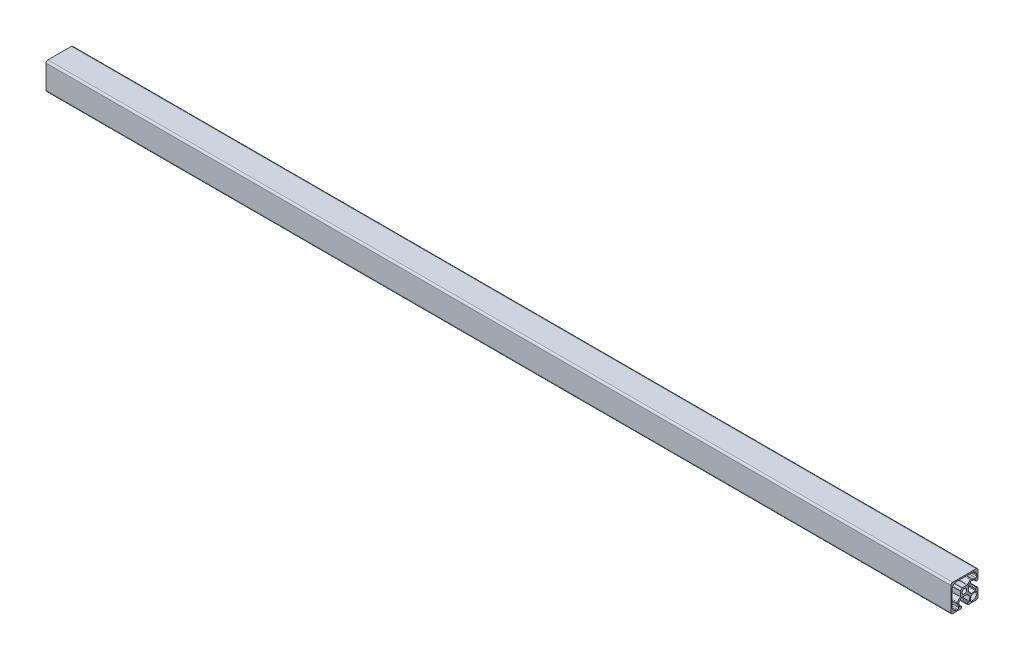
ISO-10303-21;
HEADER;
FILE_DESCRIPTION(('STEP AP214'),'2;1');
FILE_NAME('part.step','',(''),(''),'','','');
FILE_SCHEMA(('AUTOMOTIVE_DESIGN { 1 0 10303 214 1 1 1 1 }'));
ENDSEC;
DATA;
#1=APPLICATION_CONTEXT('core data for automotive mechanical design processes');
#2=APPLICATION_PROTOCOL_DEFINITION('international standard','automotive_design',2000,#1);
#3=PRODUCT_CONTEXT('',#1,'mechanical');
#4=PRODUCT('Part','Part','',(#3));
#5=PRODUCT_RELATED_PRODUCT_CATEGORY('part','',(#4));
#6=PRODUCT_DEFINITION_FORMATION('','',#4);
#7=PRODUCT_DEFINITION_CONTEXT('part definition',#1,'design');
#8=PRODUCT_DEFINITION('design','',#6,#7);
#9=PRODUCT_DEFINITION_SHAPE('','',#8);
#10=(LENGTH_UNIT() NAMED_UNIT(*) SI_UNIT(.MILLI.,.METRE.));
#11=(NAMED_UNIT(*) PLANE_ANGLE_UNIT() SI_UNIT($,.RADIAN.));
#12=(NAMED_UNIT(*) SI_UNIT($,.STERADIAN.) SOLID_ANGLE_UNIT());
#13=UNCERTAINTY_MEASURE_WITH_UNIT(LENGTH_MEASURE(1.E-05),#10,'distance_accuracy_value','');
#14=(GEOMETRIC_REPRESENTATION_CONTEXT(3) GLOBAL_UNCERTAINTY_ASSIGNED_CONTEXT((#13)) GLOBAL_UNIT_ASSIGNED_CONTEXT((#10,
#11,#12)) REPRESENTATION_CONTEXT('',''));
#15=CARTESIAN_POINT('',(0.,0.,0.));
#16=DIRECTION('',(0.,0.,1.));
#17=DIRECTION('',(1.,0.,0.));
#18=AXIS2_PLACEMENT_3D('',#15,#16,#17);
#19=CARTESIAN_POINT('',(1000.,-13.,13.));
#20=DIRECTION('',(1.,0.,0.));
#21=DIRECTION('',(0.,0.,-1.));
#22=AXIS2_PLACEMENT_3D('',#19,#20,#21);
#23=PLANE('',#22);
#24=CARTESIAN_POINT('',(1000.,0.,0.));
#25=DIRECTION('',(1.,0.,0.));
#26=DIRECTION('',(0.,0.,-1.));
#27=AXIS2_PLACEMENT_3D('',#24,#25,#26);
#28=CIRCLE('',#27,2.54999999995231);
#29=CARTESIAN_POINT('',(1000.,0.,-2.54999999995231));
#30=VERTEX_POINT('',#29);
#31=EDGE_CURVE('E659',#30,#30,#28,.T.);
#32=ORIENTED_EDGE('',*,*,#31,.F.);
#33=EDGE_LOOP('',(#32));
#34=FACE_BOUND('',#33,.T.);
#35=CARTESIAN_POINT('',(1000.,-13.,13.));
#36=DIRECTION('',(1.,0.,0.));
#37=DIRECTION('',(0.,0.,-1.));
#38=AXIS2_PLACEMENT_3D('',#35,#36,#37);
#39=CIRCLE('',#38,2.);
#40=CARTESIAN_POINT('',(1000.,-13.,15.));
#41=VERTEX_POINT('',#40);
#42=CARTESIAN_POINT('',(1000.,-15.,13.));
#43=VERTEX_POINT('',#42);
#44=EDGE_CURVE('E878',#41,#43,#39,.T.);
#45=ORIENTED_EDGE('',*,*,#44,.T.);
#46=DIRECTION('',(0.,0.,-1.));
#47=VECTOR('',#46,1.);
#48=CARTESIAN_POINT('',(1000.,-15.,13.));
#49=LINE('',#48,#47);
#50=CARTESIAN_POINT('',(1000.,-14.9999999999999,4.34999999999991));
#51=VERTEX_POINT('',#50);
#52=EDGE_CURVE('E881',#43,#51,#49,.T.);
#53=ORIENTED_EDGE('',*,*,#52,.T.);
#54=CARTESIAN_POINT('',(1000.,-13.8,4.34999999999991));
#55=DIRECTION('',(1.,0.,0.));
#56=DIRECTION('',(0.,0.,-1.));
#57=AXIS2_PLACEMENT_3D('',#54,#55,#56);
#58=CIRCLE('',#57,1.19999999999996);
#59=CARTESIAN_POINT('',(1000.,-13.8,3.15000000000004));
#60=VERTEX_POINT('',#59);
#61=EDGE_CURVE('E884',#51,#60,#58,.T.);
#62=ORIENTED_EDGE('',*,*,#61,.T.);
#63=DIRECTION('',(0.,1.,0.));
#64=VECTOR('',#63,1.);
#65=CARTESIAN_POINT('',(1000.,-13.2500251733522,3.15000000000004));
#66=LINE('',#65,#64);
#67=CARTESIAN_POINT('',(1000.,-13.2500251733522,3.15000000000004));
#68=VERTEX_POINT('',#67);
#69=EDGE_CURVE('E886',#60,#68,#66,.T.);
#70=ORIENTED_EDGE('',*,*,#69,.T.);
#71=CARTESIAN_POINT('',(1000.,-13.25,3.89999999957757));
#72=DIRECTION('',(1.,0.,0.));
#73=DIRECTION('',(0.,0.,-1.));
#74=AXIS2_PLACEMENT_3D('',#71,#72,#73);
#75=CIRCLE('',#74,0.749999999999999);
#76=CARTESIAN_POINT('',(1000.,-12.5,3.89999999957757));
#77=VERTEX_POINT('',#76);
#78=EDGE_CURVE('E888',#68,#77,#75,.T.);
#79=ORIENTED_EDGE('',*,*,#78,.T.);
#80=DIRECTION('',(0.,0.,1.));
#81=VECTOR('',#80,1.);
#82=CARTESIAN_POINT('',(1000.,-12.5,4.87484096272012));
#83=LINE('',#82,#81);
#84=CARTESIAN_POINT('',(1000.,-12.5,4.87484096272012));
#85=VERTEX_POINT('',#84);
#86=EDGE_CURVE('E890',#77,#85,#83,.T.);
#87=ORIENTED_EDGE('',*,*,#86,.T.);
#88=CARTESIAN_POINT('',(1000.,-12.,4.87484096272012));
#89=DIRECTION('',(-1.,0.,0.));
#90=DIRECTION('',(0.,0.,-1.));
#91=AXIS2_PLACEMENT_3D('',#88,#89,#90);
#92=CIRCLE('',#91,0.499999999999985);
#93=CARTESIAN_POINT('',(1000.,-12.0868240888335,5.36724483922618));
#94=VERTEX_POINT('',#93);
#95=EDGE_CURVE('E892',#85,#94,#92,.T.);
#96=ORIENTED_EDGE('',*,*,#95,.T.);
#97=DIRECTION('',(0.,0.984807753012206,0.173648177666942));
#98=VECTOR('',#97,1.);
#99=CARTESIAN_POINT('',(1000.,-8.08937119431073,6.07210363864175));
#100=LINE('',#99,#98);
#101=CARTESIAN_POINT('',(1000.,-8.08937119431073,6.07210363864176));
#102=VERTEX_POINT('',#101);
#103=EDGE_CURVE('E894',#94,#102,#100,.T.);
#104=ORIENTED_EDGE('',*,*,#103,.T.);
#105=CARTESIAN_POINT('',(1000.,-7.91572301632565,5.08729588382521));
#106=DIRECTION('',(-1.,0.,0.));
#107=DIRECTION('',(0.,0.,-1.));
#108=AXIS2_PLACEMENT_3D('',#105,#106,#107);
#109=CIRCLE('',#108,1.00000000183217);
#110=CARTESIAN_POINT('',(1000.,-7.20861623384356,5.79440266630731));
#111=VERTEX_POINT('',#110);
#112=EDGE_CURVE('E896',#102,#111,#109,.T.);
#113=ORIENTED_EDGE('',*,*,#112,.T.);
#114=DIRECTION('',(0.,0.707106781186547,-0.707106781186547));
#115=VECTOR('',#114,1.);
#116=CARTESIAN_POINT('',(1000.,-4.79289322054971,3.37867965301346));
#117=LINE('',#116,#115);
#118=CARTESIAN_POINT('',(1000.,-4.79289322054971,3.37867965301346));
#119=VERTEX_POINT('',#118);
#120=EDGE_CURVE('E898',#111,#119,#117,.T.);
#121=ORIENTED_EDGE('',*,*,#120,.T.);
#122=CARTESIAN_POINT('',(1000.,-5.50000000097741,2.67157287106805));
#123=DIRECTION('',(-1.,0.,0.));
#124=DIRECTION('',(0.,0.,-1.));
#125=AXIS2_PLACEMENT_3D('',#122,#123,#124);
#126=CIRCLE('',#125,1.);
#127=CARTESIAN_POINT('',(1000.,-4.5000000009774,2.67157287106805));
#128=VERTEX_POINT('',#127);
#129=EDGE_CURVE('E900',#119,#128,#126,.T.);
#130=ORIENTED_EDGE('',*,*,#129,.T.);
#131=DIRECTION('',(0.,0.,-1.));
#132=VECTOR('',#131,1.);
#133=CARTESIAN_POINT('',(1000.,-4.5000000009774,2.67157287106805));
#134=LINE('',#133,#132);
#135=CARTESIAN_POINT('',(1000.,-4.5000000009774,-2.67157287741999));
#136=VERTEX_POINT('',#135);
#137=EDGE_CURVE('E902',#128,#136,#134,.T.);
#138=ORIENTED_EDGE('',*,*,#137,.T.);
#139=CARTESIAN_POINT('',(1000.,-5.50000000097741,-2.67157287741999));
#140=DIRECTION('',(-1.,0.,0.));
#141=DIRECTION('',(0.,0.,-1.));
#142=AXIS2_PLACEMENT_3D('',#139,#140,#141);
#143=CIRCLE('',#142,1.00000000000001);
#144=CARTESIAN_POINT('',(1000.,-4.79289322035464,-3.37867965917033));
#145=VERTEX_POINT('',#144);
#146=EDGE_CURVE('E904',#136,#145,#143,.T.);
#147=ORIENTED_EDGE('',*,*,#146,.T.);
#148=DIRECTION('',(0.,-0.707106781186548,-0.707106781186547));
#149=VECTOR('',#148,1.);
#150=CARTESIAN_POINT('',(1000.,-4.79289322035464,-3.37867965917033));
#151=LINE('',#150,#149);
#152=CARTESIAN_POINT('',(1000.,-7.20861623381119,-5.79440267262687));
#153=VERTEX_POINT('',#152);
#154=EDGE_CURVE('E906',#145,#153,#151,.T.);
#155=ORIENTED_EDGE('',*,*,#154,.T.);
#156=CARTESIAN_POINT('',(1000.,-7.91572301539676,-5.08729588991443));
#157=DIRECTION('',(-1.,0.,0.));
#158=DIRECTION('',(0.,0.,-1.));
#159=AXIS2_PLACEMENT_3D('',#156,#157,#158);
#160=CIRCLE('',#159,1.00000000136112);
#161=CARTESIAN_POINT('',(1000.,-8.08937119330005,-6.07210364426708));
#162=VERTEX_POINT('',#161);
#163=EDGE_CURVE('E908',#153,#162,#160,.T.);
#164=ORIENTED_EDGE('',*,*,#163,.T.);
#165=DIRECTION('',(0.,-0.984807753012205,0.173648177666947));
#166=VECTOR('',#165,1.);
#167=CARTESIAN_POINT('',(1000.,-8.08937119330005,-6.07210364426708));
#168=LINE('',#167,#166);
#169=CARTESIAN_POINT('',(1000.,-12.0868240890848,-5.36724484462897));
#170=VERTEX_POINT('',#169);
#171=EDGE_CURVE('E910',#162,#170,#168,.T.);
#172=ORIENTED_EDGE('',*,*,#171,.T.);
#173=CARTESIAN_POINT('',(1000.,-12.0000000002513,-4.87484096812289));
#174=DIRECTION('',(-1.,0.,0.));
#175=DIRECTION('',(0.,0.,-1.));
#176=AXIS2_PLACEMENT_3D('',#173,#174,#175);
#177=CIRCLE('',#176,0.499999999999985);
#178=CARTESIAN_POINT('',(1000.,-12.5000000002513,-4.87484096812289));
#179=VERTEX_POINT('',#178);
#180=EDGE_CURVE('E912',#170,#179,#177,.T.);
#181=ORIENTED_EDGE('',*,*,#180,.T.);
#182=DIRECTION('',(0.,0.,1.));
#183=VECTOR('',#182,1.);
#184=CARTESIAN_POINT('',(1000.,-12.5000000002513,-4.87484096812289));
#185=LINE('',#184,#183);
#186=CARTESIAN_POINT('',(1000.,-12.5000000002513,-3.90000000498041));
#187=VERTEX_POINT('',#186);
#188=EDGE_CURVE('E914',#179,#187,#185,.T.);
#189=ORIENTED_EDGE('',*,*,#188,.T.);
#190=CARTESIAN_POINT('',(1000.,-13.2500000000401,-3.90000000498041));
#191=DIRECTION('',(1.,0.,0.));
#192=DIRECTION('',(0.,0.,-1.));
#193=AXIS2_PLACEMENT_3D('',#190,#191,#192);
#194=CIRCLE('',#193,0.749999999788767);
#195=CARTESIAN_POINT('',(1000.,-13.2500000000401,-3.15000000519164));
#196=VERTEX_POINT('',#195);
#197=EDGE_CURVE('E916',#187,#196,#194,.T.);
#198=ORIENTED_EDGE('',*,*,#197,.T.);
#199=DIRECTION('',(0.,-1.,0.));
#200=VECTOR('',#199,1.);
#201=CARTESIAN_POINT('',(1000.,-13.2500000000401,-3.15000000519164));
#202=LINE('',#201,#200);
#203=CARTESIAN_POINT('',(1000.,-13.8000000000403,-3.15000000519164));
#204=VERTEX_POINT('',#203);
#205=EDGE_CURVE('E918',#196,#204,#202,.T.);
#206=ORIENTED_EDGE('',*,*,#205,.T.);
#207=CARTESIAN_POINT('',(1000.,-13.8000000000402,-4.35000000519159));
#208=DIRECTION('',(1.,0.,0.));
#209=DIRECTION('',(0.,0.,-1.));
#210=AXIS2_PLACEMENT_3D('',#207,#208,#209);
#211=CIRCLE('',#210,1.19999999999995);
#212=CARTESIAN_POINT('',(1000.,-15.0000000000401,-4.35000000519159));
#213=VERTEX_POINT('',#212);
#214=EDGE_CURVE('E920',#204,#213,#211,.T.);
#215=ORIENTED_EDGE('',*,*,#214,.T.);
#216=DIRECTION('',(0.,0.,-1.));
#217=VECTOR('',#216,1.);
#218=CARTESIAN_POINT('',(1000.,-15.0000000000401,-13.0000000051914));
#219=LINE('',#218,#217);
#220=CARTESIAN_POINT('',(1000.,-15.0000000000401,-13.0000000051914));
#221=VERTEX_POINT('',#220);
#222=EDGE_CURVE('E922',#213,#221,#219,.T.);
#223=ORIENTED_EDGE('',*,*,#222,.T.);
#224=CARTESIAN_POINT('',(1000.,-13.0000000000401,-13.0000000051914));
#225=DIRECTION('',(1.,0.,0.));
#226=DIRECTION('',(0.,0.,-1.));
#227=AXIS2_PLACEMENT_3D('',#224,#225,#226);
#228=CIRCLE('',#227,2.);
#229=CARTESIAN_POINT('',(1000.,-13.0000000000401,-15.0000000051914));
#230=VERTEX_POINT('',#229);
#231=EDGE_CURVE('E924',#221,#230,#228,.T.);
#232=ORIENTED_EDGE('',*,*,#231,.T.);
#233=DIRECTION('',(0.,1.,0.));
#234=VECTOR('',#233,1.);
#235=CARTESIAN_POINT('',(1000.,-13.0000000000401,-15.0000000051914));
#236=LINE('',#235,#234);
#237=CARTESIAN_POINT('',(1000.,-4.34999999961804,-15.0000000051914));
#238=VERTEX_POINT('',#237);
#239=EDGE_CURVE('E926',#230,#238,#236,.T.);
#240=ORIENTED_EDGE('',*,*,#239,.T.);
#241=CARTESIAN_POINT('',(1000.,-4.34999999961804,-13.8000000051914));
#242=DIRECTION('',(1.,0.,0.));
#243=DIRECTION('',(0.,0.,-1.));
#244=AXIS2_PLACEMENT_3D('',#241,#242,#243);
#245=CIRCLE('',#244,1.20000000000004);
#246=CARTESIAN_POINT('',(1000.,-3.149999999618,-13.8000000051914));
#247=VERTEX_POINT('',#246);
#248=EDGE_CURVE('E928',#238,#247,#245,.T.);
#249=ORIENTED_EDGE('',*,*,#248,.T.);
#250=DIRECTION('',(0.,0.,1.));
#251=VECTOR('',#250,1.);
#252=CARTESIAN_POINT('',(1000.,-3.149999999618,-13.8000000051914));
#253=LINE('',#252,#251);
#254=CARTESIAN_POINT('',(1000.,-3.149999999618,-13.2500000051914));
#255=VERTEX_POINT('',#254);
#256=EDGE_CURVE('E930',#247,#255,#253,.T.);
#257=ORIENTED_EDGE('',*,*,#256,.T.);
#258=CARTESIAN_POINT('',(1000.,-3.89999999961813,-13.2500000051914));
#259=DIRECTION('',(1.,0.,0.));
#260=DIRECTION('',(0.,0.,-1.));
#261=AXIS2_PLACEMENT_3D('',#258,#259,#260);
#262=CIRCLE('',#261,0.750000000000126);
#263=CARTESIAN_POINT('',(1000.,-3.89999999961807,-12.5000000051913));
#264=VERTEX_POINT('',#263);
#265=EDGE_CURVE('E932',#255,#264,#262,.T.);
#266=ORIENTED_EDGE('',*,*,#265,.T.);
#267=DIRECTION('',(0.,-1.,0.));
#268=VECTOR('',#267,1.);
#269=CARTESIAN_POINT('',(1000.,-3.89999999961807,-12.5000000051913));
#270=LINE('',#269,#268);
#271=CARTESIAN_POINT('',(1000.,-4.87484096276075,-12.5000000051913));
#272=VERTEX_POINT('',#271);
#273=EDGE_CURVE('E934',#264,#272,#270,.T.);
#274=ORIENTED_EDGE('',*,*,#273,.T.);
#275=CARTESIAN_POINT('',(1000.,-4.87484096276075,-12.0000000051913));
#276=DIRECTION('',(-1.,0.,0.));
#277=DIRECTION('',(0.,0.,-1.));
#278=AXIS2_PLACEMENT_3D('',#275,#276,#277);
#279=CIRCLE('',#278,0.5);
#280=CARTESIAN_POINT('',(1000.,-5.36724483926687,-12.0868240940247));
#281=VERTEX_POINT('',#280);
#282=EDGE_CURVE('E936',#272,#281,#279,.T.);
#283=ORIENTED_EDGE('',*,*,#282,.T.);
#284=DIRECTION('',(0.,-0.173648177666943,0.984807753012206));
#285=VECTOR('',#284,1.);
#286=CARTESIAN_POINT('',(1000.,-6.07210364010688,-8.08937119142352));
#287=LINE('',#286,#285);
#288=CARTESIAN_POINT('',(1000.,-6.07210364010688,-8.08937119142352));
#289=VERTEX_POINT('',#288);
#290=EDGE_CURVE('E938',#281,#289,#287,.T.);
#291=ORIENTED_EDGE('',*,*,#290,.T.);
#292=CARTESIAN_POINT('',(1000.,-5.08729588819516,-7.9157230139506));
#293=DIRECTION('',(-1.,0.,0.));
#294=DIRECTION('',(0.,0.,-1.));
#295=AXIS2_PLACEMENT_3D('',#292,#293,#294);
#296=CIRCLE('',#295,0.999999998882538);
#297=CARTESIAN_POINT('',(1000.,-5.79440266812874,-7.20861623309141));
#298=VERTEX_POINT('',#297);
#299=EDGE_CURVE('E940',#289,#298,#296,.T.);
#300=ORIENTED_EDGE('',*,*,#299,.T.);
#301=DIRECTION('',(0.,0.707106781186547,0.707106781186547));
#302=VECTOR('',#301,1.);
#303=CARTESIAN_POINT('',(1000.,-3.37867965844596,-4.79289322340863));
#304=LINE('',#303,#302);
#305=CARTESIAN_POINT('',(1000.,-3.37867965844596,-4.79289322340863));
#306=VERTEX_POINT('',#305);
#307=EDGE_CURVE('E942',#298,#306,#304,.T.);
#308=ORIENTED_EDGE('',*,*,#307,.T.);
#309=CARTESIAN_POINT('',(1000.,-2.67157287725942,-5.50000000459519));
#310=DIRECTION('',(-1.,0.,0.));
#311=DIRECTION('',(0.,0.,-1.));
#312=AXIS2_PLACEMENT_3D('',#309,#310,#311);
#313=CIRCLE('',#312,1.00000000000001);
#314=CARTESIAN_POINT('',(1000.,-2.67157287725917,-4.50000000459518));
#315=VERTEX_POINT('',#314);
#316=EDGE_CURVE('E944',#306,#315,#313,.T.);
#317=ORIENTED_EDGE('',*,*,#316,.T.);
#318=DIRECTION('',(0.,1.,0.));
#319=VECTOR('',#318,1.);
#320=CARTESIAN_POINT('',(1000.,-2.67157287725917,-4.50000000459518));
#321=LINE('',#320,#319);
#322=CARTESIAN_POINT('',(1000.,2.67157287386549,-4.50000000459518));
#323=VERTEX_POINT('',#322);
#324=EDGE_CURVE('E946',#315,#323,#321,.T.);
#325=ORIENTED_EDGE('',*,*,#324,.T.);
#326=CARTESIAN_POINT('',(1000.,2.67157287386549,-5.50000000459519));
#327=DIRECTION('',(-1.,0.,0.));
#328=DIRECTION('',(0.,0.,-1.));
#329=AXIS2_PLACEMENT_3D('',#326,#327,#328);
#330=CIRCLE('',#329,1.00000000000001);
#331=CARTESIAN_POINT('',(1000.,3.37867965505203,-4.79289322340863));
#332=VERTEX_POINT('',#331);
#333=EDGE_CURVE('E948',#323,#332,#330,.T.);
#334=ORIENTED_EDGE('',*,*,#333,.T.);
#335=DIRECTION('',(0.,0.707106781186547,-0.707106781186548));
#336=VECTOR('',#335,1.);
#337=CARTESIAN_POINT('',(1000.,3.37867965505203,-4.79289322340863));
#338=LINE('',#337,#336);
#339=CARTESIAN_POINT('',(1000.,5.79440266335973,-7.20861623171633));
#340=VERTEX_POINT('',#339);
#341=EDGE_CURVE('E950',#332,#340,#338,.T.);
#342=ORIENTED_EDGE('',*,*,#341,.T.);
#343=CARTESIAN_POINT('',(1000.,5.08729588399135,-7.9157230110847));
#344=DIRECTION('',(-1.,0.,0.));
#345=DIRECTION('',(0.,0.,-1.));
#346=AXIS2_PLACEMENT_3D('',#343,#344,#345);
#347=CIRCLE('',#346,0.999999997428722);
#348=CARTESIAN_POINT('',(1000.,6.07210363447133,-8.08937118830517));
#349=VERTEX_POINT('',#348);
#350=EDGE_CURVE('E952',#340,#349,#347,.T.);
#351=ORIENTED_EDGE('',*,*,#350,.T.);
#352=DIRECTION('',(0.,-0.173648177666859,-0.98480775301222));
#353=VECTOR('',#352,1.);
#354=CARTESIAN_POINT('',(1000.,6.07210363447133,-8.08937118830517));
#355=LINE('',#354,#353);
#356=CARTESIAN_POINT('',(1000.,5.36724483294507,-12.0868240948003));
#357=VERTEX_POINT('',#356);
#358=EDGE_CURVE('E954',#349,#357,#355,.T.);
#359=ORIENTED_EDGE('',*,*,#358,.T.);
#360=CARTESIAN_POINT('',(1000.,4.87484095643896,-12.0000000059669));
#361=DIRECTION('',(-1.,0.,0.));
#362=DIRECTION('',(0.,0.,-1.));
#363=AXIS2_PLACEMENT_3D('',#360,#361,#362);
#364=CIRCLE('',#363,0.499999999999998);
#365=CARTESIAN_POINT('',(1000.,4.87484095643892,-12.5000000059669));
#366=VERTEX_POINT('',#365);
#367=EDGE_CURVE('E956',#357,#366,#364,.T.);
#368=ORIENTED_EDGE('',*,*,#367,.T.);
#369=DIRECTION('',(0.,-1.,0.));
#370=VECTOR('',#369,1.);
#371=CARTESIAN_POINT('',(1000.,3.89999999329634,-12.5000000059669));
#372=LINE('',#371,#370);
#373=CARTESIAN_POINT('',(1000.,3.89999999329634,-12.5000000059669));
#374=VERTEX_POINT('',#373);
#375=EDGE_CURVE('E958',#366,#374,#372,.T.);
#376=ORIENTED_EDGE('',*,*,#375,.T.);
#377=CARTESIAN_POINT('',(1000.,3.89999999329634,-13.250000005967));
#378=DIRECTION('',(1.,0.,0.));
#379=DIRECTION('',(0.,0.,-1.));
#380=AXIS2_PLACEMENT_3D('',#377,#378,#379);
#381=CIRCLE('',#380,0.750000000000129);
#382=CARTESIAN_POINT('',(1000.,3.14999999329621,-13.250000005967));
#383=VERTEX_POINT('',#382);
#384=EDGE_CURVE('E960',#374,#383,#381,.T.);
#385=ORIENTED_EDGE('',*,*,#384,.T.);
#386=DIRECTION('',(0.,0.,-1.));
#387=VECTOR('',#386,1.);
#388=CARTESIAN_POINT('',(1000.,3.14999999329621,-13.800000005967));
#389=LINE('',#388,#387);
#390=CARTESIAN_POINT('',(1000.,3.1499999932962,-13.800000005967));
#391=VERTEX_POINT('',#390);
#392=EDGE_CURVE('E962',#383,#391,#389,.T.);
#393=ORIENTED_EDGE('',*,*,#392,.T.);
#394=CARTESIAN_POINT('',(1000.,4.34999999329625,-13.7999999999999));
#395=DIRECTION('',(1.,0.,0.));
#396=DIRECTION('',(0.,0.,-1.));
#397=AXIS2_PLACEMENT_3D('',#394,#395,#396);
#398=CIRCLE('',#397,1.20000000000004);
#399=CARTESIAN_POINT('',(1000.,4.34999999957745,-14.9999999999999));
#400=VERTEX_POINT('',#399);
#401=EDGE_CURVE('E964',#391,#400,#398,.T.);
#402=ORIENTED_EDGE('',*,*,#401,.T.);
#403=DIRECTION('',(0.,1.,0.));
#404=VECTOR('',#403,1.);
#405=CARTESIAN_POINT('',(1000.,13.,-14.9999999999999));
#406=LINE('',#405,#404);
#407=CARTESIAN_POINT('',(1000.,13.,-14.9999999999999));
#408=VERTEX_POINT('',#407);
#409=EDGE_CURVE('E966',#400,#408,#406,.T.);
#410=ORIENTED_EDGE('',*,*,#409,.T.);
#411=CARTESIAN_POINT('',(1000.,13.,-12.9999999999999));
#412=DIRECTION('',(1.,0.,0.));
#413=DIRECTION('',(0.,0.,-1.));
#414=AXIS2_PLACEMENT_3D('',#411,#412,#413);
#415=CIRCLE('',#414,1.99999999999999);
#416=CARTESIAN_POINT('',(1000.,15.,-12.9999999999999));
#417=VERTEX_POINT('',#416);
#418=EDGE_CURVE('E968',#408,#417,#415,.T.);
#419=ORIENTED_EDGE('',*,*,#418,.T.);
#420=DIRECTION('',(0.,0.,1.));
#421=VECTOR('',#420,1.);
#422=CARTESIAN_POINT('',(1000.,15.,13.));
#423=LINE('',#422,#421);
#424=CARTESIAN_POINT('',(1000.,15.,13.));
#425=VERTEX_POINT('',#424);
#426=EDGE_CURVE('E970',#417,#425,#423,.T.);
#427=ORIENTED_EDGE('',*,*,#426,.T.);
#428=CARTESIAN_POINT('',(1000.,13.,13.));
#429=DIRECTION('',(1.,0.,0.));
#430=DIRECTION('',(0.,0.,-1.));
#431=AXIS2_PLACEMENT_3D('',#428,#429,#430);
#432=CIRCLE('',#431,1.99999999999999);
#433=CARTESIAN_POINT('',(1000.,13.,15.));
#434=VERTEX_POINT('',#433);
#435=EDGE_CURVE('E972',#425,#434,#432,.T.);
#436=ORIENTED_EDGE('',*,*,#435,.T.);
#437=DIRECTION('',(0.,-1.,0.));
#438=VECTOR('',#437,1.);
#439=CARTESIAN_POINT('',(1000.,-13.,15.));
#440=LINE('',#439,#438);
#441=EDGE_CURVE('E974',#434,#41,#440,.T.);
#442=ORIENTED_EDGE('',*,*,#441,.T.);
#443=EDGE_LOOP('',(#45,#53,#62,#70,#79,#87,#96,#104,#113,#121,#130,#138,#147,#155,#164,#172,
#181,#189,#198,#206,#215,#223,#232,#240,#249,#257,#266,#274,#283,#291,#300,#308,#317,#325,#334,
#342,#351,#359,#368,#376,#385,#393,#402,#410,#419,#427,#436,#442));
#444=FACE_BOUND('',#443,.T.);
#445=CARTESIAN_POINT('',(1000.,-7.76000000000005,7.75999999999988));
#446=DIRECTION('',(1.,0.,0.));
#447=DIRECTION('',(0.,0.,-1.));
#448=AXIS2_PLACEMENT_3D('',#445,#446,#447);
#449=CIRCLE('',#448,6.07000000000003);
#450=CARTESIAN_POINT('',(1000.,-9.91413146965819,13.4349112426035));
#451=VERTEX_POINT('',#450);
#452=CARTESIAN_POINT('',(1000.,-13.674358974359,9.1257444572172));
#453=VERTEX_POINT('',#452);
#454=EDGE_CURVE('E667',#451,#453,#449,.T.);
#455=ORIENTED_EDGE('',*,*,#454,.F.);
#456=CARTESIAN_POINT('',(1000.,-9.55924984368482,12.5));
#457=DIRECTION('',(1.,0.,0.));
#458=DIRECTION('',(0.,0.,-1.));
#459=AXIS2_PLACEMENT_3D('',#456,#457,#458);
#460=CIRCLE('',#459,0.999999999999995);
#461=CARTESIAN_POINT('',(1000.,-9.55924984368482,13.5));
#462=VERTEX_POINT('',#461);
#463=EDGE_CURVE('E665',#462,#451,#460,.T.);
#464=ORIENTED_EDGE('',*,*,#463,.F.);
#465=DIRECTION('',(0.,-1.,0.));
#466=VECTOR('',#465,1.);
#467=CARTESIAN_POINT('',(1000.,-9.55924984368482,13.5));
#468=LINE('',#467,#466);
#469=CARTESIAN_POINT('',(1000.,9.55924984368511,13.5));
#470=VERTEX_POINT('',#469);
#471=EDGE_CURVE('E725',#470,#462,#468,.T.);
#472=ORIENTED_EDGE('',*,*,#471,.F.);
#473=CARTESIAN_POINT('',(1000.,9.55924984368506,12.5));
#474=DIRECTION('',(1.,0.,0.));
#475=DIRECTION('',(0.,0.,-1.));
#476=AXIS2_PLACEMENT_3D('',#473,#474,#475);
#477=CIRCLE('',#476,1.);
#478=CARTESIAN_POINT('',(1000.,9.91413146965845,13.4349112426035));
#479=VERTEX_POINT('',#478);
#480=EDGE_CURVE('E722',#479,#470,#477,.T.);
#481=ORIENTED_EDGE('',*,*,#480,.F.);
#482=CARTESIAN_POINT('',(1000.,7.75999999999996,7.76000000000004));
#483=DIRECTION('',(1.,0.,0.));
#484=DIRECTION('',(0.,0.,-1.));
#485=AXIS2_PLACEMENT_3D('',#482,#483,#484);
#486=CIRCLE('',#485,6.07);
#487=CARTESIAN_POINT('',(1000.,13.4349112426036,9.91413146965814));
#488=VERTEX_POINT('',#487);
#489=EDGE_CURVE('E720',#488,#479,#486,.T.);
#490=ORIENTED_EDGE('',*,*,#489,.F.);
#491=CARTESIAN_POINT('',(1000.,12.5,9.55924984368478));
#492=DIRECTION('',(1.,0.,0.));
#493=DIRECTION('',(0.,0.,-1.));
#494=AXIS2_PLACEMENT_3D('',#491,#492,#493);
#495=CIRCLE('',#494,1.);
#496=CARTESIAN_POINT('',(1000.,13.5,9.55924984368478));
#497=VERTEX_POINT('',#496);
#498=EDGE_CURVE('E718',#497,#488,#495,.T.);
#499=ORIENTED_EDGE('',*,*,#498,.F.);
#500=DIRECTION('',(0.,0.,1.));
#501=VECTOR('',#500,1.);
#502=CARTESIAN_POINT('',(1000.,13.5,9.55924984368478));
#503=LINE('',#502,#501);
#504=CARTESIAN_POINT('',(1000.,13.5,-9.55924984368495));
#505=VERTEX_POINT('',#504);
#506=EDGE_CURVE('E716',#505,#497,#503,.T.);
#507=ORIENTED_EDGE('',*,*,#506,.F.);
#508=CARTESIAN_POINT('',(1000.,12.5,-9.55924984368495));
#509=DIRECTION('',(1.,0.,0.));
#510=DIRECTION('',(0.,0.,-1.));
#511=AXIS2_PLACEMENT_3D('',#508,#509,#510);
#512=CIRCLE('',#511,1.);
#513=CARTESIAN_POINT('',(1000.,13.4349112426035,-9.91413146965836));
#514=VERTEX_POINT('',#513);
#515=EDGE_CURVE('E714',#514,#505,#512,.T.);
#516=ORIENTED_EDGE('',*,*,#515,.F.);
#517=CARTESIAN_POINT('',(1000.,7.76000000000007,-7.75999999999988));
#518=DIRECTION('',(1.,0.,0.));
#519=DIRECTION('',(0.,0.,-1.));
#520=AXIS2_PLACEMENT_3D('',#517,#518,#519);
#521=CIRCLE('',#520,6.07000000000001);
#522=CARTESIAN_POINT('',(1000.,9.12574445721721,-13.6743589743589));
#523=VERTEX_POINT('',#522);
#524=EDGE_CURVE('E712',#523,#514,#521,.T.);
#525=ORIENTED_EDGE('',*,*,#524,.F.);
#526=CARTESIAN_POINT('',(1000.,8.90074537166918,-12.6999999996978));
#527=DIRECTION('',(1.,0.,0.));
#528=DIRECTION('',(0.,0.,-1.));
#529=AXIS2_PLACEMENT_3D('',#526,#527,#528);
#530=CIRCLE('',#529,0.99999999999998);
#531=CARTESIAN_POINT('',(1000.,8.90074536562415,-13.6999999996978));
#532=VERTEX_POINT('',#531);
#533=EDGE_CURVE('E710',#532,#523,#530,.T.);
#534=ORIENTED_EDGE('',*,*,#533,.F.);
#535=DIRECTION('',(0.,1.,0.));
#536=VECTOR('',#535,1.);
#537=CARTESIAN_POINT('',(1000.,8.90074536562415,-13.6999999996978));
#538=LINE('',#537,#536);
#539=CARTESIAN_POINT('',(1000.,7.49306392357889,-13.6999999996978));
#540=VERTEX_POINT('',#539);
#541=EDGE_CURVE('E708',#540,#532,#538,.T.);
#542=ORIENTED_EDGE('',*,*,#541,.F.);
#543=CARTESIAN_POINT('',(1000.,7.49306392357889,-12.6999999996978));
#544=DIRECTION('',(1.,0.,0.));
#545=DIRECTION('',(0.,0.,-1.));
#546=AXIS2_PLACEMENT_3D('',#543,#544,#545);
#547=CIRCLE('',#546,0.999999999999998);
#548=CARTESIAN_POINT('',(1000.,6.50825617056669,-12.5263518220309));
#549=VERTEX_POINT('',#548);
#550=EDGE_CURVE('E706',#549,#540,#547,.T.);
#551=ORIENTED_EDGE('',*,*,#550,.F.);
#552=DIRECTION('',(0.,-0.173648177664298,-0.984807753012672));
#553=VECTOR('',#552,1.);
#554=CARTESIAN_POINT('',(1000.,7.0455767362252,-9.47905546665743));
#555=LINE('',#554,#553);
#556=CARTESIAN_POINT('',(1000.,7.0455767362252,-9.47905546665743));
#557=VERTEX_POINT('',#556);
#558=EDGE_CURVE('E704',#557,#549,#555,.T.);
#559=ORIENTED_EDGE('',*,*,#558,.F.);
#560=CARTESIAN_POINT('',(1000.,9.99999999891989,-10.0000000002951));
#561=DIRECTION('',(1.,0.,0.));
#562=DIRECTION('',(0.,0.,-1.));
#563=AXIS2_PLACEMENT_3D('',#560,#561,#562);
#564=CIRCLE('',#563,3.00000000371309);
#565=CARTESIAN_POINT('',(1000.,7.87867965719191,-7.87867964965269));
#566=VERTEX_POINT('',#565);
#567=EDGE_CURVE('E702',#566,#557,#564,.T.);
#568=ORIENTED_EDGE('',*,*,#567,.F.);
#569=CARTESIAN_POINT('',(1000.,7.17157288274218,-7.17157287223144));
#570=DIRECTION('',(-1.,0.,0.));
#571=DIRECTION('',(0.,0.,-1.));
#572=AXIS2_PLACEMENT_3D('',#569,#570,#571);
#573=CIRCLE('',#572,0.999999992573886);
#574=CARTESIAN_POINT('',(1000.,7.8786796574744,-6.46446609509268));
#575=VERTEX_POINT('',#574);
#576=EDGE_CURVE('E700',#575,#566,#573,.T.);
#577=ORIENTED_EDGE('',*,*,#576,.F.);
#578=DIRECTION('',(0.,0.707106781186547,-0.707106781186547));
#579=VECTOR('',#578,1.);
#580=CARTESIAN_POINT('',(1000.,4.79289322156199,-3.37867965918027));
#581=LINE('',#580,#579);
#582=CARTESIAN_POINT('',(1000.,4.79289322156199,-3.37867965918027));
#583=VERTEX_POINT('',#582);
#584=EDGE_CURVE('E698',#583,#575,#581,.T.);
#585=ORIENTED_EDGE('',*,*,#584,.F.);
#586=CARTESIAN_POINT('',(1000.,5.50000000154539,-2.67157287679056));
#587=DIRECTION('',(1.,0.,0.));
#588=DIRECTION('',(0.,0.,-1.));
#589=AXIS2_PLACEMENT_3D('',#586,#587,#588);
#590=CIRCLE('',#589,1.00000000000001);
#591=CARTESIAN_POINT('',(1000.,4.50000000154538,-2.67157287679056));
#592=VERTEX_POINT('',#591);
#593=EDGE_CURVE('E696',#592,#583,#590,.T.);
#594=ORIENTED_EDGE('',*,*,#593,.F.);
#595=DIRECTION('',(0.,0.,-1.));
#596=VECTOR('',#595,1.);
#597=CARTESIAN_POINT('',(1000.,4.50000000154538,2.08578643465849));
#598=LINE('',#597,#596);
#599=CARTESIAN_POINT('',(1000.,4.50000000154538,2.08578643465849));
#600=VERTEX_POINT('',#599);
#601=EDGE_CURVE('E694',#600,#592,#598,.T.);
#602=ORIENTED_EDGE('',*,*,#601,.F.);
#603=CARTESIAN_POINT('',(1000.,3.50000000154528,2.0857864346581));
#604=DIRECTION('',(-1.,0.,0.));
#605=DIRECTION('',(0.,0.,-1.));
#606=AXIS2_PLACEMENT_3D('',#603,#604,#605);
#607=CIRCLE('',#606,1.0000000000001);
#608=CARTESIAN_POINT('',(1000.,4.2071067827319,2.79289321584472));
#609=VERTEX_POINT('',#608);
#610=EDGE_CURVE('E692',#609,#600,#607,.T.);
#611=ORIENTED_EDGE('',*,*,#610,.F.);
#612=DIRECTION('',(0.,0.707106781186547,-0.707106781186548));
#613=VECTOR('',#612,1.);
#614=CARTESIAN_POINT('',(1000.,2.79289322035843,4.20710677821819));
#615=LINE('',#614,#613);
#616=CARTESIAN_POINT('',(1000.,2.79289322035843,4.20710677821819));
#617=VERTEX_POINT('',#616);
#618=EDGE_CURVE('E690',#617,#609,#615,.T.);
#619=ORIENTED_EDGE('',*,*,#618,.F.);
#620=CARTESIAN_POINT('',(1000.,2.08578643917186,3.49999999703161));
#621=DIRECTION('',(-1.,0.,0.));
#622=DIRECTION('',(0.,0.,-1.));
#623=AXIS2_PLACEMENT_3D('',#620,#621,#622);
#624=CIRCLE('',#623,1.00000000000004);
#625=CARTESIAN_POINT('',(1000.,2.08578643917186,4.49999999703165));
#626=VERTEX_POINT('',#625);
#627=EDGE_CURVE('E688',#626,#617,#624,.T.);
#628=ORIENTED_EDGE('',*,*,#627,.F.);
#629=DIRECTION('',(0.,1.,0.));
#630=VECTOR('',#629,1.);
#631=CARTESIAN_POINT('',(1000.,-2.67157287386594,4.49999999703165));
#632=LINE('',#631,#630);
#633=CARTESIAN_POINT('',(1000.,-2.67157287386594,4.49999999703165));
#634=VERTEX_POINT('',#633);
#635=EDGE_CURVE('E686',#634,#626,#632,.T.);
#636=ORIENTED_EDGE('',*,*,#635,.F.);
#637=CARTESIAN_POINT('',(1000.,-2.67157287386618,5.49999999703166));
#638=DIRECTION('',(1.,0.,0.));
#639=DIRECTION('',(0.,0.,-1.));
#640=AXIS2_PLACEMENT_3D('',#637,#638,#639);
#641=CIRCLE('',#640,1.00000000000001);
#642=CARTESIAN_POINT('',(1000.,-3.37867965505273,4.79289321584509));
#643=VERTEX_POINT('',#642);
#644=EDGE_CURVE('E684',#643,#634,#641,.T.);
#645=ORIENTED_EDGE('',*,*,#644,.F.);
#646=DIRECTION('',(0.,0.707106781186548,-0.707106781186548));
#647=VECTOR('',#646,1.);
#648=CARTESIAN_POINT('',(1000.,-3.37867965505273,4.79289321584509));
#649=LINE('',#648,#647);
#650=CARTESIAN_POINT('',(1000.,-6.46446609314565,7.87867965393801));
#651=VERTEX_POINT('',#650);
#652=EDGE_CURVE('E682',#651,#643,#649,.T.);
#653=ORIENTED_EDGE('',*,*,#652,.F.);
#654=CARTESIAN_POINT('',(1000.,-7.17157287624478,7.17157286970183));
#655=DIRECTION('',(-1.,0.,0.));
#656=DIRECTION('',(0.,0.,-1.));
#657=AXIS2_PLACEMENT_3D('',#654,#655,#656);
#658=CIRCLE('',#657,1.00000000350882);
#659=CARTESIAN_POINT('',(1000.,-7.87867965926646,7.87867965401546));
#660=VERTEX_POINT('',#659);
#661=EDGE_CURVE('E680',#660,#651,#658,.T.);
#662=ORIENTED_EDGE('',*,*,#661,.F.);
#663=CARTESIAN_POINT('',(1000.,-9.99999999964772,9.99999999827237));
#664=DIRECTION('',(1.,0.,0.));
#665=DIRECTION('',(0.,0.,-1.));
#666=AXIS2_PLACEMENT_3D('',#663,#664,#665);
#667=CIRCLE('',#666,2.99999999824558);
#668=CARTESIAN_POINT('',(1000.,-9.47905546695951,7.04557674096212));
#669=VERTEX_POINT('',#668);
#670=EDGE_CURVE('E678',#669,#660,#667,.T.);
#671=ORIENTED_EDGE('',*,*,#670,.F.);
#672=DIRECTION('',(0.,0.984807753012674,0.173648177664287));
#673=VECTOR('',#672,1.);
#674=CARTESIAN_POINT('',(1000.,-9.47905546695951,7.04557674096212));
#675=LINE('',#674,#673);
#676=CARTESIAN_POINT('',(1000.,-12.5263518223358,6.50825617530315));
#677=VERTEX_POINT('',#676);
#678=EDGE_CURVE('E676',#677,#669,#675,.T.);
#679=ORIENTED_EDGE('',*,*,#678,.F.);
#680=CARTESIAN_POINT('',(1000.,-12.7,7.49306392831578));
#681=DIRECTION('',(1.,0.,0.));
#682=DIRECTION('',(0.,0.,-1.));
#683=AXIS2_PLACEMENT_3D('',#680,#681,#682);
#684=CIRCLE('',#683,0.999999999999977);
#685=CARTESIAN_POINT('',(1000.,-13.7,7.49306392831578));
#686=VERTEX_POINT('',#685);
#687=EDGE_CURVE('E674',#686,#677,#684,.T.);
#688=ORIENTED_EDGE('',*,*,#687,.F.);
#689=DIRECTION('',(0.,0.,-1.));
#690=VECTOR('',#689,1.);
#691=CARTESIAN_POINT('',(1000.,-13.7,8.90074537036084));
#692=LINE('',#691,#690);
#693=CARTESIAN_POINT('',(1000.,-13.7,8.90074537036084));
#694=VERTEX_POINT('',#693);
#695=EDGE_CURVE('E672',#694,#686,#692,.T.);
#696=ORIENTED_EDGE('',*,*,#695,.F.);
#697=CARTESIAN_POINT('',(1000.,-12.7000000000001,8.90074537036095));
#698=DIRECTION('',(1.,0.,0.));
#699=DIRECTION('',(0.,0.,-1.));
#700=AXIS2_PLACEMENT_3D('',#697,#698,#699);
#701=CIRCLE('',#700,1.00000000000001);
#702=EDGE_CURVE('E670',#453,#694,#701,.T.);
#703=ORIENTED_EDGE('',*,*,#702,.F.);
#704=EDGE_LOOP('',(#455,#464,#472,#481,#490,#499,#507,#516,#525,#534,#542,#551,#559,#568,#577,
#585,#594,#602,#611,#619,#628,#636,#645,#653,#662,#671,#679,#688,#696,#703));
#705=FACE_BOUND('',#704,.T.);
#706=CARTESIAN_POINT('',(1000.,-7.76000000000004,-7.75999999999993));
#707=DIRECTION('',(1.,0.,0.));
#708=DIRECTION('',(0.,0.,-1.));
#709=AXIS2_PLACEMENT_3D('',#706,#707,#708);
#710=CIRCLE('',#709,6.06999999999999);
#711=CARTESIAN_POINT('',(1000.,-13.674358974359,-9.12574445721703));
#712=VERTEX_POINT('',#711);
#713=CARTESIAN_POINT('',(1000.,-9.12574445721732,-13.6743589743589));
#714=VERTEX_POINT('',#713);
#715=EDGE_CURVE('E588',#712,#714,#710,.T.);
#716=ORIENTED_EDGE('',*,*,#715,.F.);
#717=CARTESIAN_POINT('',(1000.,-12.7000000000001,-8.90074537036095));
#718=DIRECTION('',(1.,0.,0.));
#719=DIRECTION('',(0.,0.,-1.));
#720=AXIS2_PLACEMENT_3D('',#717,#718,#719);
#721=CIRCLE('',#720,0.999999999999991);
#722=CARTESIAN_POINT('',(1000.,-13.7,-8.90074537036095));
#723=VERTEX_POINT('',#722);
#724=EDGE_CURVE('E580',#723,#712,#721,.T.);
#725=ORIENTED_EDGE('',*,*,#724,.F.);
#726=DIRECTION('',(0.,0.,-1.));
#727=VECTOR('',#726,1.);
#728=CARTESIAN_POINT('',(1000.,-13.7,-8.90074537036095));
#729=LINE('',#728,#727);
#730=CARTESIAN_POINT('',(1000.,-13.7,-7.49306392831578));
#731=VERTEX_POINT('',#730);
#732=EDGE_CURVE('E617',#731,#723,#729,.T.);
#733=ORIENTED_EDGE('',*,*,#732,.F.);
#734=CARTESIAN_POINT('',(1000.,-12.7,-7.49306392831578));
#735=DIRECTION('',(1.,0.,0.));
#736=DIRECTION('',(0.,0.,-1.));
#737=AXIS2_PLACEMENT_3D('',#734,#735,#736);
#738=CIRCLE('',#737,0.999999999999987);
#739=CARTESIAN_POINT('',(1000.,-12.5263518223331,-6.5082561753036));
#740=VERTEX_POINT('',#739);
#741=EDGE_CURVE('E615',#740,#731,#738,.T.);
#742=ORIENTED_EDGE('',*,*,#741,.F.);
#743=DIRECTION('',(0.,-0.984807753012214,0.173648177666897));
#744=VECTOR('',#743,1.);
#745=CARTESIAN_POINT('',(1000.,-9.47905546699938,-7.0455767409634));
#746=LINE('',#745,#744);
#747=CARTESIAN_POINT('',(1000.,-9.47905546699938,-7.04557674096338));
#748=VERTEX_POINT('',#747);
#749=EDGE_CURVE('E613',#748,#740,#746,.T.);
#750=ORIENTED_EDGE('',*,*,#749,.F.);
#751=CARTESIAN_POINT('',(1000.,-10.0000000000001,-10.));
#752=DIRECTION('',(1.,0.,0.));
#753=DIRECTION('',(0.,0.,-1.));
#754=AXIS2_PLACEMENT_3D('',#751,#752,#753);
#755=CIRCLE('',#754,2.99999999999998);
#756=CARTESIAN_POINT('',(1000.,-7.04557674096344,-9.47905546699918));
#757=VERTEX_POINT('',#756);
#758=EDGE_CURVE('E611',#757,#748,#755,.T.);
#759=ORIENTED_EDGE('',*,*,#758,.F.);
#760=DIRECTION('',(0.,-0.173648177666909,0.984807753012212));
#761=VECTOR('',#760,1.);
#762=CARTESIAN_POINT('',(1000.,-7.04557674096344,-9.47905546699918));
#763=LINE('',#762,#761);
#764=CARTESIAN_POINT('',(1000.,-6.50825617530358,-12.526351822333));
#765=VERTEX_POINT('',#764);
#766=EDGE_CURVE('E609',#765,#757,#763,.T.);
#767=ORIENTED_EDGE('',*,*,#766,.F.);
#768=CARTESIAN_POINT('',(1000.,-7.49306392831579,-12.6999999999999));
#769=DIRECTION('',(1.,0.,0.));
#770=DIRECTION('',(0.,0.,-1.));
#771=AXIS2_PLACEMENT_3D('',#768,#769,#770);
#772=CIRCLE('',#771,1.);
#773=CARTESIAN_POINT('',(1000.,-7.49306392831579,-13.6999999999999));
#774=VERTEX_POINT('',#773);
#775=EDGE_CURVE('E607',#774,#765,#772,.T.);
#776=ORIENTED_EDGE('',*,*,#775,.F.);
#777=DIRECTION('',(0.,1.,0.));
#778=VECTOR('',#777,1.);
#779=CARTESIAN_POINT('',(1000.,-8.90074537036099,-13.6999999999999));
#780=LINE('',#779,#778);
#781=CARTESIAN_POINT('',(1000.,-8.90074537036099,-13.6999999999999));
#782=VERTEX_POINT('',#781);
#783=EDGE_CURVE('E603',#782,#774,#780,.T.);
#784=ORIENTED_EDGE('',*,*,#783,.F.);
#785=CARTESIAN_POINT('',(1000.,-8.90074537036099,-12.6999999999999));
#786=DIRECTION('',(1.,0.,0.));
#787=DIRECTION('',(0.,0.,-1.));
#788=AXIS2_PLACEMENT_3D('',#785,#786,#787);
#789=CIRCLE('',#788,1.00000000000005);
#790=EDGE_CURVE('E601',#714,#782,#789,.T.);
#791=ORIENTED_EDGE('',*,*,#790,.F.);
#792=EDGE_LOOP('',(#716,#725,#733,#742,#750,#759,#767,#776,#784,#791));
#793=FACE_BOUND('',#792,.T.);
#794=ADVANCED_FACE('F35',(#34,#444,#705,#793),#23,.T.);
#795=CARTESIAN_POINT('',(0.,-13.,13.));
#796=DIRECTION('',(1.,0.,0.));
#797=DIRECTION('',(0.,0.,-1.));
#798=AXIS2_PLACEMENT_3D('',#795,#796,#797);
#799=PLANE('',#798);
#800=CARTESIAN_POINT('',(0.,0.,0.));
#801=DIRECTION('',(1.,0.,0.));
#802=DIRECTION('',(0.,0.,-1.));
#803=AXIS2_PLACEMENT_3D('',#800,#801,#802);
#804=CIRCLE('',#803,2.54999999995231);
#805=CARTESIAN_POINT('',(0.,0.,-2.54999999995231));
#806=VERTEX_POINT('',#805);
#807=EDGE_CURVE('E596',#806,#806,#804,.T.);
#808=ORIENTED_EDGE('',*,*,#807,.T.);
#809=EDGE_LOOP('',(#808));
#810=FACE_BOUND('',#809,.T.);
#811=CARTESIAN_POINT('',(0.,-13.,13.));
#812=DIRECTION('',(1.,0.,0.));
#813=DIRECTION('',(0.,0.,-1.));
#814=AXIS2_PLACEMENT_3D('',#811,#812,#813);
#815=CIRCLE('',#814,2.);
#816=CARTESIAN_POINT('',(0.,-13.,15.));
#817=VERTEX_POINT('',#816);
#818=CARTESIAN_POINT('',(0.,-15.,13.));
#819=VERTEX_POINT('',#818);
#820=EDGE_CURVE('E877',#817,#819,#815,.T.);
#821=ORIENTED_EDGE('',*,*,#820,.F.);
#822=DIRECTION('',(0.,-1.,0.));
#823=VECTOR('',#822,1.);
#824=CARTESIAN_POINT('',(0.,-13.,15.));
#825=LINE('',#824,#823);
#826=CARTESIAN_POINT('',(0.,13.,15.));
#827=VERTEX_POINT('',#826);
#828=EDGE_CURVE('E882',#827,#817,#825,.T.);
#829=ORIENTED_EDGE('',*,*,#828,.F.);
#830=CARTESIAN_POINT('',(0.,13.,13.));
#831=DIRECTION('',(1.,0.,0.));
#832=DIRECTION('',(0.,0.,-1.));
#833=AXIS2_PLACEMENT_3D('',#830,#831,#832);
#834=CIRCLE('',#833,1.99999999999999);
#835=CARTESIAN_POINT('',(0.,15.,13.));
#836=VERTEX_POINT('',#835);
#837=EDGE_CURVE('E1069',#836,#827,#834,.T.);
#838=ORIENTED_EDGE('',*,*,#837,.F.);
#839=DIRECTION('',(0.,0.,1.));
#840=VECTOR('',#839,1.);
#841=CARTESIAN_POINT('',(0.,15.,13.));
#842=LINE('',#841,#840);
#843=CARTESIAN_POINT('',(0.,15.,-12.9999999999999));
#844=VERTEX_POINT('',#843);
#845=EDGE_CURVE('E1067',#844,#836,#842,.T.);
#846=ORIENTED_EDGE('',*,*,#845,.F.);
#847=CARTESIAN_POINT('',(0.,13.,-12.9999999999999));
#848=DIRECTION('',(1.,0.,0.));
#849=DIRECTION('',(0.,0.,-1.));
#850=AXIS2_PLACEMENT_3D('',#847,#848,#849);
#851=CIRCLE('',#850,1.99999999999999);
#852=CARTESIAN_POINT('',(0.,13.,-14.9999999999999));
#853=VERTEX_POINT('',#852);
#854=EDGE_CURVE('E1065',#853,#844,#851,.T.);
#855=ORIENTED_EDGE('',*,*,#854,.F.);
#856=DIRECTION('',(0.,1.,0.));
#857=VECTOR('',#856,1.);
#858=CARTESIAN_POINT('',(0.,13.,-14.9999999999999));
#859=LINE('',#858,#857);
#860=CARTESIAN_POINT('',(0.,4.34999999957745,-14.9999999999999));
#861=VERTEX_POINT('',#860);
#862=EDGE_CURVE('E1063',#861,#853,#859,.T.);
#863=ORIENTED_EDGE('',*,*,#862,.F.);
#864=CARTESIAN_POINT('',(0.,4.34999999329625,-13.7999999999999));
#865=DIRECTION('',(1.,0.,0.));
#866=DIRECTION('',(0.,0.,-1.));
#867=AXIS2_PLACEMENT_3D('',#864,#865,#866);
#868=CIRCLE('',#867,1.20000000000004);
#869=CARTESIAN_POINT('',(0.,3.1499999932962,-13.800000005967));
#870=VERTEX_POINT('',#869);
#871=EDGE_CURVE('E1061',#870,#861,#868,.T.);
#872=ORIENTED_EDGE('',*,*,#871,.F.);
#873=DIRECTION('',(0.,0.,-1.));
#874=VECTOR('',#873,1.);
#875=CARTESIAN_POINT('',(0.,3.14999999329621,-13.800000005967));
#876=LINE('',#875,#874);
#877=CARTESIAN_POINT('',(0.,3.14999999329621,-13.250000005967));
#878=VERTEX_POINT('',#877);
#879=EDGE_CURVE('E1059',#878,#870,#876,.T.);
#880=ORIENTED_EDGE('',*,*,#879,.F.);
#881=CARTESIAN_POINT('',(0.,3.89999999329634,-13.250000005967));
#882=DIRECTION('',(1.,0.,0.));
#883=DIRECTION('',(0.,0.,-1.));
#884=AXIS2_PLACEMENT_3D('',#881,#882,#883);
#885=CIRCLE('',#884,0.750000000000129);
#886=CARTESIAN_POINT('',(0.,3.89999999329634,-12.5000000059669));
#887=VERTEX_POINT('',#886);
#888=EDGE_CURVE('E1057',#887,#878,#885,.T.);
#889=ORIENTED_EDGE('',*,*,#888,.F.);
#890=DIRECTION('',(0.,-1.,0.));
#891=VECTOR('',#890,1.);
#892=CARTESIAN_POINT('',(0.,3.89999999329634,-12.5000000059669));
#893=LINE('',#892,#891);
#894=CARTESIAN_POINT('',(0.,4.87484095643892,-12.5000000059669));
#895=VERTEX_POINT('',#894);
#896=EDGE_CURVE('E1055',#895,#887,#893,.T.);
#897=ORIENTED_EDGE('',*,*,#896,.F.);
#898=CARTESIAN_POINT('',(0.,4.87484095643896,-12.0000000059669));
#899=DIRECTION('',(-1.,0.,0.));
#900=DIRECTION('',(0.,0.,-1.));
#901=AXIS2_PLACEMENT_3D('',#898,#899,#900);
#902=CIRCLE('',#901,0.499999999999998);
#903=CARTESIAN_POINT('',(0.,5.36724483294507,-12.0868240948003));
#904=VERTEX_POINT('',#903);
#905=EDGE_CURVE('E1053',#904,#895,#902,.T.);
#906=ORIENTED_EDGE('',*,*,#905,.F.);
#907=DIRECTION('',(0.,-0.173648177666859,-0.98480775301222));
#908=VECTOR('',#907,1.);
#909=CARTESIAN_POINT('',(0.,6.07210363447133,-8.08937118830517));
#910=LINE('',#909,#908);
#911=CARTESIAN_POINT('',(0.,6.07210363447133,-8.08937118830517));
#912=VERTEX_POINT('',#911);
#913=EDGE_CURVE('E1051',#912,#904,#910,.T.);
#914=ORIENTED_EDGE('',*,*,#913,.F.);
#915=CARTESIAN_POINT('',(0.,5.08729588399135,-7.9157230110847));
#916=DIRECTION('',(-1.,0.,0.));
#917=DIRECTION('',(0.,0.,-1.));
#918=AXIS2_PLACEMENT_3D('',#915,#916,#917);
#919=CIRCLE('',#918,0.999999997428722);
#920=CARTESIAN_POINT('',(0.,5.79440266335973,-7.20861623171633));
#921=VERTEX_POINT('',#920);
#922=EDGE_CURVE('E1049',#921,#912,#919,.T.);
#923=ORIENTED_EDGE('',*,*,#922,.F.);
#924=DIRECTION('',(0.,0.707106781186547,-0.707106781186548));
#925=VECTOR('',#924,1.);
#926=CARTESIAN_POINT('',(0.,3.37867965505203,-4.79289322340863));
#927=LINE('',#926,#925);
#928=CARTESIAN_POINT('',(0.,3.37867965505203,-4.79289322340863));
#929=VERTEX_POINT('',#928);
#930=EDGE_CURVE('E1047',#929,#921,#927,.T.);
#931=ORIENTED_EDGE('',*,*,#930,.F.);
#932=CARTESIAN_POINT('',(0.,2.67157287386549,-5.50000000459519));
#933=DIRECTION('',(-1.,0.,0.));
#934=DIRECTION('',(0.,0.,-1.));
#935=AXIS2_PLACEMENT_3D('',#932,#933,#934);
#936=CIRCLE('',#935,1.00000000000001);
#937=CARTESIAN_POINT('',(0.,2.67157287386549,-4.50000000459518));
#938=VERTEX_POINT('',#937);
#939=EDGE_CURVE('E1045',#938,#929,#936,.T.);
#940=ORIENTED_EDGE('',*,*,#939,.F.);
#941=DIRECTION('',(0.,1.,0.));
#942=VECTOR('',#941,1.);
#943=CARTESIAN_POINT('',(0.,-2.67157287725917,-4.50000000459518));
#944=LINE('',#943,#942);
#945=CARTESIAN_POINT('',(0.,-2.67157287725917,-4.50000000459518));
#946=VERTEX_POINT('',#945);
#947=EDGE_CURVE('E1043',#946,#938,#944,.T.);
#948=ORIENTED_EDGE('',*,*,#947,.F.);
#949=CARTESIAN_POINT('',(0.,-2.67157287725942,-5.50000000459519));
#950=DIRECTION('',(-1.,0.,0.));
#951=DIRECTION('',(0.,0.,-1.));
#952=AXIS2_PLACEMENT_3D('',#949,#950,#951);
#953=CIRCLE('',#952,1.00000000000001);
#954=CARTESIAN_POINT('',(0.,-3.37867965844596,-4.79289322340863));
#955=VERTEX_POINT('',#954);
#956=EDGE_CURVE('E1041',#955,#946,#953,.T.);
#957=ORIENTED_EDGE('',*,*,#956,.F.);
#958=DIRECTION('',(0.,0.707106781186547,0.707106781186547));
#959=VECTOR('',#958,1.);
#960=CARTESIAN_POINT('',(0.,-3.37867965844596,-4.79289322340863));
#961=LINE('',#960,#959);
#962=CARTESIAN_POINT('',(0.,-5.79440266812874,-7.20861623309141));
#963=VERTEX_POINT('',#962);
#964=EDGE_CURVE('E1039',#963,#955,#961,.T.);
#965=ORIENTED_EDGE('',*,*,#964,.F.);
#966=CARTESIAN_POINT('',(0.,-5.08729588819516,-7.9157230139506));
#967=DIRECTION('',(-1.,0.,0.));
#968=DIRECTION('',(0.,0.,-1.));
#969=AXIS2_PLACEMENT_3D('',#966,#967,#968);
#970=CIRCLE('',#969,0.999999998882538);
#971=CARTESIAN_POINT('',(0.,-6.07210364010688,-8.08937119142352));
#972=VERTEX_POINT('',#971);
#973=EDGE_CURVE('E1037',#972,#963,#970,.T.);
#974=ORIENTED_EDGE('',*,*,#973,.F.);
#975=DIRECTION('',(0.,-0.173648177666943,0.984807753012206));
#976=VECTOR('',#975,1.);
#977=CARTESIAN_POINT('',(0.,-6.07210364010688,-8.08937119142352));
#978=LINE('',#977,#976);
#979=CARTESIAN_POINT('',(0.,-5.36724483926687,-12.0868240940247));
#980=VERTEX_POINT('',#979);
#981=EDGE_CURVE('E1035',#980,#972,#978,.T.);
#982=ORIENTED_EDGE('',*,*,#981,.F.);
#983=CARTESIAN_POINT('',(0.,-4.87484096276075,-12.0000000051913));
#984=DIRECTION('',(-1.,0.,0.));
#985=DIRECTION('',(0.,0.,-1.));
#986=AXIS2_PLACEMENT_3D('',#983,#984,#985);
#987=CIRCLE('',#986,0.5);
#988=CARTESIAN_POINT('',(0.,-4.87484096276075,-12.5000000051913));
#989=VERTEX_POINT('',#988);
#990=EDGE_CURVE('E1033',#989,#980,#987,.T.);
#991=ORIENTED_EDGE('',*,*,#990,.F.);
#992=DIRECTION('',(0.,-1.,0.));
#993=VECTOR('',#992,1.);
#994=CARTESIAN_POINT('',(0.,-3.89999999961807,-12.5000000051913));
#995=LINE('',#994,#993);
#996=CARTESIAN_POINT('',(0.,-3.89999999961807,-12.5000000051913));
#997=VERTEX_POINT('',#996);
#998=EDGE_CURVE('E1031',#997,#989,#995,.T.);
#999=ORIENTED_EDGE('',*,*,#998,.F.);
#1000=CARTESIAN_POINT('',(0.,-3.89999999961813,-13.2500000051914));
#1001=DIRECTION('',(1.,0.,0.));
#1002=DIRECTION('',(0.,0.,-1.));
#1003=AXIS2_PLACEMENT_3D('',#1000,#1001,#1002);
#1004=CIRCLE('',#1003,0.750000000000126);
#1005=CARTESIAN_POINT('',(0.,-3.149999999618,-13.2500000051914));
#1006=VERTEX_POINT('',#1005);
#1007=EDGE_CURVE('E1029',#1006,#997,#1004,.T.);
#1008=ORIENTED_EDGE('',*,*,#1007,.F.);
#1009=DIRECTION('',(0.,0.,1.));
#1010=VECTOR('',#1009,1.);
#1011=CARTESIAN_POINT('',(0.,-3.149999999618,-13.8000000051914));
#1012=LINE('',#1011,#1010);
#1013=CARTESIAN_POINT('',(0.,-3.149999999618,-13.8000000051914));
#1014=VERTEX_POINT('',#1013);
#1015=EDGE_CURVE('E1027',#1014,#1006,#1012,.T.);
#1016=ORIENTED_EDGE('',*,*,#1015,.F.);
#1017=CARTESIAN_POINT('',(0.,-4.34999999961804,-13.8000000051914));
#1018=DIRECTION('',(1.,0.,0.));
#1019=DIRECTION('',(0.,0.,-1.));
#1020=AXIS2_PLACEMENT_3D('',#1017,#1018,#1019);
#1021=CIRCLE('',#1020,1.20000000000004);
#1022=CARTESIAN_POINT('',(0.,-4.34999999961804,-15.0000000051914));
#1023=VERTEX_POINT('',#1022);
#1024=EDGE_CURVE('E1025',#1023,#1014,#1021,.T.);
#1025=ORIENTED_EDGE('',*,*,#1024,.F.);
#1026=DIRECTION('',(0.,1.,0.));
#1027=VECTOR('',#1026,1.);
#1028=CARTESIAN_POINT('',(0.,-13.0000000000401,-15.0000000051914));
#1029=LINE('',#1028,#1027);
#1030=CARTESIAN_POINT('',(0.,-13.0000000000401,-15.0000000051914));
#1031=VERTEX_POINT('',#1030);
#1032=EDGE_CURVE('E1023',#1031,#1023,#1029,.T.);
#1033=ORIENTED_EDGE('',*,*,#1032,.F.);
#1034=CARTESIAN_POINT('',(0.,-13.0000000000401,-13.0000000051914));
#1035=DIRECTION('',(1.,0.,0.));
#1036=DIRECTION('',(0.,0.,-1.));
#1037=AXIS2_PLACEMENT_3D('',#1034,#1035,#1036);
#1038=CIRCLE('',#1037,2.);
#1039=CARTESIAN_POINT('',(0.,-15.0000000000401,-13.0000000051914));
#1040=VERTEX_POINT('',#1039);
#1041=EDGE_CURVE('E1021',#1040,#1031,#1038,.T.);
#1042=ORIENTED_EDGE('',*,*,#1041,.F.);
#1043=DIRECTION('',(0.,0.,-1.));
#1044=VECTOR('',#1043,1.);
#1045=CARTESIAN_POINT('',(0.,-15.0000000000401,-13.0000000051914));
#1046=LINE('',#1045,#1044);
#1047=CARTESIAN_POINT('',(0.,-15.0000000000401,-4.35000000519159));
#1048=VERTEX_POINT('',#1047);
#1049=EDGE_CURVE('E1019',#1048,#1040,#1046,.T.);
#1050=ORIENTED_EDGE('',*,*,#1049,.F.);
#1051=CARTESIAN_POINT('',(0.,-13.8000000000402,-4.35000000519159));
#1052=DIRECTION('',(1.,0.,0.));
#1053=DIRECTION('',(0.,0.,-1.));
#1054=AXIS2_PLACEMENT_3D('',#1051,#1052,#1053);
#1055=CIRCLE('',#1054,1.19999999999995);
#1056=CARTESIAN_POINT('',(0.,-13.8000000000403,-3.15000000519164));
#1057=VERTEX_POINT('',#1056);
#1058=EDGE_CURVE('E1017',#1057,#1048,#1055,.T.);
#1059=ORIENTED_EDGE('',*,*,#1058,.F.);
#1060=DIRECTION('',(0.,-1.,0.));
#1061=VECTOR('',#1060,1.);
#1062=CARTESIAN_POINT('',(0.,-13.2500000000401,-3.15000000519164));
#1063=LINE('',#1062,#1061);
#1064=CARTESIAN_POINT('',(0.,-13.2500000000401,-3.15000000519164));
#1065=VERTEX_POINT('',#1064);
#1066=EDGE_CURVE('E1015',#1065,#1057,#1063,.T.);
#1067=ORIENTED_EDGE('',*,*,#1066,.F.);
#1068=CARTESIAN_POINT('',(0.,-13.2500000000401,-3.90000000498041));
#1069=DIRECTION('',(1.,0.,0.));
#1070=DIRECTION('',(0.,0.,-1.));
#1071=AXIS2_PLACEMENT_3D('',#1068,#1069,#1070);
#1072=CIRCLE('',#1071,0.749999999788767);
#1073=CARTESIAN_POINT('',(0.,-12.5000000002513,-3.90000000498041));
#1074=VERTEX_POINT('',#1073);
#1075=EDGE_CURVE('E1013',#1074,#1065,#1072,.T.);
#1076=ORIENTED_EDGE('',*,*,#1075,.F.);
#1077=DIRECTION('',(0.,0.,1.));
#1078=VECTOR('',#1077,1.);
#1079=CARTESIAN_POINT('',(0.,-12.5000000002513,-4.87484096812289));
#1080=LINE('',#1079,#1078);
#1081=CARTESIAN_POINT('',(0.,-12.5000000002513,-4.87484096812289));
#1082=VERTEX_POINT('',#1081);
#1083=EDGE_CURVE('E1011',#1082,#1074,#1080,.T.);
#1084=ORIENTED_EDGE('',*,*,#1083,.F.);
#1085=CARTESIAN_POINT('',(0.,-12.0000000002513,-4.87484096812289));
#1086=DIRECTION('',(-1.,0.,0.));
#1087=DIRECTION('',(0.,0.,-1.));
#1088=AXIS2_PLACEMENT_3D('',#1085,#1086,#1087);
#1089=CIRCLE('',#1088,0.499999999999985);
#1090=CARTESIAN_POINT('',(0.,-12.0868240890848,-5.36724484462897));
#1091=VERTEX_POINT('',#1090);
#1092=EDGE_CURVE('E1009',#1091,#1082,#1089,.T.);
#1093=ORIENTED_EDGE('',*,*,#1092,.F.);
#1094=DIRECTION('',(0.,-0.984807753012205,0.173648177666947));
#1095=VECTOR('',#1094,1.);
#1096=CARTESIAN_POINT('',(0.,-8.08937119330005,-6.07210364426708));
#1097=LINE('',#1096,#1095);
#1098=CARTESIAN_POINT('',(0.,-8.08937119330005,-6.07210364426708));
#1099=VERTEX_POINT('',#1098);
#1100=EDGE_CURVE('E1007',#1099,#1091,#1097,.T.);
#1101=ORIENTED_EDGE('',*,*,#1100,.F.);
#1102=CARTESIAN_POINT('',(0.,-7.91572301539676,-5.08729588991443));
#1103=DIRECTION('',(-1.,0.,0.));
#1104=DIRECTION('',(0.,0.,-1.));
#1105=AXIS2_PLACEMENT_3D('',#1102,#1103,#1104);
#1106=CIRCLE('',#1105,1.00000000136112);
#1107=CARTESIAN_POINT('',(0.,-7.20861623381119,-5.79440267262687));
#1108=VERTEX_POINT('',#1107);
#1109=EDGE_CURVE('E1005',#1108,#1099,#1106,.T.);
#1110=ORIENTED_EDGE('',*,*,#1109,.F.);
#1111=DIRECTION('',(0.,-0.707106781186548,-0.707106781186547));
#1112=VECTOR('',#1111,1.);
#1113=CARTESIAN_POINT('',(0.,-4.79289322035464,-3.37867965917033));
#1114=LINE('',#1113,#1112);
#1115=CARTESIAN_POINT('',(0.,-4.79289322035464,-3.37867965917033));
#1116=VERTEX_POINT('',#1115);
#1117=EDGE_CURVE('E1003',#1116,#1108,#1114,.T.);
#1118=ORIENTED_EDGE('',*,*,#1117,.F.);
#1119=CARTESIAN_POINT('',(0.,-5.50000000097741,-2.67157287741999));
#1120=DIRECTION('',(-1.,0.,0.));
#1121=DIRECTION('',(0.,0.,-1.));
#1122=AXIS2_PLACEMENT_3D('',#1119,#1120,#1121);
#1123=CIRCLE('',#1122,1.00000000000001);
#1124=CARTESIAN_POINT('',(0.,-4.5000000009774,-2.67157287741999));
#1125=VERTEX_POINT('',#1124);
#1126=EDGE_CURVE('E1001',#1125,#1116,#1123,.T.);
#1127=ORIENTED_EDGE('',*,*,#1126,.F.);
#1128=DIRECTION('',(0.,0.,-1.));
#1129=VECTOR('',#1128,1.);
#1130=CARTESIAN_POINT('',(0.,-4.5000000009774,2.67157287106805));
#1131=LINE('',#1130,#1129);
#1132=CARTESIAN_POINT('',(0.,-4.5000000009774,2.67157287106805));
#1133=VERTEX_POINT('',#1132);
#1134=EDGE_CURVE('E999',#1133,#1125,#1131,.T.);
#1135=ORIENTED_EDGE('',*,*,#1134,.F.);
#1136=CARTESIAN_POINT('',(0.,-5.50000000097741,2.67157287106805));
#1137=DIRECTION('',(-1.,0.,0.));
#1138=DIRECTION('',(0.,0.,-1.));
#1139=AXIS2_PLACEMENT_3D('',#1136,#1137,#1138);
#1140=CIRCLE('',#1139,1.);
#1141=CARTESIAN_POINT('',(0.,-4.79289322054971,3.37867965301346));
#1142=VERTEX_POINT('',#1141);
#1143=EDGE_CURVE('E997',#1142,#1133,#1140,.T.);
#1144=ORIENTED_EDGE('',*,*,#1143,.F.);
#1145=DIRECTION('',(0.,0.707106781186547,-0.707106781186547));
#1146=VECTOR('',#1145,1.);
#1147=CARTESIAN_POINT('',(0.,-4.79289322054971,3.37867965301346));
#1148=LINE('',#1147,#1146);
#1149=CARTESIAN_POINT('',(0.,-7.20861623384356,5.79440266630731));
#1150=VERTEX_POINT('',#1149);
#1151=EDGE_CURVE('E995',#1150,#1142,#1148,.T.);
#1152=ORIENTED_EDGE('',*,*,#1151,.F.);
#1153=CARTESIAN_POINT('',(0.,-7.91572301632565,5.08729588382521));
#1154=DIRECTION('',(-1.,0.,0.));
#1155=DIRECTION('',(0.,0.,-1.));
#1156=AXIS2_PLACEMENT_3D('',#1153,#1154,#1155);
#1157=CIRCLE('',#1156,1.00000000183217);
#1158=CARTESIAN_POINT('',(0.,-8.08937119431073,6.07210363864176));
#1159=VERTEX_POINT('',#1158);
#1160=EDGE_CURVE('E993',#1159,#1150,#1157,.T.);
#1161=ORIENTED_EDGE('',*,*,#1160,.F.);
#1162=DIRECTION('',(0.,0.984807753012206,0.173648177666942));
#1163=VECTOR('',#1162,1.);
#1164=CARTESIAN_POINT('',(0.,-8.08937119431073,6.07210363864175));
#1165=LINE('',#1164,#1163);
#1166=CARTESIAN_POINT('',(0.,-12.0868240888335,5.36724483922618));
#1167=VERTEX_POINT('',#1166);
#1168=EDGE_CURVE('E991',#1167,#1159,#1165,.T.);
#1169=ORIENTED_EDGE('',*,*,#1168,.F.);
#1170=CARTESIAN_POINT('',(0.,-12.,4.87484096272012));
#1171=DIRECTION('',(-1.,0.,0.));
#1172=DIRECTION('',(0.,0.,-1.));
#1173=AXIS2_PLACEMENT_3D('',#1170,#1171,#1172);
#1174=CIRCLE('',#1173,0.499999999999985);
#1175=CARTESIAN_POINT('',(0.,-12.5,4.87484096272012));
#1176=VERTEX_POINT('',#1175);
#1177=EDGE_CURVE('E989',#1176,#1167,#1174,.T.);
#1178=ORIENTED_EDGE('',*,*,#1177,.F.);
#1179=DIRECTION('',(0.,0.,1.));
#1180=VECTOR('',#1179,1.);
#1181=CARTESIAN_POINT('',(0.,-12.5,4.87484096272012));
#1182=LINE('',#1181,#1180);
#1183=CARTESIAN_POINT('',(0.,-12.5,3.89999999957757));
#1184=VERTEX_POINT('',#1183);
#1185=EDGE_CURVE('E987',#1184,#1176,#1182,.T.);
#1186=ORIENTED_EDGE('',*,*,#1185,.F.);
#1187=CARTESIAN_POINT('',(0.,-13.25,3.89999999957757));
#1188=DIRECTION('',(1.,0.,0.));
#1189=DIRECTION('',(0.,0.,-1.));
#1190=AXIS2_PLACEMENT_3D('',#1187,#1188,#1189);
#1191=CIRCLE('',#1190,0.749999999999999);
#1192=CARTESIAN_POINT('',(0.,-13.2500251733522,3.15000000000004));
#1193=VERTEX_POINT('',#1192);
#1194=EDGE_CURVE('E985',#1193,#1184,#1191,.T.);
#1195=ORIENTED_EDGE('',*,*,#1194,.F.);
#1196=DIRECTION('',(0.,1.,0.));
#1197=VECTOR('',#1196,1.);
#1198=CARTESIAN_POINT('',(0.,-13.2500251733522,3.15000000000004));
#1199=LINE('',#1198,#1197);
#1200=CARTESIAN_POINT('',(0.,-13.8,3.15000000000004));
#1201=VERTEX_POINT('',#1200);
#1202=EDGE_CURVE('E983',#1201,#1193,#1199,.T.);
#1203=ORIENTED_EDGE('',*,*,#1202,.F.);
#1204=CARTESIAN_POINT('',(0.,-13.8,4.34999999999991));
#1205=DIRECTION('',(1.,0.,0.));
#1206=DIRECTION('',(0.,0.,-1.));
#1207=AXIS2_PLACEMENT_3D('',#1204,#1205,#1206);
#1208=CIRCLE('',#1207,1.19999999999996);
#1209=CARTESIAN_POINT('',(0.,-14.9999999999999,4.34999999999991));
#1210=VERTEX_POINT('',#1209);
#1211=EDGE_CURVE('E981',#1210,#1201,#1208,.T.);
#1212=ORIENTED_EDGE('',*,*,#1211,.F.);
#1213=DIRECTION('',(0.,0.,-1.));
#1214=VECTOR('',#1213,1.);
#1215=CARTESIAN_POINT('',(0.,-15.,13.));
#1216=LINE('',#1215,#1214);
#1217=EDGE_CURVE('E979',#819,#1210,#1216,.T.);
#1218=ORIENTED_EDGE('',*,*,#1217,.F.);
#1219=EDGE_LOOP('',(#821,#829,#838,#846,#855,#863,#872,#880,#889,#897,#906,#914,#923,#931,#940,
#948,#957,#965,#974,#982,#991,#999,#1008,#1016,#1025,#1033,#1042,#1050,#1059,#1067,#1076,#1084,
#1093,#1101,#1110,#1118,#1127,#1135,#1144,#1152,#1161,#1169,#1178,#1186,#1195,#1203,#1212,#1218));
#1220=FACE_BOUND('',#1219,.T.);
#1221=CARTESIAN_POINT('',(0.,-9.55924984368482,12.5));
#1222=DIRECTION('',(1.,0.,0.));
#1223=DIRECTION('',(0.,0.,-1.));
#1224=AXIS2_PLACEMENT_3D('',#1221,#1222,#1223);
#1225=CIRCLE('',#1224,0.999999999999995);
#1226=CARTESIAN_POINT('',(0.,-9.55924984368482,13.5));
#1227=VERTEX_POINT('',#1226);
#1228=CARTESIAN_POINT('',(0.,-9.91413146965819,13.4349112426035));
#1229=VERTEX_POINT('',#1228);
#1230=EDGE_CURVE('E662',#1227,#1229,#1225,.T.);
#1231=ORIENTED_EDGE('',*,*,#1230,.T.);
#1232=CARTESIAN_POINT('',(0.,-7.76000000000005,7.75999999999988));
#1233=DIRECTION('',(1.,0.,0.));
#1234=DIRECTION('',(0.,0.,-1.));
#1235=AXIS2_PLACEMENT_3D('',#1232,#1233,#1234);
#1236=CIRCLE('',#1235,6.07000000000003);
#1237=CARTESIAN_POINT('',(0.,-13.674358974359,9.1257444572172));
#1238=VERTEX_POINT('',#1237);
#1239=EDGE_CURVE('E730',#1229,#1238,#1236,.T.);
#1240=ORIENTED_EDGE('',*,*,#1239,.T.);
#1241=CARTESIAN_POINT('',(0.,-12.7000000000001,8.90074537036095));
#1242=DIRECTION('',(1.,0.,0.));
#1243=DIRECTION('',(0.,0.,-1.));
#1244=AXIS2_PLACEMENT_3D('',#1241,#1242,#1243);
#1245=CIRCLE('',#1244,1.00000000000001);
#1246=CARTESIAN_POINT('',(0.,-13.7,8.90074537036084));
#1247=VERTEX_POINT('',#1246);
#1248=EDGE_CURVE('E733',#1238,#1247,#1245,.T.);
#1249=ORIENTED_EDGE('',*,*,#1248,.T.);
#1250=DIRECTION('',(0.,0.,-1.));
#1251=VECTOR('',#1250,1.);
#1252=CARTESIAN_POINT('',(0.,-13.7,8.90074537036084));
#1253=LINE('',#1252,#1251);
#1254=CARTESIAN_POINT('',(0.,-13.7,7.49306392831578));
#1255=VERTEX_POINT('',#1254);
#1256=EDGE_CURVE('E736',#1247,#1255,#1253,.T.);
#1257=ORIENTED_EDGE('',*,*,#1256,.T.);
#1258=CARTESIAN_POINT('',(0.,-12.7,7.49306392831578));
#1259=DIRECTION('',(1.,0.,0.));
#1260=DIRECTION('',(0.,0.,-1.));
#1261=AXIS2_PLACEMENT_3D('',#1258,#1259,#1260);
#1262=CIRCLE('',#1261,0.999999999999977);
#1263=CARTESIAN_POINT('',(0.,-12.5263518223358,6.50825617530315));
#1264=VERTEX_POINT('',#1263);
#1265=EDGE_CURVE('E739',#1255,#1264,#1262,.T.);
#1266=ORIENTED_EDGE('',*,*,#1265,.T.);
#1267=DIRECTION('',(0.,0.984807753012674,0.173648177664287));
#1268=VECTOR('',#1267,1.);
#1269=CARTESIAN_POINT('',(0.,-9.47905546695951,7.04557674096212));
#1270=LINE('',#1269,#1268);
#1271=CARTESIAN_POINT('',(0.,-9.47905546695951,7.04557674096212));
#1272=VERTEX_POINT('',#1271);
#1273=EDGE_CURVE('E742',#1264,#1272,#1270,.T.);
#1274=ORIENTED_EDGE('',*,*,#1273,.T.);
#1275=CARTESIAN_POINT('',(0.,-9.99999999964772,9.99999999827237));
#1276=DIRECTION('',(1.,0.,0.));
#1277=DIRECTION('',(0.,0.,-1.));
#1278=AXIS2_PLACEMENT_3D('',#1275,#1276,#1277);
#1279=CIRCLE('',#1278,2.99999999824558);
#1280=CARTESIAN_POINT('',(0.,-7.87867965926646,7.87867965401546));
#1281=VERTEX_POINT('',#1280);
#1282=EDGE_CURVE('E745',#1272,#1281,#1279,.T.);
#1283=ORIENTED_EDGE('',*,*,#1282,.T.);
#1284=CARTESIAN_POINT('',(0.,-7.17157287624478,7.17157286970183));
#1285=DIRECTION('',(-1.,0.,0.));
#1286=DIRECTION('',(0.,0.,-1.));
#1287=AXIS2_PLACEMENT_3D('',#1284,#1285,#1286);
#1288=CIRCLE('',#1287,1.00000000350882);
#1289=CARTESIAN_POINT('',(0.,-6.46446609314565,7.87867965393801));
#1290=VERTEX_POINT('',#1289);
#1291=EDGE_CURVE('E748',#1281,#1290,#1288,.T.);
#1292=ORIENTED_EDGE('',*,*,#1291,.T.);
#1293=DIRECTION('',(0.,0.707106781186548,-0.707106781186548));
#1294=VECTOR('',#1293,1.);
#1295=CARTESIAN_POINT('',(0.,-3.37867965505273,4.79289321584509));
#1296=LINE('',#1295,#1294);
#1297=CARTESIAN_POINT('',(0.,-3.37867965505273,4.79289321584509));
#1298=VERTEX_POINT('',#1297);
#1299=EDGE_CURVE('E751',#1290,#1298,#1296,.T.);
#1300=ORIENTED_EDGE('',*,*,#1299,.T.);
#1301=CARTESIAN_POINT('',(0.,-2.67157287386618,5.49999999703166));
#1302=DIRECTION('',(1.,0.,0.));
#1303=DIRECTION('',(0.,0.,-1.));
#1304=AXIS2_PLACEMENT_3D('',#1301,#1302,#1303);
#1305=CIRCLE('',#1304,1.00000000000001);
#1306=CARTESIAN_POINT('',(0.,-2.67157287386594,4.49999999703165));
#1307=VERTEX_POINT('',#1306);
#1308=EDGE_CURVE('E754',#1298,#1307,#1305,.T.);
#1309=ORIENTED_EDGE('',*,*,#1308,.T.);
#1310=DIRECTION('',(0.,1.,0.));
#1311=VECTOR('',#1310,1.);
#1312=CARTESIAN_POINT('',(0.,-2.67157287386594,4.49999999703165));
#1313=LINE('',#1312,#1311);
#1314=CARTESIAN_POINT('',(0.,2.08578643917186,4.49999999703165));
#1315=VERTEX_POINT('',#1314);
#1316=EDGE_CURVE('E757',#1307,#1315,#1313,.T.);
#1317=ORIENTED_EDGE('',*,*,#1316,.T.);
#1318=CARTESIAN_POINT('',(0.,2.08578643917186,3.49999999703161));
#1319=DIRECTION('',(-1.,0.,0.));
#1320=DIRECTION('',(0.,0.,-1.));
#1321=AXIS2_PLACEMENT_3D('',#1318,#1319,#1320);
#1322=CIRCLE('',#1321,1.00000000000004);
#1323=CARTESIAN_POINT('',(0.,2.79289322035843,4.20710677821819));
#1324=VERTEX_POINT('',#1323);
#1325=EDGE_CURVE('E760',#1315,#1324,#1322,.T.);
#1326=ORIENTED_EDGE('',*,*,#1325,.T.);
#1327=DIRECTION('',(0.,0.707106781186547,-0.707106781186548));
#1328=VECTOR('',#1327,1.);
#1329=CARTESIAN_POINT('',(0.,2.79289322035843,4.20710677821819));
#1330=LINE('',#1329,#1328);
#1331=CARTESIAN_POINT('',(0.,4.2071067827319,2.79289321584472));
#1332=VERTEX_POINT('',#1331);
#1333=EDGE_CURVE('E763',#1324,#1332,#1330,.T.);
#1334=ORIENTED_EDGE('',*,*,#1333,.T.);
#1335=CARTESIAN_POINT('',(0.,3.50000000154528,2.0857864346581));
#1336=DIRECTION('',(-1.,0.,0.));
#1337=DIRECTION('',(0.,0.,-1.));
#1338=AXIS2_PLACEMENT_3D('',#1335,#1336,#1337);
#1339=CIRCLE('',#1338,1.0000000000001);
#1340=CARTESIAN_POINT('',(0.,4.50000000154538,2.08578643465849));
#1341=VERTEX_POINT('',#1340);
#1342=EDGE_CURVE('E766',#1332,#1341,#1339,.T.);
#1343=ORIENTED_EDGE('',*,*,#1342,.T.);
#1344=DIRECTION('',(0.,0.,-1.));
#1345=VECTOR('',#1344,1.);
#1346=CARTESIAN_POINT('',(0.,4.50000000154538,2.08578643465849));
#1347=LINE('',#1346,#1345);
#1348=CARTESIAN_POINT('',(0.,4.50000000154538,-2.67157287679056));
#1349=VERTEX_POINT('',#1348);
#1350=EDGE_CURVE('E769',#1341,#1349,#1347,.T.);
#1351=ORIENTED_EDGE('',*,*,#1350,.T.);
#1352=CARTESIAN_POINT('',(0.,5.50000000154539,-2.67157287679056));
#1353=DIRECTION('',(1.,0.,0.));
#1354=DIRECTION('',(0.,0.,-1.));
#1355=AXIS2_PLACEMENT_3D('',#1352,#1353,#1354);
#1356=CIRCLE('',#1355,1.00000000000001);
#1357=CARTESIAN_POINT('',(0.,4.79289322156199,-3.37867965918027));
#1358=VERTEX_POINT('',#1357);
#1359=EDGE_CURVE('E772',#1349,#1358,#1356,.T.);
#1360=ORIENTED_EDGE('',*,*,#1359,.T.);
#1361=DIRECTION('',(0.,0.707106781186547,-0.707106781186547));
#1362=VECTOR('',#1361,1.);
#1363=CARTESIAN_POINT('',(0.,4.79289322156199,-3.37867965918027));
#1364=LINE('',#1363,#1362);
#1365=CARTESIAN_POINT('',(0.,7.8786796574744,-6.46446609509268));
#1366=VERTEX_POINT('',#1365);
#1367=EDGE_CURVE('E775',#1358,#1366,#1364,.T.);
#1368=ORIENTED_EDGE('',*,*,#1367,.T.);
#1369=CARTESIAN_POINT('',(0.,7.17157288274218,-7.17157287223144));
#1370=DIRECTION('',(-1.,0.,0.));
#1371=DIRECTION('',(0.,0.,-1.));
#1372=AXIS2_PLACEMENT_3D('',#1369,#1370,#1371);
#1373=CIRCLE('',#1372,0.999999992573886);
#1374=CARTESIAN_POINT('',(0.,7.87867965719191,-7.87867964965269));
#1375=VERTEX_POINT('',#1374);
#1376=EDGE_CURVE('E778',#1366,#1375,#1373,.T.);
#1377=ORIENTED_EDGE('',*,*,#1376,.T.);
#1378=CARTESIAN_POINT('',(0.,9.99999999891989,-10.0000000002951));
#1379=DIRECTION('',(1.,0.,0.));
#1380=DIRECTION('',(0.,0.,-1.));
#1381=AXIS2_PLACEMENT_3D('',#1378,#1379,#1380);
#1382=CIRCLE('',#1381,3.00000000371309);
#1383=CARTESIAN_POINT('',(0.,7.0455767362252,-9.47905546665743));
#1384=VERTEX_POINT('',#1383);
#1385=EDGE_CURVE('E781',#1375,#1384,#1382,.T.);
#1386=ORIENTED_EDGE('',*,*,#1385,.T.);
#1387=DIRECTION('',(0.,-0.173648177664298,-0.984807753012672));
#1388=VECTOR('',#1387,1.);
#1389=CARTESIAN_POINT('',(0.,7.0455767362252,-9.47905546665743));
#1390=LINE('',#1389,#1388);
#1391=CARTESIAN_POINT('',(0.,6.50825617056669,-12.5263518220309));
#1392=VERTEX_POINT('',#1391);
#1393=EDGE_CURVE('E784',#1384,#1392,#1390,.T.);
#1394=ORIENTED_EDGE('',*,*,#1393,.T.);
#1395=CARTESIAN_POINT('',(0.,7.49306392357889,-12.6999999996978));
#1396=DIRECTION('',(1.,0.,0.));
#1397=DIRECTION('',(0.,0.,-1.));
#1398=AXIS2_PLACEMENT_3D('',#1395,#1396,#1397);
#1399=CIRCLE('',#1398,0.999999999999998);
#1400=CARTESIAN_POINT('',(0.,7.49306392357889,-13.6999999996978));
#1401=VERTEX_POINT('',#1400);
#1402=EDGE_CURVE('E787',#1392,#1401,#1399,.T.);
#1403=ORIENTED_EDGE('',*,*,#1402,.T.);
#1404=DIRECTION('',(0.,1.,0.));
#1405=VECTOR('',#1404,1.);
#1406=CARTESIAN_POINT('',(0.,8.90074536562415,-13.6999999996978));
#1407=LINE('',#1406,#1405);
#1408=CARTESIAN_POINT('',(0.,8.90074536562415,-13.6999999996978));
#1409=VERTEX_POINT('',#1408);
#1410=EDGE_CURVE('E790',#1401,#1409,#1407,.T.);
#1411=ORIENTED_EDGE('',*,*,#1410,.T.);
#1412=CARTESIAN_POINT('',(0.,8.90074537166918,-12.6999999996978));
#1413=DIRECTION('',(1.,0.,0.));
#1414=DIRECTION('',(0.,0.,-1.));
#1415=AXIS2_PLACEMENT_3D('',#1412,#1413,#1414);
#1416=CIRCLE('',#1415,0.99999999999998);
#1417=CARTESIAN_POINT('',(0.,9.12574445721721,-13.6743589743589));
#1418=VERTEX_POINT('',#1417);
#1419=EDGE_CURVE('E793',#1409,#1418,#1416,.T.);
#1420=ORIENTED_EDGE('',*,*,#1419,.T.);
#1421=CARTESIAN_POINT('',(0.,7.76000000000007,-7.75999999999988));
#1422=DIRECTION('',(1.,0.,0.));
#1423=DIRECTION('',(0.,0.,-1.));
#1424=AXIS2_PLACEMENT_3D('',#1421,#1422,#1423);
#1425=CIRCLE('',#1424,6.07000000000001);
#1426=CARTESIAN_POINT('',(0.,13.4349112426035,-9.91413146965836));
#1427=VERTEX_POINT('',#1426);
#1428=EDGE_CURVE('E796',#1418,#1427,#1425,.T.);
#1429=ORIENTED_EDGE('',*,*,#1428,.T.);
#1430=CARTESIAN_POINT('',(0.,12.5,-9.55924984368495));
#1431=DIRECTION('',(1.,0.,0.));
#1432=DIRECTION('',(0.,0.,-1.));
#1433=AXIS2_PLACEMENT_3D('',#1430,#1431,#1432);
#1434=CIRCLE('',#1433,1.);
#1435=CARTESIAN_POINT('',(0.,13.5,-9.55924984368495));
#1436=VERTEX_POINT('',#1435);
#1437=EDGE_CURVE('E799',#1427,#1436,#1434,.T.);
#1438=ORIENTED_EDGE('',*,*,#1437,.T.);
#1439=DIRECTION('',(0.,0.,1.));
#1440=VECTOR('',#1439,1.);
#1441=CARTESIAN_POINT('',(0.,13.5,9.55924984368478));
#1442=LINE('',#1441,#1440);
#1443=CARTESIAN_POINT('',(0.,13.5,9.55924984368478));
#1444=VERTEX_POINT('',#1443);
#1445=EDGE_CURVE('E802',#1436,#1444,#1442,.T.);
#1446=ORIENTED_EDGE('',*,*,#1445,.T.);
#1447=CARTESIAN_POINT('',(0.,12.5,9.55924984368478));
#1448=DIRECTION('',(1.,0.,0.));
#1449=DIRECTION('',(0.,0.,-1.));
#1450=AXIS2_PLACEMENT_3D('',#1447,#1448,#1449);
#1451=CIRCLE('',#1450,1.);
#1452=CARTESIAN_POINT('',(0.,13.4349112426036,9.91413146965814));
#1453=VERTEX_POINT('',#1452);
#1454=EDGE_CURVE('E805',#1444,#1453,#1451,.T.);
#1455=ORIENTED_EDGE('',*,*,#1454,.T.);
#1456=CARTESIAN_POINT('',(0.,7.75999999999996,7.76000000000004));
#1457=DIRECTION('',(1.,0.,0.));
#1458=DIRECTION('',(0.,0.,-1.));
#1459=AXIS2_PLACEMENT_3D('',#1456,#1457,#1458);
#1460=CIRCLE('',#1459,6.07);
#1461=CARTESIAN_POINT('',(0.,9.91413146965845,13.4349112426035));
#1462=VERTEX_POINT('',#1461);
#1463=EDGE_CURVE('E808',#1453,#1462,#1460,.T.);
#1464=ORIENTED_EDGE('',*,*,#1463,.T.);
#1465=CARTESIAN_POINT('',(0.,9.55924984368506,12.5));
#1466=DIRECTION('',(1.,0.,0.));
#1467=DIRECTION('',(0.,0.,-1.));
#1468=AXIS2_PLACEMENT_3D('',#1465,#1466,#1467);
#1469=CIRCLE('',#1468,1.);
#1470=CARTESIAN_POINT('',(0.,9.55924984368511,13.5));
#1471=VERTEX_POINT('',#1470);
#1472=EDGE_CURVE('E811',#1462,#1471,#1469,.T.);
#1473=ORIENTED_EDGE('',*,*,#1472,.T.);
#1474=DIRECTION('',(0.,-1.,0.));
#1475=VECTOR('',#1474,1.);
#1476=CARTESIAN_POINT('',(0.,-9.55924984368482,13.5));
#1477=LINE('',#1476,#1475);
#1478=EDGE_CURVE('E668',#1471,#1227,#1477,.T.);
#1479=ORIENTED_EDGE('',*,*,#1478,.T.);
#1480=EDGE_LOOP('',(#1231,#1240,#1249,#1257,#1266,#1274,#1283,#1292,#1300,#1309,#1317,#1326,
#1334,#1343,#1351,#1360,#1368,#1377,#1386,#1394,#1403,#1411,#1420,#1429,#1438,#1446,#1455,#1464,
#1473,#1479));
#1481=FACE_BOUND('',#1480,.T.);
#1482=CARTESIAN_POINT('',(0.,-12.7000000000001,-8.90074537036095));
#1483=DIRECTION('',(1.,0.,0.));
#1484=DIRECTION('',(0.,0.,-1.));
#1485=AXIS2_PLACEMENT_3D('',#1482,#1483,#1484);
#1486=CIRCLE('',#1485,0.999999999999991);
#1487=CARTESIAN_POINT('',(0.,-13.7,-8.90074537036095));
#1488=VERTEX_POINT('',#1487);
#1489=CARTESIAN_POINT('',(0.,-13.674358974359,-9.12574445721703));
#1490=VERTEX_POINT('',#1489);
#1491=EDGE_CURVE('E58',#1488,#1490,#1486,.T.);
#1492=ORIENTED_EDGE('',*,*,#1491,.T.);
#1493=CARTESIAN_POINT('',(0.,-7.76000000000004,-7.75999999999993));
#1494=DIRECTION('',(1.,0.,0.));
#1495=DIRECTION('',(0.,0.,-1.));
#1496=AXIS2_PLACEMENT_3D('',#1493,#1494,#1495);
#1497=CIRCLE('',#1496,6.06999999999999);
#1498=CARTESIAN_POINT('',(0.,-9.12574445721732,-13.6743589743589));
#1499=VERTEX_POINT('',#1498);
#1500=EDGE_CURVE('E595',#1490,#1499,#1497,.T.);
#1501=ORIENTED_EDGE('',*,*,#1500,.T.);
#1502=CARTESIAN_POINT('',(0.,-8.90074537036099,-12.6999999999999));
#1503=DIRECTION('',(1.,0.,0.));
#1504=DIRECTION('',(0.,0.,-1.));
#1505=AXIS2_PLACEMENT_3D('',#1502,#1503,#1504);
#1506=CIRCLE('',#1505,1.00000000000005);
#1507=CARTESIAN_POINT('',(0.,-8.90074537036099,-13.6999999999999));
#1508=VERTEX_POINT('',#1507);
#1509=EDGE_CURVE('E621',#1499,#1508,#1506,.T.);
#1510=ORIENTED_EDGE('',*,*,#1509,.T.);
#1511=DIRECTION('',(0.,1.,0.));
#1512=VECTOR('',#1511,1.);
#1513=CARTESIAN_POINT('',(0.,-8.90074537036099,-13.6999999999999));
#1514=LINE('',#1513,#1512);
#1515=CARTESIAN_POINT('',(0.,-7.49306392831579,-13.6999999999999));
#1516=VERTEX_POINT('',#1515);
#1517=EDGE_CURVE('E624',#1508,#1516,#1514,.T.);
#1518=ORIENTED_EDGE('',*,*,#1517,.T.);
#1519=CARTESIAN_POINT('',(0.,-7.49306392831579,-12.6999999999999));
#1520=DIRECTION('',(1.,0.,0.));
#1521=DIRECTION('',(0.,0.,-1.));
#1522=AXIS2_PLACEMENT_3D('',#1519,#1520,#1521);
#1523=CIRCLE('',#1522,1.);
#1524=CARTESIAN_POINT('',(0.,-6.50825617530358,-12.526351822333));
#1525=VERTEX_POINT('',#1524);
#1526=EDGE_CURVE('E627',#1516,#1525,#1523,.T.);
#1527=ORIENTED_EDGE('',*,*,#1526,.T.);
#1528=DIRECTION('',(0.,-0.173648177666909,0.984807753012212));
#1529=VECTOR('',#1528,1.);
#1530=CARTESIAN_POINT('',(0.,-7.04557674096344,-9.47905546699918));
#1531=LINE('',#1530,#1529);
#1532=CARTESIAN_POINT('',(0.,-7.04557674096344,-9.47905546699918));
#1533=VERTEX_POINT('',#1532);
#1534=EDGE_CURVE('E630',#1525,#1533,#1531,.T.);
#1535=ORIENTED_EDGE('',*,*,#1534,.T.);
#1536=CARTESIAN_POINT('',(0.,-10.0000000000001,-10.));
#1537=DIRECTION('',(1.,0.,0.));
#1538=DIRECTION('',(0.,0.,-1.));
#1539=AXIS2_PLACEMENT_3D('',#1536,#1537,#1538);
#1540=CIRCLE('',#1539,2.99999999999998);
#1541=CARTESIAN_POINT('',(0.,-9.47905546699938,-7.04557674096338));
#1542=VERTEX_POINT('',#1541);
#1543=EDGE_CURVE('E633',#1533,#1542,#1540,.T.);
#1544=ORIENTED_EDGE('',*,*,#1543,.T.);
#1545=DIRECTION('',(0.,-0.984807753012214,0.173648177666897));
#1546=VECTOR('',#1545,1.);
#1547=CARTESIAN_POINT('',(0.,-9.47905546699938,-7.0455767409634));
#1548=LINE('',#1547,#1546);
#1549=CARTESIAN_POINT('',(0.,-12.5263518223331,-6.5082561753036));
#1550=VERTEX_POINT('',#1549);
#1551=EDGE_CURVE('E636',#1542,#1550,#1548,.T.);
#1552=ORIENTED_EDGE('',*,*,#1551,.T.);
#1553=CARTESIAN_POINT('',(0.,-12.7,-7.49306392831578));
#1554=DIRECTION('',(1.,0.,0.));
#1555=DIRECTION('',(0.,0.,-1.));
#1556=AXIS2_PLACEMENT_3D('',#1553,#1554,#1555);
#1557=CIRCLE('',#1556,0.999999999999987);
#1558=CARTESIAN_POINT('',(0.,-13.7,-7.49306392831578));
#1559=VERTEX_POINT('',#1558);
#1560=EDGE_CURVE('E639',#1550,#1559,#1557,.T.);
#1561=ORIENTED_EDGE('',*,*,#1560,.T.);
#1562=DIRECTION('',(0.,0.,-1.));
#1563=VECTOR('',#1562,1.);
#1564=CARTESIAN_POINT('',(0.,-13.7,-8.90074537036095));
#1565=LINE('',#1564,#1563);
#1566=EDGE_CURVE('E589',#1559,#1488,#1565,.T.);
#1567=ORIENTED_EDGE('',*,*,#1566,.T.);
#1568=EDGE_LOOP('',(#1492,#1501,#1510,#1518,#1527,#1535,#1544,#1552,#1561,#1567));
#1569=FACE_BOUND('',#1568,.T.);
#1570=ADVANCED_FACE('F1219',(#810,#1220,#1481,#1569),#799,.F.);
#1571=CARTESIAN_POINT('',(1000.,-13.,13.));
#1572=DIRECTION('',(-1.,0.,0.));
#1573=DIRECTION('',(0.,0.,1.));
#1574=AXIS2_PLACEMENT_3D('',#1571,#1572,#1573);
#1575=CYLINDRICAL_SURFACE('',#1574,2.);
#1576=ORIENTED_EDGE('',*,*,#820,.T.);
#1577=DIRECTION('',(-1.,0.,0.));
#1578=VECTOR('',#1577,1.);
#1579=CARTESIAN_POINT('',(1000.,-15.,13.));
#1580=LINE('',#1579,#1578);
#1581=EDGE_CURVE('E11',#43,#819,#1580,.T.);
#1582=ORIENTED_EDGE('',*,*,#1581,.F.);
#1583=ORIENTED_EDGE('',*,*,#44,.F.);
#1584=DIRECTION('',(-1.,0.,0.));
#1585=VECTOR('',#1584,1.);
#1586=CARTESIAN_POINT('',(1000.,-13.,15.));
#1587=LINE('',#1586,#1585);
#1588=EDGE_CURVE('E976',#41,#817,#1587,.T.);
#1589=ORIENTED_EDGE('',*,*,#1588,.T.);
#1590=EDGE_LOOP('',(#1576,#1582,#1583,#1589));
#1591=FACE_BOUND('',#1590,.T.);
#1592=ADVANCED_FACE('F37',(#1591),#1575,.T.);
#1593=CARTESIAN_POINT('',(1000.,-15.,13.));
#1594=DIRECTION('',(0.,1.,0.));
#1595=DIRECTION('',(0.,0.,1.));
#1596=AXIS2_PLACEMENT_3D('',#1593,#1594,#1595);
#1597=PLANE('',#1596);
#1598=ORIENTED_EDGE('',*,*,#1217,.T.);
#1599=DIRECTION('',(-1.,0.,0.));
#1600=VECTOR('',#1599,1.);
#1601=CARTESIAN_POINT('',(1000.,-14.9999999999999,4.34999999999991));
#1602=LINE('',#1601,#1600);
#1603=EDGE_CURVE('E43',#51,#1210,#1602,.T.);
#1604=ORIENTED_EDGE('',*,*,#1603,.F.);
#1605=ORIENTED_EDGE('',*,*,#52,.F.);
#1606=ORIENTED_EDGE('',*,*,#1581,.T.);
#1607=EDGE_LOOP('',(#1598,#1604,#1605,#1606));
#1608=FACE_BOUND('',#1607,.T.);
#1609=ADVANCED_FACE('F1237',(#1608),#1597,.F.);
#1610=CARTESIAN_POINT('',(1000.,-13.8,4.34999999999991));
#1611=DIRECTION('',(-1.,0.,0.));
#1612=DIRECTION('',(0.,0.,1.));
#1613=AXIS2_PLACEMENT_3D('',#1610,#1611,#1612);
#1614=CYLINDRICAL_SURFACE('',#1613,1.19999999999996);
#1615=ORIENTED_EDGE('',*,*,#1211,.T.);
#1616=DIRECTION('',(-1.,0.,0.));
#1617=VECTOR('',#1616,1.);
#1618=CARTESIAN_POINT('',(1000.,-13.8,3.15000000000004));
#1619=LINE('',#1618,#1617);
#1620=EDGE_CURVE('E1206',#60,#1201,#1619,.T.);
#1621=ORIENTED_EDGE('',*,*,#1620,.F.);
#1622=ORIENTED_EDGE('',*,*,#61,.F.);
#1623=ORIENTED_EDGE('',*,*,#1603,.T.);
#1624=EDGE_LOOP('',(#1615,#1621,#1622,#1623));
#1625=FACE_BOUND('',#1624,.T.);
#1626=ADVANCED_FACE('F1213',(#1625),#1614,.T.);
#1627=CARTESIAN_POINT('',(1000.,-13.2500251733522,3.15000000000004));
#1628=DIRECTION('',(0.,0.,1.));
#1629=DIRECTION('',(1.,0.,0.));
#1630=AXIS2_PLACEMENT_3D('',#1627,#1628,#1629);
#1631=PLANE('',#1630);
#1632=ORIENTED_EDGE('',*,*,#1202,.T.);
#1633=DIRECTION('',(-1.,0.,0.));
#1634=VECTOR('',#1633,1.);
#1635=CARTESIAN_POINT('',(1000.,-13.2500251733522,3.15000000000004));
#1636=LINE('',#1635,#1634);
#1637=EDGE_CURVE('E1203',#68,#1193,#1636,.T.);
#1638=ORIENTED_EDGE('',*,*,#1637,.F.);
#1639=ORIENTED_EDGE('',*,*,#69,.F.);
#1640=ORIENTED_EDGE('',*,*,#1620,.T.);
#1641=EDGE_LOOP('',(#1632,#1638,#1639,#1640));
#1642=FACE_BOUND('',#1641,.T.);
#1643=ADVANCED_FACE('F1225',(#1642),#1631,.F.);
#1644=CARTESIAN_POINT('',(1000.,-13.25,3.89999999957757));
#1645=DIRECTION('',(-1.,0.,0.));
#1646=DIRECTION('',(0.,0.,1.));
#1647=AXIS2_PLACEMENT_3D('',#1644,#1645,#1646);
#1648=CYLINDRICAL_SURFACE('',#1647,0.749999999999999);
#1649=ORIENTED_EDGE('',*,*,#1194,.T.);
#1650=DIRECTION('',(-1.,0.,0.));
#1651=VECTOR('',#1650,1.);
#1652=CARTESIAN_POINT('',(1000.,-12.5,3.89999999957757));
#1653=LINE('',#1652,#1651);
#1654=EDGE_CURVE('E1200',#77,#1184,#1653,.T.);
#1655=ORIENTED_EDGE('',*,*,#1654,.F.);
#1656=ORIENTED_EDGE('',*,*,#78,.F.);
#1657=ORIENTED_EDGE('',*,*,#1637,.T.);
#1658=EDGE_LOOP('',(#1649,#1655,#1656,#1657));
#1659=FACE_BOUND('',#1658,.T.);
#1660=ADVANCED_FACE('F1229',(#1659),#1648,.T.);
#1661=CARTESIAN_POINT('',(1000.,-12.5,4.87484096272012));
#1662=DIRECTION('',(0.,-1.,0.));
#1663=DIRECTION('',(0.,0.,-1.));
#1664=AXIS2_PLACEMENT_3D('',#1661,#1662,#1663);
#1665=PLANE('',#1664);
#1666=ORIENTED_EDGE('',*,*,#1185,.T.);
#1667=DIRECTION('',(-1.,0.,0.));
#1668=VECTOR('',#1667,1.);
#1669=CARTESIAN_POINT('',(1000.,-12.5,4.87484096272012));
#1670=LINE('',#1669,#1668);
#1671=EDGE_CURVE('E1197',#85,#1176,#1670,.T.);
#1672=ORIENTED_EDGE('',*,*,#1671,.F.);
#1673=ORIENTED_EDGE('',*,*,#86,.F.);
#1674=ORIENTED_EDGE('',*,*,#1654,.T.);
#1675=EDGE_LOOP('',(#1666,#1672,#1673,#1674));
#1676=FACE_BOUND('',#1675,.T.);
#1677=ADVANCED_FACE('F1450',(#1676),#1665,.F.);
#1678=CARTESIAN_POINT('',(1000.,-12.,4.87484096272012));
#1679=DIRECTION('',(-1.,0.,0.));
#1680=DIRECTION('',(0.,0.,1.));
#1681=AXIS2_PLACEMENT_3D('',#1678,#1679,#1680);
#1682=CYLINDRICAL_SURFACE('',#1681,0.499999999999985);
#1683=ORIENTED_EDGE('',*,*,#1177,.T.);
#1684=DIRECTION('',(-1.,0.,0.));
#1685=VECTOR('',#1684,1.);
#1686=CARTESIAN_POINT('',(1000.,-12.0868240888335,5.36724483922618));
#1687=LINE('',#1686,#1685);
#1688=EDGE_CURVE('E1194',#94,#1167,#1687,.T.);
#1689=ORIENTED_EDGE('',*,*,#1688,.F.);
#1690=ORIENTED_EDGE('',*,*,#95,.F.);
#1691=ORIENTED_EDGE('',*,*,#1671,.T.);
#1692=EDGE_LOOP('',(#1683,#1689,#1690,#1691));
#1693=FACE_BOUND('',#1692,.T.);
#1694=ADVANCED_FACE('F1448',(#1693),#1682,.F.);
#1695=CARTESIAN_POINT('',(1000.,-8.08937119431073,6.07210363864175));
#1696=DIRECTION('',(0.,-0.173648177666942,0.984807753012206));
#1697=DIRECTION('',(0.,-0.984807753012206,-0.173648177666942));
#1698=AXIS2_PLACEMENT_3D('',#1695,#1696,#1697);
#1699=PLANE('',#1698);
#1700=ORIENTED_EDGE('',*,*,#1168,.T.);
#1701=DIRECTION('',(-1.,0.,0.));
#1702=VECTOR('',#1701,1.);
#1703=CARTESIAN_POINT('',(1000.,-8.08937119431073,6.07210363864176));
#1704=LINE('',#1703,#1702);
#1705=EDGE_CURVE('E1191',#102,#1159,#1704,.T.);
#1706=ORIENTED_EDGE('',*,*,#1705,.F.);
#1707=ORIENTED_EDGE('',*,*,#103,.F.);
#1708=ORIENTED_EDGE('',*,*,#1688,.T.);
#1709=EDGE_LOOP('',(#1700,#1706,#1707,#1708));
#1710=FACE_BOUND('',#1709,.T.);
#1711=ADVANCED_FACE('F1444',(#1710),#1699,.F.);
#1712=CARTESIAN_POINT('',(1000.,-7.91572301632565,5.08729588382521));
#1713=DIRECTION('',(-1.,0.,0.));
#1714=DIRECTION('',(0.,0.,1.));
#1715=AXIS2_PLACEMENT_3D('',#1712,#1713,#1714);
#1716=CYLINDRICAL_SURFACE('',#1715,1.00000000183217);
#1717=ORIENTED_EDGE('',*,*,#1160,.T.);
#1718=DIRECTION('',(-1.,0.,0.));
#1719=VECTOR('',#1718,1.);
#1720=CARTESIAN_POINT('',(1000.,-7.20861623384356,5.79440266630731));
#1721=LINE('',#1720,#1719);
#1722=EDGE_CURVE('E1188',#111,#1150,#1721,.T.);
#1723=ORIENTED_EDGE('',*,*,#1722,.F.);
#1724=ORIENTED_EDGE('',*,*,#112,.F.);
#1725=ORIENTED_EDGE('',*,*,#1705,.T.);
#1726=EDGE_LOOP('',(#1717,#1723,#1724,#1725));
#1727=FACE_BOUND('',#1726,.T.);
#1728=ADVANCED_FACE('F1439',(#1727),#1716,.F.);
#1729=CARTESIAN_POINT('',(1000.,-4.79289322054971,3.37867965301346));
#1730=DIRECTION('',(0.,0.707106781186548,0.707106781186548));
#1731=DIRECTION('',(0.,-0.707106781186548,0.707106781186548));
#1732=AXIS2_PLACEMENT_3D('',#1729,#1730,#1731);
#1733=PLANE('',#1732);
#1734=ORIENTED_EDGE('',*,*,#1151,.T.);
#1735=DIRECTION('',(-1.,0.,0.));
#1736=VECTOR('',#1735,1.);
#1737=CARTESIAN_POINT('',(1000.,-4.79289322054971,3.37867965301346));
#1738=LINE('',#1737,#1736);
#1739=EDGE_CURVE('E1185',#119,#1142,#1738,.T.);
#1740=ORIENTED_EDGE('',*,*,#1739,.F.);
#1741=ORIENTED_EDGE('',*,*,#120,.F.);
#1742=ORIENTED_EDGE('',*,*,#1722,.T.);
#1743=EDGE_LOOP('',(#1734,#1740,#1741,#1742));
#1744=FACE_BOUND('',#1743,.T.);
#1745=ADVANCED_FACE('F1433',(#1744),#1733,.F.);
#1746=CARTESIAN_POINT('',(1000.,-5.50000000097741,2.67157287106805));
#1747=DIRECTION('',(-1.,0.,0.));
#1748=DIRECTION('',(0.,0.,1.));
#1749=AXIS2_PLACEMENT_3D('',#1746,#1747,#1748);
#1750=CYLINDRICAL_SURFACE('',#1749,1.);
#1751=ORIENTED_EDGE('',*,*,#1143,.T.);
#1752=DIRECTION('',(-1.,0.,0.));
#1753=VECTOR('',#1752,1.);
#1754=CARTESIAN_POINT('',(1000.,-4.5000000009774,2.67157287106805));
#1755=LINE('',#1754,#1753);
#1756=EDGE_CURVE('E1182',#128,#1133,#1755,.T.);
#1757=ORIENTED_EDGE('',*,*,#1756,.F.);
#1758=ORIENTED_EDGE('',*,*,#129,.F.);
#1759=ORIENTED_EDGE('',*,*,#1739,.T.);
#1760=EDGE_LOOP('',(#1751,#1757,#1758,#1759));
#1761=FACE_BOUND('',#1760,.T.);
#1762=ADVANCED_FACE('F1429',(#1761),#1750,.F.);
#1763=CARTESIAN_POINT('',(1000.,-4.5000000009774,2.67157287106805));
#1764=DIRECTION('',(0.,1.,0.));
#1765=DIRECTION('',(0.,0.,1.));
#1766=AXIS2_PLACEMENT_3D('',#1763,#1764,#1765);
#1767=PLANE('',#1766);
#1768=ORIENTED_EDGE('',*,*,#1134,.T.);
#1769=DIRECTION('',(-1.,0.,0.));
#1770=VECTOR('',#1769,1.);
#1771=CARTESIAN_POINT('',(1000.,-4.5000000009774,-2.67157287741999));
#1772=LINE('',#1771,#1770);
#1773=EDGE_CURVE('E1179',#136,#1125,#1772,.T.);
#1774=ORIENTED_EDGE('',*,*,#1773,.F.);
#1775=ORIENTED_EDGE('',*,*,#137,.F.);
#1776=ORIENTED_EDGE('',*,*,#1756,.T.);
#1777=EDGE_LOOP('',(#1768,#1774,#1775,#1776));
#1778=FACE_BOUND('',#1777,.T.);
#1779=ADVANCED_FACE('F1424',(#1778),#1767,.F.);
#1780=CARTESIAN_POINT('',(1000.,-5.50000000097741,-2.67157287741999));
#1781=DIRECTION('',(-1.,0.,0.));
#1782=DIRECTION('',(0.,0.,1.));
#1783=AXIS2_PLACEMENT_3D('',#1780,#1781,#1782);
#1784=CYLINDRICAL_SURFACE('',#1783,1.00000000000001);
#1785=ORIENTED_EDGE('',*,*,#1126,.T.);
#1786=DIRECTION('',(-1.,0.,0.));
#1787=VECTOR('',#1786,1.);
#1788=CARTESIAN_POINT('',(1000.,-4.79289322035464,-3.37867965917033));
#1789=LINE('',#1788,#1787);
#1790=EDGE_CURVE('E1176',#145,#1116,#1789,.T.);
#1791=ORIENTED_EDGE('',*,*,#1790,.F.);
#1792=ORIENTED_EDGE('',*,*,#146,.F.);
#1793=ORIENTED_EDGE('',*,*,#1773,.T.);
#1794=EDGE_LOOP('',(#1785,#1791,#1792,#1793));
#1795=FACE_BOUND('',#1794,.T.);
#1796=ADVANCED_FACE('F1418',(#1795),#1784,.F.);
#1797=CARTESIAN_POINT('',(1000.,-4.79289322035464,-3.37867965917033));
#1798=DIRECTION('',(0.,0.707106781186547,-0.707106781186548));
#1799=DIRECTION('',(0.,0.707106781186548,0.707106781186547));
#1800=AXIS2_PLACEMENT_3D('',#1797,#1798,#1799);
#1801=PLANE('',#1800);
#1802=ORIENTED_EDGE('',*,*,#1117,.T.);
#1803=DIRECTION('',(-1.,0.,0.));
#1804=VECTOR('',#1803,1.);
#1805=CARTESIAN_POINT('',(1000.,-7.20861623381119,-5.79440267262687));
#1806=LINE('',#1805,#1804);
#1807=EDGE_CURVE('E1173',#153,#1108,#1806,.T.);
#1808=ORIENTED_EDGE('',*,*,#1807,.F.);
#1809=ORIENTED_EDGE('',*,*,#154,.F.);
#1810=ORIENTED_EDGE('',*,*,#1790,.T.);
#1811=EDGE_LOOP('',(#1802,#1808,#1809,#1810));
#1812=FACE_BOUND('',#1811,.T.);
#1813=ADVANCED_FACE('F1414',(#1812),#1801,.F.);
#1814=CARTESIAN_POINT('',(1000.,-7.91572301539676,-5.08729588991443));
#1815=DIRECTION('',(-1.,0.,0.));
#1816=DIRECTION('',(0.,0.,1.));
#1817=AXIS2_PLACEMENT_3D('',#1814,#1815,#1816);
#1818=CYLINDRICAL_SURFACE('',#1817,1.00000000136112);
#1819=ORIENTED_EDGE('',*,*,#1109,.T.);
#1820=DIRECTION('',(-1.,0.,0.));
#1821=VECTOR('',#1820,1.);
#1822=CARTESIAN_POINT('',(1000.,-8.08937119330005,-6.07210364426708));
#1823=LINE('',#1822,#1821);
#1824=EDGE_CURVE('E1170',#162,#1099,#1823,.T.);
#1825=ORIENTED_EDGE('',*,*,#1824,.F.);
#1826=ORIENTED_EDGE('',*,*,#163,.F.);
#1827=ORIENTED_EDGE('',*,*,#1807,.T.);
#1828=EDGE_LOOP('',(#1819,#1825,#1826,#1827));
#1829=FACE_BOUND('',#1828,.T.);
#1830=ADVANCED_FACE('F1409',(#1829),#1818,.F.);
#1831=CARTESIAN_POINT('',(1000.,-8.08937119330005,-6.07210364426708));
#1832=DIRECTION('',(0.,-0.173648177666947,-0.984807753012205));
#1833=DIRECTION('',(0.,0.984807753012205,-0.173648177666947));
#1834=AXIS2_PLACEMENT_3D('',#1831,#1832,#1833);
#1835=PLANE('',#1834);
#1836=ORIENTED_EDGE('',*,*,#1100,.T.);
#1837=DIRECTION('',(-1.,0.,0.));
#1838=VECTOR('',#1837,1.);
#1839=CARTESIAN_POINT('',(1000.,-12.0868240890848,-5.36724484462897));
#1840=LINE('',#1839,#1838);
#1841=EDGE_CURVE('E1167',#170,#1091,#1840,.T.);
#1842=ORIENTED_EDGE('',*,*,#1841,.F.);
#1843=ORIENTED_EDGE('',*,*,#171,.F.);
#1844=ORIENTED_EDGE('',*,*,#1824,.T.);
#1845=EDGE_LOOP('',(#1836,#1842,#1843,#1844));
#1846=FACE_BOUND('',#1845,.T.);
#1847=ADVANCED_FACE('F1403',(#1846),#1835,.F.);
#1848=CARTESIAN_POINT('',(1000.,-12.0000000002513,-4.87484096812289));
#1849=DIRECTION('',(-1.,0.,0.));
#1850=DIRECTION('',(0.,0.,1.));
#1851=AXIS2_PLACEMENT_3D('',#1848,#1849,#1850);
#1852=CYLINDRICAL_SURFACE('',#1851,0.499999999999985);
#1853=ORIENTED_EDGE('',*,*,#1092,.T.);
#1854=DIRECTION('',(-1.,0.,0.));
#1855=VECTOR('',#1854,1.);
#1856=CARTESIAN_POINT('',(1000.,-12.5000000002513,-4.87484096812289));
#1857=LINE('',#1856,#1855);
#1858=EDGE_CURVE('E1164',#179,#1082,#1857,.T.);
#1859=ORIENTED_EDGE('',*,*,#1858,.F.);
#1860=ORIENTED_EDGE('',*,*,#180,.F.);
#1861=ORIENTED_EDGE('',*,*,#1841,.T.);
#1862=EDGE_LOOP('',(#1853,#1859,#1860,#1861));
#1863=FACE_BOUND('',#1862,.T.);
#1864=ADVANCED_FACE('F1399',(#1863),#1852,.F.);
#1865=CARTESIAN_POINT('',(1000.,-12.5000000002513,-4.87484096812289));
#1866=DIRECTION('',(0.,-1.,0.));
#1867=DIRECTION('',(0.,0.,-1.));
#1868=AXIS2_PLACEMENT_3D('',#1865,#1866,#1867);
#1869=PLANE('',#1868);
#1870=ORIENTED_EDGE('',*,*,#1083,.T.);
#1871=DIRECTION('',(-1.,0.,0.));
#1872=VECTOR('',#1871,1.);
#1873=CARTESIAN_POINT('',(1000.,-12.5000000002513,-3.90000000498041));
#1874=LINE('',#1873,#1872);
#1875=EDGE_CURVE('E1161',#187,#1074,#1874,.T.);
#1876=ORIENTED_EDGE('',*,*,#1875,.F.);
#1877=ORIENTED_EDGE('',*,*,#188,.F.);
#1878=ORIENTED_EDGE('',*,*,#1858,.T.);
#1879=EDGE_LOOP('',(#1870,#1876,#1877,#1878));
#1880=FACE_BOUND('',#1879,.T.);
#1881=ADVANCED_FACE('F1394',(#1880),#1869,.F.);
#1882=CARTESIAN_POINT('',(1000.,-13.2500000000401,-3.90000000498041));
#1883=DIRECTION('',(-1.,0.,0.));
#1884=DIRECTION('',(0.,0.,1.));
#1885=AXIS2_PLACEMENT_3D('',#1882,#1883,#1884);
#1886=CYLINDRICAL_SURFACE('',#1885,0.749999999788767);
#1887=ORIENTED_EDGE('',*,*,#1075,.T.);
#1888=DIRECTION('',(-1.,0.,0.));
#1889=VECTOR('',#1888,1.);
#1890=CARTESIAN_POINT('',(1000.,-13.2500000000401,-3.15000000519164));
#1891=LINE('',#1890,#1889);
#1892=EDGE_CURVE('E1158',#196,#1065,#1891,.T.);
#1893=ORIENTED_EDGE('',*,*,#1892,.F.);
#1894=ORIENTED_EDGE('',*,*,#197,.F.);
#1895=ORIENTED_EDGE('',*,*,#1875,.T.);
#1896=EDGE_LOOP('',(#1887,#1893,#1894,#1895));
#1897=FACE_BOUND('',#1896,.T.);
#1898=ADVANCED_FACE('F1388',(#1897),#1886,.T.);
#1899=CARTESIAN_POINT('',(1000.,-13.2500000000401,-3.15000000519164));
#1900=DIRECTION('',(0.,0.,-1.));
#1901=DIRECTION('',(-1.,0.,0.));
#1902=AXIS2_PLACEMENT_3D('',#1899,#1900,#1901);
#1903=PLANE('',#1902);
#1904=ORIENTED_EDGE('',*,*,#1066,.T.);
#1905=DIRECTION('',(-1.,0.,0.));
#1906=VECTOR('',#1905,1.);
#1907=CARTESIAN_POINT('',(1000.,-13.8000000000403,-3.15000000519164));
#1908=LINE('',#1907,#1906);
#1909=EDGE_CURVE('E1155',#204,#1057,#1908,.T.);
#1910=ORIENTED_EDGE('',*,*,#1909,.F.);
#1911=ORIENTED_EDGE('',*,*,#205,.F.);
#1912=ORIENTED_EDGE('',*,*,#1892,.T.);
#1913=EDGE_LOOP('',(#1904,#1910,#1911,#1912));
#1914=FACE_BOUND('',#1913,.T.);
#1915=ADVANCED_FACE('F1384',(#1914),#1903,.F.);
#1916=CARTESIAN_POINT('',(1000.,-13.8000000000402,-4.35000000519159));
#1917=DIRECTION('',(-1.,0.,0.));
#1918=DIRECTION('',(0.,0.,1.));
#1919=AXIS2_PLACEMENT_3D('',#1916,#1917,#1918);
#1920=CYLINDRICAL_SURFACE('',#1919,1.19999999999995);
#1921=ORIENTED_EDGE('',*,*,#1058,.T.);
#1922=DIRECTION('',(-1.,0.,0.));
#1923=VECTOR('',#1922,1.);
#1924=CARTESIAN_POINT('',(1000.,-15.0000000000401,-4.35000000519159));
#1925=LINE('',#1924,#1923);
#1926=EDGE_CURVE('E1152',#213,#1048,#1925,.T.);
#1927=ORIENTED_EDGE('',*,*,#1926,.F.);
#1928=ORIENTED_EDGE('',*,*,#214,.F.);
#1929=ORIENTED_EDGE('',*,*,#1909,.T.);
#1930=EDGE_LOOP('',(#1921,#1927,#1928,#1929));
#1931=FACE_BOUND('',#1930,.T.);
#1932=ADVANCED_FACE('F1379',(#1931),#1920,.T.);
#1933=CARTESIAN_POINT('',(1000.,-15.0000000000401,-13.0000000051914));
#1934=DIRECTION('',(0.,1.,0.));
#1935=DIRECTION('',(0.,0.,1.));
#1936=AXIS2_PLACEMENT_3D('',#1933,#1934,#1935);
#1937=PLANE('',#1936);
#1938=ORIENTED_EDGE('',*,*,#1049,.T.);
#1939=DIRECTION('',(-1.,0.,0.));
#1940=VECTOR('',#1939,1.);
#1941=CARTESIAN_POINT('',(1000.,-15.0000000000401,-13.0000000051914));
#1942=LINE('',#1941,#1940);
#1943=EDGE_CURVE('E1149',#221,#1040,#1942,.T.);
#1944=ORIENTED_EDGE('',*,*,#1943,.F.);
#1945=ORIENTED_EDGE('',*,*,#222,.F.);
#1946=ORIENTED_EDGE('',*,*,#1926,.T.);
#1947=EDGE_LOOP('',(#1938,#1944,#1945,#1946));
#1948=FACE_BOUND('',#1947,.T.);
#1949=ADVANCED_FACE('F1373',(#1948),#1937,.F.);
#1950=CARTESIAN_POINT('',(1000.,-13.0000000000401,-13.0000000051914));
#1951=DIRECTION('',(-1.,0.,0.));
#1952=DIRECTION('',(0.,0.,1.));
#1953=AXIS2_PLACEMENT_3D('',#1950,#1951,#1952);
#1954=CYLINDRICAL_SURFACE('',#1953,2.);
#1955=ORIENTED_EDGE('',*,*,#1041,.T.);
#1956=DIRECTION('',(-1.,0.,0.));
#1957=VECTOR('',#1956,1.);
#1958=CARTESIAN_POINT('',(1000.,-13.0000000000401,-15.0000000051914));
#1959=LINE('',#1958,#1957);
#1960=EDGE_CURVE('E1146',#230,#1031,#1959,.T.);
#1961=ORIENTED_EDGE('',*,*,#1960,.F.);
#1962=ORIENTED_EDGE('',*,*,#231,.F.);
#1963=ORIENTED_EDGE('',*,*,#1943,.T.);
#1964=EDGE_LOOP('',(#1955,#1961,#1962,#1963));
#1965=FACE_BOUND('',#1964,.T.);
#1966=ADVANCED_FACE('F1369',(#1965),#1954,.T.);
#1967=CARTESIAN_POINT('',(1000.,-13.0000000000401,-15.0000000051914));
#1968=DIRECTION('',(0.,0.,1.));
#1969=DIRECTION('',(1.,0.,0.));
#1970=AXIS2_PLACEMENT_3D('',#1967,#1968,#1969);
#1971=PLANE('',#1970);
#1972=ORIENTED_EDGE('',*,*,#1032,.T.);
#1973=DIRECTION('',(-1.,0.,0.));
#1974=VECTOR('',#1973,1.);
#1975=CARTESIAN_POINT('',(1000.,-4.34999999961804,-15.0000000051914));
#1976=LINE('',#1975,#1974);
#1977=EDGE_CURVE('E1143',#238,#1023,#1976,.T.);
#1978=ORIENTED_EDGE('',*,*,#1977,.F.);
#1979=ORIENTED_EDGE('',*,*,#239,.F.);
#1980=ORIENTED_EDGE('',*,*,#1960,.T.);
#1981=EDGE_LOOP('',(#1972,#1978,#1979,#1980));
#1982=FACE_BOUND('',#1981,.T.);
#1983=ADVANCED_FACE('F1364',(#1982),#1971,.F.);
#1984=CARTESIAN_POINT('',(1000.,-4.34999999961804,-13.8000000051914));
#1985=DIRECTION('',(-1.,0.,0.));
#1986=DIRECTION('',(0.,0.,1.));
#1987=AXIS2_PLACEMENT_3D('',#1984,#1985,#1986);
#1988=CYLINDRICAL_SURFACE('',#1987,1.20000000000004);
#1989=ORIENTED_EDGE('',*,*,#1024,.T.);
#1990=DIRECTION('',(-1.,0.,0.));
#1991=VECTOR('',#1990,1.);
#1992=CARTESIAN_POINT('',(1000.,-3.149999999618,-13.8000000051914));
#1993=LINE('',#1992,#1991);
#1994=EDGE_CURVE('E1140',#247,#1014,#1993,.T.);
#1995=ORIENTED_EDGE('',*,*,#1994,.F.);
#1996=ORIENTED_EDGE('',*,*,#248,.F.);
#1997=ORIENTED_EDGE('',*,*,#1977,.T.);
#1998=EDGE_LOOP('',(#1989,#1995,#1996,#1997));
#1999=FACE_BOUND('',#1998,.T.);
#2000=ADVANCED_FACE('F1358',(#1999),#1988,.T.);
#2001=CARTESIAN_POINT('',(1000.,-3.149999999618,-13.8000000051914));
#2002=DIRECTION('',(0.,-1.,0.));
#2003=DIRECTION('',(0.,0.,-1.));
#2004=AXIS2_PLACEMENT_3D('',#2001,#2002,#2003);
#2005=PLANE('',#2004);
#2006=ORIENTED_EDGE('',*,*,#1015,.T.);
#2007=DIRECTION('',(-1.,0.,0.));
#2008=VECTOR('',#2007,1.);
#2009=CARTESIAN_POINT('',(1000.,-3.149999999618,-13.2500000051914));
#2010=LINE('',#2009,#2008);
#2011=EDGE_CURVE('E1137',#255,#1006,#2010,.T.);
#2012=ORIENTED_EDGE('',*,*,#2011,.F.);
#2013=ORIENTED_EDGE('',*,*,#256,.F.);
#2014=ORIENTED_EDGE('',*,*,#1994,.T.);
#2015=EDGE_LOOP('',(#2006,#2012,#2013,#2014));
#2016=FACE_BOUND('',#2015,.T.);
#2017=ADVANCED_FACE('F1354',(#2016),#2005,.F.);
#2018=CARTESIAN_POINT('',(1000.,-3.89999999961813,-13.2500000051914));
#2019=DIRECTION('',(-1.,0.,0.));
#2020=DIRECTION('',(0.,0.,1.));
#2021=AXIS2_PLACEMENT_3D('',#2018,#2019,#2020);
#2022=CYLINDRICAL_SURFACE('',#2021,0.750000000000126);
#2023=ORIENTED_EDGE('',*,*,#1007,.T.);
#2024=DIRECTION('',(-1.,0.,0.));
#2025=VECTOR('',#2024,1.);
#2026=CARTESIAN_POINT('',(1000.,-3.89999999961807,-12.5000000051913));
#2027=LINE('',#2026,#2025);
#2028=EDGE_CURVE('E1134',#264,#997,#2027,.T.);
#2029=ORIENTED_EDGE('',*,*,#2028,.F.);
#2030=ORIENTED_EDGE('',*,*,#265,.F.);
#2031=ORIENTED_EDGE('',*,*,#2011,.T.);
#2032=EDGE_LOOP('',(#2023,#2029,#2030,#2031));
#2033=FACE_BOUND('',#2032,.T.);
#2034=ADVANCED_FACE('F1349',(#2033),#2022,.T.);
#2035=CARTESIAN_POINT('',(1000.,-3.89999999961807,-12.5000000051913));
#2036=DIRECTION('',(0.,0.,-1.));
#2037=DIRECTION('',(-1.,0.,0.));
#2038=AXIS2_PLACEMENT_3D('',#2035,#2036,#2037);
#2039=PLANE('',#2038);
#2040=ORIENTED_EDGE('',*,*,#998,.T.);
#2041=DIRECTION('',(-1.,0.,0.));
#2042=VECTOR('',#2041,1.);
#2043=CARTESIAN_POINT('',(1000.,-4.87484096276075,-12.5000000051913));
#2044=LINE('',#2043,#2042);
#2045=EDGE_CURVE('E1131',#272,#989,#2044,.T.);
#2046=ORIENTED_EDGE('',*,*,#2045,.F.);
#2047=ORIENTED_EDGE('',*,*,#273,.F.);
#2048=ORIENTED_EDGE('',*,*,#2028,.T.);
#2049=EDGE_LOOP('',(#2040,#2046,#2047,#2048));
#2050=FACE_BOUND('',#2049,.T.);
#2051=ADVANCED_FACE('F1343',(#2050),#2039,.F.);
#2052=CARTESIAN_POINT('',(1000.,-4.87484096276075,-12.0000000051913));
#2053=DIRECTION('',(-1.,0.,0.));
#2054=DIRECTION('',(0.,0.,1.));
#2055=AXIS2_PLACEMENT_3D('',#2052,#2053,#2054);
#2056=CYLINDRICAL_SURFACE('',#2055,0.5);
#2057=ORIENTED_EDGE('',*,*,#990,.T.);
#2058=DIRECTION('',(-1.,0.,0.));
#2059=VECTOR('',#2058,1.);
#2060=CARTESIAN_POINT('',(1000.,-5.36724483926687,-12.0868240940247));
#2061=LINE('',#2060,#2059);
#2062=EDGE_CURVE('E1128',#281,#980,#2061,.T.);
#2063=ORIENTED_EDGE('',*,*,#2062,.F.);
#2064=ORIENTED_EDGE('',*,*,#282,.F.);
#2065=ORIENTED_EDGE('',*,*,#2045,.T.);
#2066=EDGE_LOOP('',(#2057,#2063,#2064,#2065));
#2067=FACE_BOUND('',#2066,.T.);
#2068=ADVANCED_FACE('F1339',(#2067),#2056,.F.);
#2069=CARTESIAN_POINT('',(1000.,-6.07210364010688,-8.08937119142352));
#2070=DIRECTION('',(0.,-0.984807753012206,-0.173648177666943));
#2071=DIRECTION('',(0.,0.173648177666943,-0.984807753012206));
#2072=AXIS2_PLACEMENT_3D('',#2069,#2070,#2071);
#2073=PLANE('',#2072);
#2074=ORIENTED_EDGE('',*,*,#981,.T.);
#2075=DIRECTION('',(-1.,0.,0.));
#2076=VECTOR('',#2075,1.);
#2077=CARTESIAN_POINT('',(1000.,-6.07210364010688,-8.08937119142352));
#2078=LINE('',#2077,#2076);
#2079=EDGE_CURVE('E1125',#289,#972,#2078,.T.);
#2080=ORIENTED_EDGE('',*,*,#2079,.F.);
#2081=ORIENTED_EDGE('',*,*,#290,.F.);
#2082=ORIENTED_EDGE('',*,*,#2062,.T.);
#2083=EDGE_LOOP('',(#2074,#2080,#2081,#2082));
#2084=FACE_BOUND('',#2083,.T.);
#2085=ADVANCED_FACE('F1334',(#2084),#2073,.F.);
#2086=CARTESIAN_POINT('',(1000.,-5.08729588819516,-7.9157230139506));
#2087=DIRECTION('',(-1.,0.,0.));
#2088=DIRECTION('',(0.,0.,1.));
#2089=AXIS2_PLACEMENT_3D('',#2086,#2087,#2088);
#2090=CYLINDRICAL_SURFACE('',#2089,0.999999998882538);
#2091=ORIENTED_EDGE('',*,*,#973,.T.);
#2092=DIRECTION('',(-1.,0.,0.));
#2093=VECTOR('',#2092,1.);
#2094=CARTESIAN_POINT('',(1000.,-5.79440266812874,-7.20861623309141));
#2095=LINE('',#2094,#2093);
#2096=EDGE_CURVE('E1122',#298,#963,#2095,.T.);
#2097=ORIENTED_EDGE('',*,*,#2096,.F.);
#2098=ORIENTED_EDGE('',*,*,#299,.F.);
#2099=ORIENTED_EDGE('',*,*,#2079,.T.);
#2100=EDGE_LOOP('',(#2091,#2097,#2098,#2099));
#2101=FACE_BOUND('',#2100,.T.);
#2102=ADVANCED_FACE('F1328',(#2101),#2090,.F.);
#2103=CARTESIAN_POINT('',(1000.,-3.37867965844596,-4.79289322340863));
#2104=DIRECTION('',(0.,-0.707106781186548,0.707106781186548));
#2105=DIRECTION('',(0.,-0.707106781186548,-0.707106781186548));
#2106=AXIS2_PLACEMENT_3D('',#2103,#2104,#2105);
#2107=PLANE('',#2106);
#2108=ORIENTED_EDGE('',*,*,#964,.T.);
#2109=DIRECTION('',(-1.,0.,0.));
#2110=VECTOR('',#2109,1.);
#2111=CARTESIAN_POINT('',(1000.,-3.37867965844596,-4.79289322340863));
#2112=LINE('',#2111,#2110);
#2113=EDGE_CURVE('E1119',#306,#955,#2112,.T.);
#2114=ORIENTED_EDGE('',*,*,#2113,.F.);
#2115=ORIENTED_EDGE('',*,*,#307,.F.);
#2116=ORIENTED_EDGE('',*,*,#2096,.T.);
#2117=EDGE_LOOP('',(#2108,#2114,#2115,#2116));
#2118=FACE_BOUND('',#2117,.T.);
#2119=ADVANCED_FACE('F1324',(#2118),#2107,.F.);
#2120=CARTESIAN_POINT('',(1000.,-2.67157287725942,-5.50000000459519));
#2121=DIRECTION('',(-1.,0.,0.));
#2122=DIRECTION('',(0.,0.,1.));
#2123=AXIS2_PLACEMENT_3D('',#2120,#2121,#2122);
#2124=CYLINDRICAL_SURFACE('',#2123,1.00000000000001);
#2125=ORIENTED_EDGE('',*,*,#956,.T.);
#2126=DIRECTION('',(-1.,0.,0.));
#2127=VECTOR('',#2126,1.);
#2128=CARTESIAN_POINT('',(1000.,-2.67157287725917,-4.50000000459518));
#2129=LINE('',#2128,#2127);
#2130=EDGE_CURVE('E1116',#315,#946,#2129,.T.);
#2131=ORIENTED_EDGE('',*,*,#2130,.F.);
#2132=ORIENTED_EDGE('',*,*,#316,.F.);
#2133=ORIENTED_EDGE('',*,*,#2113,.T.);
#2134=EDGE_LOOP('',(#2125,#2131,#2132,#2133));
#2135=FACE_BOUND('',#2134,.T.);
#2136=ADVANCED_FACE('F1319',(#2135),#2124,.F.);
#2137=CARTESIAN_POINT('',(1000.,-2.67157287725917,-4.50000000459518));
#2138=DIRECTION('',(0.,0.,1.));
#2139=DIRECTION('',(1.,0.,0.));
#2140=AXIS2_PLACEMENT_3D('',#2137,#2138,#2139);
#2141=PLANE('',#2140);
#2142=ORIENTED_EDGE('',*,*,#947,.T.);
#2143=DIRECTION('',(-1.,0.,0.));
#2144=VECTOR('',#2143,1.);
#2145=CARTESIAN_POINT('',(1000.,2.67157287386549,-4.50000000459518));
#2146=LINE('',#2145,#2144);
#2147=EDGE_CURVE('E1113',#323,#938,#2146,.T.);
#2148=ORIENTED_EDGE('',*,*,#2147,.F.);
#2149=ORIENTED_EDGE('',*,*,#324,.F.);
#2150=ORIENTED_EDGE('',*,*,#2130,.T.);
#2151=EDGE_LOOP('',(#2142,#2148,#2149,#2150));
#2152=FACE_BOUND('',#2151,.T.);
#2153=ADVANCED_FACE('F1313',(#2152),#2141,.F.);
#2154=CARTESIAN_POINT('',(1000.,2.67157287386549,-5.50000000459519));
#2155=DIRECTION('',(-1.,0.,0.));
#2156=DIRECTION('',(0.,0.,1.));
#2157=AXIS2_PLACEMENT_3D('',#2154,#2155,#2156);
#2158=CYLINDRICAL_SURFACE('',#2157,1.00000000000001);
#2159=ORIENTED_EDGE('',*,*,#939,.T.);
#2160=DIRECTION('',(-1.,0.,0.));
#2161=VECTOR('',#2160,1.);
#2162=CARTESIAN_POINT('',(1000.,3.37867965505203,-4.79289322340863));
#2163=LINE('',#2162,#2161);
#2164=EDGE_CURVE('E1110',#332,#929,#2163,.T.);
#2165=ORIENTED_EDGE('',*,*,#2164,.F.);
#2166=ORIENTED_EDGE('',*,*,#333,.F.);
#2167=ORIENTED_EDGE('',*,*,#2147,.T.);
#2168=EDGE_LOOP('',(#2159,#2165,#2166,#2167));
#2169=FACE_BOUND('',#2168,.T.);
#2170=ADVANCED_FACE('F1309',(#2169),#2158,.F.);
#2171=CARTESIAN_POINT('',(1000.,3.37867965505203,-4.79289322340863));
#2172=DIRECTION('',(0.,0.707106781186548,0.707106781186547));
#2173=DIRECTION('',(0.,-0.707106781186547,0.707106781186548));
#2174=AXIS2_PLACEMENT_3D('',#2171,#2172,#2173);
#2175=PLANE('',#2174);
#2176=ORIENTED_EDGE('',*,*,#930,.T.);
#2177=DIRECTION('',(-1.,0.,0.));
#2178=VECTOR('',#2177,1.);
#2179=CARTESIAN_POINT('',(1000.,5.79440266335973,-7.20861623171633));
#2180=LINE('',#2179,#2178);
#2181=EDGE_CURVE('E1107',#340,#921,#2180,.T.);
#2182=ORIENTED_EDGE('',*,*,#2181,.F.);
#2183=ORIENTED_EDGE('',*,*,#341,.F.);
#2184=ORIENTED_EDGE('',*,*,#2164,.T.);
#2185=EDGE_LOOP('',(#2176,#2182,#2183,#2184));
#2186=FACE_BOUND('',#2185,.T.);
#2187=ADVANCED_FACE('F1304',(#2186),#2175,.F.);
#2188=CARTESIAN_POINT('',(1000.,5.08729588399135,-7.9157230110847));
#2189=DIRECTION('',(-1.,0.,0.));
#2190=DIRECTION('',(0.,0.,1.));
#2191=AXIS2_PLACEMENT_3D('',#2188,#2189,#2190);
#2192=CYLINDRICAL_SURFACE('',#2191,0.999999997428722);
#2193=ORIENTED_EDGE('',*,*,#922,.T.);
#2194=DIRECTION('',(-1.,0.,0.));
#2195=VECTOR('',#2194,1.);
#2196=CARTESIAN_POINT('',(1000.,6.07210363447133,-8.08937118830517));
#2197=LINE('',#2196,#2195);
#2198=EDGE_CURVE('E1104',#349,#912,#2197,.T.);
#2199=ORIENTED_EDGE('',*,*,#2198,.F.);
#2200=ORIENTED_EDGE('',*,*,#350,.F.);
#2201=ORIENTED_EDGE('',*,*,#2181,.T.);
#2202=EDGE_LOOP('',(#2193,#2199,#2200,#2201));
#2203=FACE_BOUND('',#2202,.T.);
#2204=ADVANCED_FACE('F1298',(#2203),#2192,.F.);
#2205=CARTESIAN_POINT('',(1000.,6.07210363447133,-8.08937118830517));
#2206=DIRECTION('',(0.,0.984807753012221,-0.17364817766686));
#2207=DIRECTION('',(0.,0.17364817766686,0.984807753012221));
#2208=AXIS2_PLACEMENT_3D('',#2205,#2206,#2207);
#2209=PLANE('',#2208);
#2210=ORIENTED_EDGE('',*,*,#913,.T.);
#2211=DIRECTION('',(-1.,0.,0.));
#2212=VECTOR('',#2211,1.);
#2213=CARTESIAN_POINT('',(1000.,5.36724483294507,-12.0868240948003));
#2214=LINE('',#2213,#2212);
#2215=EDGE_CURVE('E1101',#357,#904,#2214,.T.);
#2216=ORIENTED_EDGE('',*,*,#2215,.F.);
#2217=ORIENTED_EDGE('',*,*,#358,.F.);
#2218=ORIENTED_EDGE('',*,*,#2198,.T.);
#2219=EDGE_LOOP('',(#2210,#2216,#2217,#2218));
#2220=FACE_BOUND('',#2219,.T.);
#2221=ADVANCED_FACE('F1294',(#2220),#2209,.F.);
#2222=CARTESIAN_POINT('',(1000.,4.87484095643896,-12.0000000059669));
#2223=DIRECTION('',(-1.,0.,0.));
#2224=DIRECTION('',(0.,0.,1.));
#2225=AXIS2_PLACEMENT_3D('',#2222,#2223,#2224);
#2226=CYLINDRICAL_SURFACE('',#2225,0.499999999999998);
#2227=ORIENTED_EDGE('',*,*,#905,.T.);
#2228=DIRECTION('',(-1.,0.,0.));
#2229=VECTOR('',#2228,1.);
#2230=CARTESIAN_POINT('',(1000.,4.87484095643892,-12.5000000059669));
#2231=LINE('',#2230,#2229);
#2232=EDGE_CURVE('E1098',#366,#895,#2231,.T.);
#2233=ORIENTED_EDGE('',*,*,#2232,.F.);
#2234=ORIENTED_EDGE('',*,*,#367,.F.);
#2235=ORIENTED_EDGE('',*,*,#2215,.T.);
#2236=EDGE_LOOP('',(#2227,#2233,#2234,#2235));
#2237=FACE_BOUND('',#2236,.T.);
#2238=ADVANCED_FACE('F1289',(#2237),#2226,.F.);
#2239=CARTESIAN_POINT('',(1000.,3.89999999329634,-12.5000000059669));
#2240=DIRECTION('',(0.,0.,-1.));
#2241=DIRECTION('',(-1.,0.,0.));
#2242=AXIS2_PLACEMENT_3D('',#2239,#2240,#2241);
#2243=PLANE('',#2242);
#2244=ORIENTED_EDGE('',*,*,#896,.T.);
#2245=DIRECTION('',(-1.,0.,0.));
#2246=VECTOR('',#2245,1.);
#2247=CARTESIAN_POINT('',(1000.,3.89999999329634,-12.5000000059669));
#2248=LINE('',#2247,#2246);
#2249=EDGE_CURVE('E1095',#374,#887,#2248,.T.);
#2250=ORIENTED_EDGE('',*,*,#2249,.F.);
#2251=ORIENTED_EDGE('',*,*,#375,.F.);
#2252=ORIENTED_EDGE('',*,*,#2232,.T.);
#2253=EDGE_LOOP('',(#2244,#2250,#2251,#2252));
#2254=FACE_BOUND('',#2253,.T.);
#2255=ADVANCED_FACE('F1283',(#2254),#2243,.F.);
#2256=CARTESIAN_POINT('',(1000.,3.89999999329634,-13.250000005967));
#2257=DIRECTION('',(-1.,0.,0.));
#2258=DIRECTION('',(0.,0.,1.));
#2259=AXIS2_PLACEMENT_3D('',#2256,#2257,#2258);
#2260=CYLINDRICAL_SURFACE('',#2259,0.750000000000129);
#2261=ORIENTED_EDGE('',*,*,#888,.T.);
#2262=DIRECTION('',(-1.,0.,0.));
#2263=VECTOR('',#2262,1.);
#2264=CARTESIAN_POINT('',(1000.,3.14999999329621,-13.250000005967));
#2265=LINE('',#2264,#2263);
#2266=EDGE_CURVE('E1092',#383,#878,#2265,.T.);
#2267=ORIENTED_EDGE('',*,*,#2266,.F.);
#2268=ORIENTED_EDGE('',*,*,#384,.F.);
#2269=ORIENTED_EDGE('',*,*,#2249,.T.);
#2270=EDGE_LOOP('',(#2261,#2267,#2268,#2269));
#2271=FACE_BOUND('',#2270,.T.);
#2272=ADVANCED_FACE('F1279',(#2271),#2260,.T.);
#2273=CARTESIAN_POINT('',(1000.,3.14999999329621,-13.800000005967));
#2274=DIRECTION('',(0.,1.,0.));
#2275=DIRECTION('',(0.,0.,1.));
#2276=AXIS2_PLACEMENT_3D('',#2273,#2274,#2275);
#2277=PLANE('',#2276);
#2278=ORIENTED_EDGE('',*,*,#879,.T.);
#2279=DIRECTION('',(-1.,0.,0.));
#2280=VECTOR('',#2279,1.);
#2281=CARTESIAN_POINT('',(1000.,3.1499999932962,-13.800000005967));
#2282=LINE('',#2281,#2280);
#2283=EDGE_CURVE('E1089',#391,#870,#2282,.T.);
#2284=ORIENTED_EDGE('',*,*,#2283,.F.);
#2285=ORIENTED_EDGE('',*,*,#392,.F.);
#2286=ORIENTED_EDGE('',*,*,#2266,.T.);
#2287=EDGE_LOOP('',(#2278,#2284,#2285,#2286));
#2288=FACE_BOUND('',#2287,.T.);
#2289=ADVANCED_FACE('F1274',(#2288),#2277,.F.);
#2290=CARTESIAN_POINT('',(1000.,4.34999999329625,-13.7999999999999));
#2291=DIRECTION('',(-1.,0.,0.));
#2292=DIRECTION('',(0.,0.,1.));
#2293=AXIS2_PLACEMENT_3D('',#2290,#2291,#2292);
#2294=CYLINDRICAL_SURFACE('',#2293,1.20000000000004);
#2295=ORIENTED_EDGE('',*,*,#871,.T.);
#2296=DIRECTION('',(-1.,0.,0.));
#2297=VECTOR('',#2296,1.);
#2298=CARTESIAN_POINT('',(1000.,4.34999999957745,-14.9999999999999));
#2299=LINE('',#2298,#2297);
#2300=EDGE_CURVE('E1086',#400,#861,#2299,.T.);
#2301=ORIENTED_EDGE('',*,*,#2300,.F.);
#2302=ORIENTED_EDGE('',*,*,#401,.F.);
#2303=ORIENTED_EDGE('',*,*,#2283,.T.);
#2304=EDGE_LOOP('',(#2295,#2301,#2302,#2303));
#2305=FACE_BOUND('',#2304,.T.);
#2306=ADVANCED_FACE('F1268',(#2305),#2294,.T.);
#2307=CARTESIAN_POINT('',(1000.,13.,-14.9999999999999));
#2308=DIRECTION('',(0.,0.,1.));
#2309=DIRECTION('',(1.,0.,0.));
#2310=AXIS2_PLACEMENT_3D('',#2307,#2308,#2309);
#2311=PLANE('',#2310);
#2312=ORIENTED_EDGE('',*,*,#862,.T.);
#2313=DIRECTION('',(-1.,0.,0.));
#2314=VECTOR('',#2313,1.);
#2315=CARTESIAN_POINT('',(1000.,13.,-14.9999999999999));
#2316=LINE('',#2315,#2314);
#2317=EDGE_CURVE('E1083',#408,#853,#2316,.T.);
#2318=ORIENTED_EDGE('',*,*,#2317,.F.);
#2319=ORIENTED_EDGE('',*,*,#409,.F.);
#2320=ORIENTED_EDGE('',*,*,#2300,.T.);
#2321=EDGE_LOOP('',(#2312,#2318,#2319,#2320));
#2322=FACE_BOUND('',#2321,.T.);
#2323=ADVANCED_FACE('F1264',(#2322),#2311,.F.);
#2324=CARTESIAN_POINT('',(1000.,13.,-12.9999999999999));
#2325=DIRECTION('',(-1.,0.,0.));
#2326=DIRECTION('',(0.,0.,1.));
#2327=AXIS2_PLACEMENT_3D('',#2324,#2325,#2326);
#2328=CYLINDRICAL_SURFACE('',#2327,1.99999999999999);
#2329=ORIENTED_EDGE('',*,*,#854,.T.);
#2330=DIRECTION('',(-1.,0.,0.));
#2331=VECTOR('',#2330,1.);
#2332=CARTESIAN_POINT('',(1000.,15.,-12.9999999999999));
#2333=LINE('',#2332,#2331);
#2334=EDGE_CURVE('E1080',#417,#844,#2333,.T.);
#2335=ORIENTED_EDGE('',*,*,#2334,.F.);
#2336=ORIENTED_EDGE('',*,*,#418,.F.);
#2337=ORIENTED_EDGE('',*,*,#2317,.T.);
#2338=EDGE_LOOP('',(#2329,#2335,#2336,#2337));
#2339=FACE_BOUND('',#2338,.T.);
#2340=ADVANCED_FACE('F1259',(#2339),#2328,.T.);
#2341=CARTESIAN_POINT('',(1000.,15.,13.));
#2342=DIRECTION('',(0.,-1.,0.));
#2343=DIRECTION('',(0.,0.,-1.));
#2344=AXIS2_PLACEMENT_3D('',#2341,#2342,#2343);
#2345=PLANE('',#2344);
#2346=ORIENTED_EDGE('',*,*,#845,.T.);
#2347=DIRECTION('',(-1.,0.,0.));
#2348=VECTOR('',#2347,1.);
#2349=CARTESIAN_POINT('',(1000.,15.,13.));
#2350=LINE('',#2349,#2348);
#2351=EDGE_CURVE('E1077',#425,#836,#2350,.T.);
#2352=ORIENTED_EDGE('',*,*,#2351,.F.);
#2353=ORIENTED_EDGE('',*,*,#426,.F.);
#2354=ORIENTED_EDGE('',*,*,#2334,.T.);
#2355=EDGE_LOOP('',(#2346,#2352,#2353,#2354));
#2356=FACE_BOUND('',#2355,.T.);
#2357=ADVANCED_FACE('F1253',(#2356),#2345,.F.);
#2358=CARTESIAN_POINT('',(1000.,13.,13.));
#2359=DIRECTION('',(-1.,0.,0.));
#2360=DIRECTION('',(0.,0.,1.));
#2361=AXIS2_PLACEMENT_3D('',#2358,#2359,#2360);
#2362=CYLINDRICAL_SURFACE('',#2361,1.99999999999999);
#2363=ORIENTED_EDGE('',*,*,#837,.T.);
#2364=DIRECTION('',(-1.,0.,0.));
#2365=VECTOR('',#2364,1.);
#2366=CARTESIAN_POINT('',(1000.,13.,15.));
#2367=LINE('',#2366,#2365);
#2368=EDGE_CURVE('E1074',#434,#827,#2367,.T.);
#2369=ORIENTED_EDGE('',*,*,#2368,.F.);
#2370=ORIENTED_EDGE('',*,*,#435,.F.);
#2371=ORIENTED_EDGE('',*,*,#2351,.T.);
#2372=EDGE_LOOP('',(#2363,#2369,#2370,#2371));
#2373=FACE_BOUND('',#2372,.T.);
#2374=ADVANCED_FACE('F1249',(#2373),#2362,.T.);
#2375=CARTESIAN_POINT('',(1000.,-13.,15.));
#2376=DIRECTION('',(0.,0.,-1.));
#2377=DIRECTION('',(-1.,0.,0.));
#2378=AXIS2_PLACEMENT_3D('',#2375,#2376,#2377);
#2379=PLANE('',#2378);
#2380=ORIENTED_EDGE('',*,*,#828,.T.);
#2381=ORIENTED_EDGE('',*,*,#1588,.F.);
#2382=ORIENTED_EDGE('',*,*,#441,.F.);
#2383=ORIENTED_EDGE('',*,*,#2368,.T.);
#2384=EDGE_LOOP('',(#2380,#2381,#2382,#2383));
#2385=FACE_BOUND('',#2384,.T.);
#2386=ADVANCED_FACE('F1244',(#2385),#2379,.F.);
#2387=CARTESIAN_POINT('',(1000.,-9.55924984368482,12.5));
#2388=DIRECTION('',(-1.,0.,0.));
#2389=DIRECTION('',(0.,0.,1.));
#2390=AXIS2_PLACEMENT_3D('',#2387,#2388,#2389);
#2391=CYLINDRICAL_SURFACE('',#2390,0.999999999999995);
#2392=ORIENTED_EDGE('',*,*,#1230,.F.);
#2393=DIRECTION('',(-1.,0.,0.));
#2394=VECTOR('',#2393,1.);
#2395=CARTESIAN_POINT('',(1000.,-9.55924984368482,13.5));
#2396=LINE('',#2395,#2394);
#2397=EDGE_CURVE('E727',#462,#1227,#2396,.T.);
#2398=ORIENTED_EDGE('',*,*,#2397,.F.);
#2399=ORIENTED_EDGE('',*,*,#463,.T.);
#2400=DIRECTION('',(-1.,0.,0.));
#2401=VECTOR('',#2400,1.);
#2402=CARTESIAN_POINT('',(1000.,-9.91413146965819,13.4349112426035));
#2403=LINE('',#2402,#2401);
#2404=EDGE_CURVE('E874',#451,#1229,#2403,.T.);
#2405=ORIENTED_EDGE('',*,*,#2404,.T.);
#2406=EDGE_LOOP('',(#2392,#2398,#2399,#2405));
#2407=FACE_BOUND('',#2406,.T.);
#2408=ADVANCED_FACE('F1469',(#2407),#2391,.F.);
#2409=CARTESIAN_POINT('',(1000.,-7.76000000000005,7.75999999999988));
#2410=DIRECTION('',(-1.,0.,0.));
#2411=DIRECTION('',(0.,0.,1.));
#2412=AXIS2_PLACEMENT_3D('',#2409,#2410,#2411);
#2413=CYLINDRICAL_SURFACE('',#2412,6.07000000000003);
#2414=ORIENTED_EDGE('',*,*,#1239,.F.);
#2415=ORIENTED_EDGE('',*,*,#2404,.F.);
#2416=ORIENTED_EDGE('',*,*,#454,.T.);
#2417=DIRECTION('',(-1.,0.,0.));
#2418=VECTOR('',#2417,1.);
#2419=CARTESIAN_POINT('',(1000.,-13.674358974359,9.1257444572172));
#2420=LINE('',#2419,#2418);
#2421=EDGE_CURVE('E872',#453,#1238,#2420,.T.);
#2422=ORIENTED_EDGE('',*,*,#2421,.T.);
#2423=EDGE_LOOP('',(#2414,#2415,#2416,#2422));
#2424=FACE_BOUND('',#2423,.T.);
#2425=ADVANCED_FACE('F1723',(#2424),#2413,.F.);
#2426=CARTESIAN_POINT('',(1000.,-12.7000000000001,8.90074537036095));
#2427=DIRECTION('',(-1.,0.,0.));
#2428=DIRECTION('',(0.,0.,1.));
#2429=AXIS2_PLACEMENT_3D('',#2426,#2427,#2428);
#2430=CYLINDRICAL_SURFACE('',#2429,1.00000000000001);
#2431=ORIENTED_EDGE('',*,*,#1248,.F.);
#2432=ORIENTED_EDGE('',*,*,#2421,.F.);
#2433=ORIENTED_EDGE('',*,*,#702,.T.);
#2434=DIRECTION('',(-1.,0.,0.));
#2435=VECTOR('',#2434,1.);
#2436=CARTESIAN_POINT('',(1000.,-13.7,8.90074537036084));
#2437=LINE('',#2436,#2435);
#2438=EDGE_CURVE('E870',#694,#1247,#2437,.T.);
#2439=ORIENTED_EDGE('',*,*,#2438,.T.);
#2440=EDGE_LOOP('',(#2431,#2432,#2433,#2439));
#2441=FACE_BOUND('',#2440,.T.);
#2442=ADVANCED_FACE('F1730',(#2441),#2430,.F.);
#2443=CARTESIAN_POINT('',(1000.,-13.7,8.90074537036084));
#2444=DIRECTION('',(0.,1.,0.));
#2445=DIRECTION('',(0.,0.,1.));
#2446=AXIS2_PLACEMENT_3D('',#2443,#2444,#2445);
#2447=PLANE('',#2446);
#2448=ORIENTED_EDGE('',*,*,#1256,.F.);
#2449=ORIENTED_EDGE('',*,*,#2438,.F.);
#2450=ORIENTED_EDGE('',*,*,#695,.T.);
#2451=DIRECTION('',(-1.,0.,0.));
#2452=VECTOR('',#2451,1.);
#2453=CARTESIAN_POINT('',(1000.,-13.7,7.49306392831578));
#2454=LINE('',#2453,#2452);
#2455=EDGE_CURVE('E868',#686,#1255,#2454,.T.);
#2456=ORIENTED_EDGE('',*,*,#2455,.T.);
#2457=EDGE_LOOP('',(#2448,#2449,#2450,#2456));
#2458=FACE_BOUND('',#2457,.T.);
#2459=ADVANCED_FACE('F1737',(#2458),#2447,.T.);
#2460=CARTESIAN_POINT('',(1000.,-12.7,7.49306392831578));
#2461=DIRECTION('',(-1.,0.,0.));
#2462=DIRECTION('',(0.,0.,1.));
#2463=AXIS2_PLACEMENT_3D('',#2460,#2461,#2462);
#2464=CYLINDRICAL_SURFACE('',#2463,0.999999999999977);
#2465=ORIENTED_EDGE('',*,*,#1265,.F.);
#2466=ORIENTED_EDGE('',*,*,#2455,.F.);
#2467=ORIENTED_EDGE('',*,*,#687,.T.);
#2468=DIRECTION('',(-1.,0.,0.));
#2469=VECTOR('',#2468,1.);
#2470=CARTESIAN_POINT('',(1000.,-12.5263518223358,6.50825617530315));
#2471=LINE('',#2470,#2469);
#2472=EDGE_CURVE('E866',#677,#1264,#2471,.T.);
#2473=ORIENTED_EDGE('',*,*,#2472,.T.);
#2474=EDGE_LOOP('',(#2465,#2466,#2467,#2473));
#2475=FACE_BOUND('',#2474,.T.);
#2476=ADVANCED_FACE('F1745',(#2475),#2464,.F.);
#2477=CARTESIAN_POINT('',(1000.,-9.47905546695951,7.04557674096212));
#2478=DIRECTION('',(0.,-0.173648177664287,0.984807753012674));
#2479=DIRECTION('',(0.,-0.984807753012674,-0.173648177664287));
#2480=AXIS2_PLACEMENT_3D('',#2477,#2478,#2479);
#2481=PLANE('',#2480);
#2482=ORIENTED_EDGE('',*,*,#1273,.F.);
#2483=ORIENTED_EDGE('',*,*,#2472,.F.);
#2484=ORIENTED_EDGE('',*,*,#678,.T.);
#2485=DIRECTION('',(-1.,0.,0.));
#2486=VECTOR('',#2485,1.);
#2487=CARTESIAN_POINT('',(1000.,-9.47905546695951,7.04557674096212));
#2488=LINE('',#2487,#2486);
#2489=EDGE_CURVE('E864',#669,#1272,#2488,.T.);
#2490=ORIENTED_EDGE('',*,*,#2489,.T.);
#2491=EDGE_LOOP('',(#2482,#2483,#2484,#2490));
#2492=FACE_BOUND('',#2491,.T.);
#2493=ADVANCED_FACE('F1753',(#2492),#2481,.T.);
#2494=CARTESIAN_POINT('',(1000.,-9.99999999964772,9.99999999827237));
#2495=DIRECTION('',(-1.,0.,0.));
#2496=DIRECTION('',(0.,0.,1.));
#2497=AXIS2_PLACEMENT_3D('',#2494,#2495,#2496);
#2498=CYLINDRICAL_SURFACE('',#2497,2.99999999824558);
#2499=ORIENTED_EDGE('',*,*,#1282,.F.);
#2500=ORIENTED_EDGE('',*,*,#2489,.F.);
#2501=ORIENTED_EDGE('',*,*,#670,.T.);
#2502=DIRECTION('',(-1.,0.,0.));
#2503=VECTOR('',#2502,1.);
#2504=CARTESIAN_POINT('',(1000.,-7.87867965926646,7.87867965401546));
#2505=LINE('',#2504,#2503);
#2506=EDGE_CURVE('E862',#660,#1281,#2505,.T.);
#2507=ORIENTED_EDGE('',*,*,#2506,.T.);
#2508=EDGE_LOOP('',(#2499,#2500,#2501,#2507));
#2509=FACE_BOUND('',#2508,.T.);
#2510=ADVANCED_FACE('F1761',(#2509),#2498,.F.);
#2511=CARTESIAN_POINT('',(1000.,-7.17157287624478,7.17157286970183));
#2512=DIRECTION('',(-1.,0.,0.));
#2513=DIRECTION('',(0.,0.,1.));
#2514=AXIS2_PLACEMENT_3D('',#2511,#2512,#2513);
#2515=CYLINDRICAL_SURFACE('',#2514,1.00000000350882);
#2516=ORIENTED_EDGE('',*,*,#1291,.F.);
#2517=ORIENTED_EDGE('',*,*,#2506,.F.);
#2518=ORIENTED_EDGE('',*,*,#661,.T.);
#2519=DIRECTION('',(-1.,0.,0.));
#2520=VECTOR('',#2519,1.);
#2521=CARTESIAN_POINT('',(1000.,-6.46446609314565,7.87867965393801));
#2522=LINE('',#2521,#2520);
#2523=EDGE_CURVE('E860',#651,#1290,#2522,.T.);
#2524=ORIENTED_EDGE('',*,*,#2523,.T.);
#2525=EDGE_LOOP('',(#2516,#2517,#2518,#2524));
#2526=FACE_BOUND('',#2525,.T.);
#2527=ADVANCED_FACE('F1769',(#2526),#2515,.T.);
#2528=CARTESIAN_POINT('',(1000.,-3.37867965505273,4.79289321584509));
#2529=DIRECTION('',(0.,0.707106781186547,0.707106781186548));
#2530=DIRECTION('',(0.,-0.707106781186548,0.707106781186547));
#2531=AXIS2_PLACEMENT_3D('',#2528,#2529,#2530);
#2532=PLANE('',#2531);
#2533=ORIENTED_EDGE('',*,*,#1299,.F.);
#2534=ORIENTED_EDGE('',*,*,#2523,.F.);
#2535=ORIENTED_EDGE('',*,*,#652,.T.);
#2536=DIRECTION('',(-1.,0.,0.));
#2537=VECTOR('',#2536,1.);
#2538=CARTESIAN_POINT('',(1000.,-3.37867965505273,4.79289321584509));
#2539=LINE('',#2538,#2537);
#2540=EDGE_CURVE('E858',#643,#1298,#2539,.T.);
#2541=ORIENTED_EDGE('',*,*,#2540,.T.);
#2542=EDGE_LOOP('',(#2533,#2534,#2535,#2541));
#2543=FACE_BOUND('',#2542,.T.);
#2544=ADVANCED_FACE('F1777',(#2543),#2532,.T.);
#2545=CARTESIAN_POINT('',(1000.,-2.67157287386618,5.49999999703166));
#2546=DIRECTION('',(-1.,0.,0.));
#2547=DIRECTION('',(0.,0.,1.));
#2548=AXIS2_PLACEMENT_3D('',#2545,#2546,#2547);
#2549=CYLINDRICAL_SURFACE('',#2548,1.00000000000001);
#2550=ORIENTED_EDGE('',*,*,#1308,.F.);
#2551=ORIENTED_EDGE('',*,*,#2540,.F.);
#2552=ORIENTED_EDGE('',*,*,#644,.T.);
#2553=DIRECTION('',(-1.,0.,0.));
#2554=VECTOR('',#2553,1.);
#2555=CARTESIAN_POINT('',(1000.,-2.67157287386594,4.49999999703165));
#2556=LINE('',#2555,#2554);
#2557=EDGE_CURVE('E856',#634,#1307,#2556,.T.);
#2558=ORIENTED_EDGE('',*,*,#2557,.T.);
#2559=EDGE_LOOP('',(#2550,#2551,#2552,#2558));
#2560=FACE_BOUND('',#2559,.T.);
#2561=ADVANCED_FACE('F1785',(#2560),#2549,.F.);
#2562=CARTESIAN_POINT('',(1000.,-2.67157287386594,4.49999999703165));
#2563=DIRECTION('',(0.,0.,1.));
#2564=DIRECTION('',(1.,0.,0.));
#2565=AXIS2_PLACEMENT_3D('',#2562,#2563,#2564);
#2566=PLANE('',#2565);
#2567=ORIENTED_EDGE('',*,*,#1316,.F.);
#2568=ORIENTED_EDGE('',*,*,#2557,.F.);
#2569=ORIENTED_EDGE('',*,*,#635,.T.);
#2570=DIRECTION('',(-1.,0.,0.));
#2571=VECTOR('',#2570,1.);
#2572=CARTESIAN_POINT('',(1000.,2.08578643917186,4.49999999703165));
#2573=LINE('',#2572,#2571);
#2574=EDGE_CURVE('E854',#626,#1315,#2573,.T.);
#2575=ORIENTED_EDGE('',*,*,#2574,.T.);
#2576=EDGE_LOOP('',(#2567,#2568,#2569,#2575));
#2577=FACE_BOUND('',#2576,.T.);
#2578=ADVANCED_FACE('F1793',(#2577),#2566,.T.);
#2579=CARTESIAN_POINT('',(1000.,2.08578643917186,3.49999999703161));
#2580=DIRECTION('',(-1.,0.,0.));
#2581=DIRECTION('',(0.,0.,1.));
#2582=AXIS2_PLACEMENT_3D('',#2579,#2580,#2581);
#2583=CYLINDRICAL_SURFACE('',#2582,1.00000000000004);
#2584=ORIENTED_EDGE('',*,*,#1325,.F.);
#2585=ORIENTED_EDGE('',*,*,#2574,.F.);
#2586=ORIENTED_EDGE('',*,*,#627,.T.);
#2587=DIRECTION('',(-1.,0.,0.));
#2588=VECTOR('',#2587,1.);
#2589=CARTESIAN_POINT('',(1000.,2.79289322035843,4.20710677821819));
#2590=LINE('',#2589,#2588);
#2591=EDGE_CURVE('E852',#617,#1324,#2590,.T.);
#2592=ORIENTED_EDGE('',*,*,#2591,.T.);
#2593=EDGE_LOOP('',(#2584,#2585,#2586,#2592));
#2594=FACE_BOUND('',#2593,.T.);
#2595=ADVANCED_FACE('F1801',(#2594),#2583,.T.);
#2596=CARTESIAN_POINT('',(1000.,2.79289322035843,4.20710677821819));
#2597=DIRECTION('',(0.,0.707106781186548,0.707106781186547));
#2598=DIRECTION('',(0.,-0.707106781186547,0.707106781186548));
#2599=AXIS2_PLACEMENT_3D('',#2596,#2597,#2598);
#2600=PLANE('',#2599);
#2601=ORIENTED_EDGE('',*,*,#1333,.F.);
#2602=ORIENTED_EDGE('',*,*,#2591,.F.);
#2603=ORIENTED_EDGE('',*,*,#618,.T.);
#2604=DIRECTION('',(-1.,0.,0.));
#2605=VECTOR('',#2604,1.);
#2606=CARTESIAN_POINT('',(1000.,4.2071067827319,2.79289321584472));
#2607=LINE('',#2606,#2605);
#2608=EDGE_CURVE('E850',#609,#1332,#2607,.T.);
#2609=ORIENTED_EDGE('',*,*,#2608,.T.);
#2610=EDGE_LOOP('',(#2601,#2602,#2603,#2609));
#2611=FACE_BOUND('',#2610,.T.);
#2612=ADVANCED_FACE('F1809',(#2611),#2600,.T.);
#2613=CARTESIAN_POINT('',(1000.,3.50000000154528,2.0857864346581));
#2614=DIRECTION('',(-1.,0.,0.));
#2615=DIRECTION('',(0.,0.,1.));
#2616=AXIS2_PLACEMENT_3D('',#2613,#2614,#2615);
#2617=CYLINDRICAL_SURFACE('',#2616,1.0000000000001);
#2618=ORIENTED_EDGE('',*,*,#1342,.F.);
#2619=ORIENTED_EDGE('',*,*,#2608,.F.);
#2620=ORIENTED_EDGE('',*,*,#610,.T.);
#2621=DIRECTION('',(-1.,0.,0.));
#2622=VECTOR('',#2621,1.);
#2623=CARTESIAN_POINT('',(1000.,4.50000000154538,2.08578643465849));
#2624=LINE('',#2623,#2622);
#2625=EDGE_CURVE('E848',#600,#1341,#2624,.T.);
#2626=ORIENTED_EDGE('',*,*,#2625,.T.);
#2627=EDGE_LOOP('',(#2618,#2619,#2620,#2626));
#2628=FACE_BOUND('',#2627,.T.);
#2629=ADVANCED_FACE('F1817',(#2628),#2617,.T.);
#2630=CARTESIAN_POINT('',(1000.,4.50000000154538,2.08578643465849));
#2631=DIRECTION('',(0.,1.,0.));
#2632=DIRECTION('',(0.,0.,1.));
#2633=AXIS2_PLACEMENT_3D('',#2630,#2631,#2632);
#2634=PLANE('',#2633);
#2635=ORIENTED_EDGE('',*,*,#1350,.F.);
#2636=ORIENTED_EDGE('',*,*,#2625,.F.);
#2637=ORIENTED_EDGE('',*,*,#601,.T.);
#2638=DIRECTION('',(-1.,0.,0.));
#2639=VECTOR('',#2638,1.);
#2640=CARTESIAN_POINT('',(1000.,4.50000000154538,-2.67157287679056));
#2641=LINE('',#2640,#2639);
#2642=EDGE_CURVE('E846',#592,#1349,#2641,.T.);
#2643=ORIENTED_EDGE('',*,*,#2642,.T.);
#2644=EDGE_LOOP('',(#2635,#2636,#2637,#2643));
#2645=FACE_BOUND('',#2644,.T.);
#2646=ADVANCED_FACE('F1825',(#2645),#2634,.T.);
#2647=CARTESIAN_POINT('',(1000.,5.50000000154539,-2.67157287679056));
#2648=DIRECTION('',(-1.,0.,0.));
#2649=DIRECTION('',(0.,0.,1.));
#2650=AXIS2_PLACEMENT_3D('',#2647,#2648,#2649);
#2651=CYLINDRICAL_SURFACE('',#2650,1.00000000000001);
#2652=ORIENTED_EDGE('',*,*,#1359,.F.);
#2653=ORIENTED_EDGE('',*,*,#2642,.F.);
#2654=ORIENTED_EDGE('',*,*,#593,.T.);
#2655=DIRECTION('',(-1.,0.,0.));
#2656=VECTOR('',#2655,1.);
#2657=CARTESIAN_POINT('',(1000.,4.79289322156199,-3.37867965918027));
#2658=LINE('',#2657,#2656);
#2659=EDGE_CURVE('E844',#583,#1358,#2658,.T.);
#2660=ORIENTED_EDGE('',*,*,#2659,.T.);
#2661=EDGE_LOOP('',(#2652,#2653,#2654,#2660));
#2662=FACE_BOUND('',#2661,.T.);
#2663=ADVANCED_FACE('F1833',(#2662),#2651,.F.);
#2664=CARTESIAN_POINT('',(1000.,4.79289322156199,-3.37867965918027));
#2665=DIRECTION('',(0.,0.707106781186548,0.707106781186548));
#2666=DIRECTION('',(0.,-0.707106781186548,0.707106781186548));
#2667=AXIS2_PLACEMENT_3D('',#2664,#2665,#2666);
#2668=PLANE('',#2667);
#2669=ORIENTED_EDGE('',*,*,#1367,.F.);
#2670=ORIENTED_EDGE('',*,*,#2659,.F.);
#2671=ORIENTED_EDGE('',*,*,#584,.T.);
#2672=DIRECTION('',(-1.,0.,0.));
#2673=VECTOR('',#2672,1.);
#2674=CARTESIAN_POINT('',(1000.,7.8786796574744,-6.46446609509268));
#2675=LINE('',#2674,#2673);
#2676=EDGE_CURVE('E842',#575,#1366,#2675,.T.);
#2677=ORIENTED_EDGE('',*,*,#2676,.T.);
#2678=EDGE_LOOP('',(#2669,#2670,#2671,#2677));
#2679=FACE_BOUND('',#2678,.T.);
#2680=ADVANCED_FACE('F1841',(#2679),#2668,.T.);
#2681=CARTESIAN_POINT('',(1000.,7.17157288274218,-7.17157287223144));
#2682=DIRECTION('',(-1.,0.,0.));
#2683=DIRECTION('',(0.,0.,1.));
#2684=AXIS2_PLACEMENT_3D('',#2681,#2682,#2683);
#2685=CYLINDRICAL_SURFACE('',#2684,0.999999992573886);
#2686=ORIENTED_EDGE('',*,*,#1376,.F.);
#2687=ORIENTED_EDGE('',*,*,#2676,.F.);
#2688=ORIENTED_EDGE('',*,*,#576,.T.);
#2689=DIRECTION('',(-1.,0.,0.));
#2690=VECTOR('',#2689,1.);
#2691=CARTESIAN_POINT('',(1000.,7.87867965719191,-7.87867964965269));
#2692=LINE('',#2691,#2690);
#2693=EDGE_CURVE('E840',#566,#1375,#2692,.T.);
#2694=ORIENTED_EDGE('',*,*,#2693,.T.);
#2695=EDGE_LOOP('',(#2686,#2687,#2688,#2694));
#2696=FACE_BOUND('',#2695,.T.);
#2697=ADVANCED_FACE('F1849',(#2696),#2685,.T.);
#2698=CARTESIAN_POINT('',(1000.,9.99999999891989,-10.0000000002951));
#2699=DIRECTION('',(-1.,0.,0.));
#2700=DIRECTION('',(0.,0.,1.));
#2701=AXIS2_PLACEMENT_3D('',#2698,#2699,#2700);
#2702=CYLINDRICAL_SURFACE('',#2701,3.00000000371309);
#2703=ORIENTED_EDGE('',*,*,#1385,.F.);
#2704=ORIENTED_EDGE('',*,*,#2693,.F.);
#2705=ORIENTED_EDGE('',*,*,#567,.T.);
#2706=DIRECTION('',(-1.,0.,0.));
#2707=VECTOR('',#2706,1.);
#2708=CARTESIAN_POINT('',(1000.,7.0455767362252,-9.47905546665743));
#2709=LINE('',#2708,#2707);
#2710=EDGE_CURVE('E838',#557,#1384,#2709,.T.);
#2711=ORIENTED_EDGE('',*,*,#2710,.T.);
#2712=EDGE_LOOP('',(#2703,#2704,#2705,#2711));
#2713=FACE_BOUND('',#2712,.T.);
#2714=ADVANCED_FACE('F1857',(#2713),#2702,.F.);
#2715=CARTESIAN_POINT('',(1000.,7.0455767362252,-9.47905546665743));
#2716=DIRECTION('',(0.,0.984807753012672,-0.173648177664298));
#2717=DIRECTION('',(0.,0.173648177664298,0.984807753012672));
#2718=AXIS2_PLACEMENT_3D('',#2715,#2716,#2717);
#2719=PLANE('',#2718);
#2720=ORIENTED_EDGE('',*,*,#1393,.F.);
#2721=ORIENTED_EDGE('',*,*,#2710,.F.);
#2722=ORIENTED_EDGE('',*,*,#558,.T.);
#2723=DIRECTION('',(-1.,0.,0.));
#2724=VECTOR('',#2723,1.);
#2725=CARTESIAN_POINT('',(1000.,6.50825617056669,-12.5263518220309));
#2726=LINE('',#2725,#2724);
#2727=EDGE_CURVE('E836',#549,#1392,#2726,.T.);
#2728=ORIENTED_EDGE('',*,*,#2727,.T.);
#2729=EDGE_LOOP('',(#2720,#2721,#2722,#2728));
#2730=FACE_BOUND('',#2729,.T.);
#2731=ADVANCED_FACE('F1865',(#2730),#2719,.T.);
#2732=CARTESIAN_POINT('',(1000.,7.49306392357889,-12.6999999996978));
#2733=DIRECTION('',(-1.,0.,0.));
#2734=DIRECTION('',(0.,0.,1.));
#2735=AXIS2_PLACEMENT_3D('',#2732,#2733,#2734);
#2736=CYLINDRICAL_SURFACE('',#2735,0.999999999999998);
#2737=ORIENTED_EDGE('',*,*,#1402,.F.);
#2738=ORIENTED_EDGE('',*,*,#2727,.F.);
#2739=ORIENTED_EDGE('',*,*,#550,.T.);
#2740=DIRECTION('',(-1.,0.,0.));
#2741=VECTOR('',#2740,1.);
#2742=CARTESIAN_POINT('',(1000.,7.49306392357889,-13.6999999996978));
#2743=LINE('',#2742,#2741);
#2744=EDGE_CURVE('E834',#540,#1401,#2743,.T.);
#2745=ORIENTED_EDGE('',*,*,#2744,.T.);
#2746=EDGE_LOOP('',(#2737,#2738,#2739,#2745));
#2747=FACE_BOUND('',#2746,.T.);
#2748=ADVANCED_FACE('F1873',(#2747),#2736,.F.);
#2749=CARTESIAN_POINT('',(1000.,8.90074536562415,-13.6999999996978));
#2750=DIRECTION('',(0.,0.,1.));
#2751=DIRECTION('',(1.,0.,0.));
#2752=AXIS2_PLACEMENT_3D('',#2749,#2750,#2751);
#2753=PLANE('',#2752);
#2754=ORIENTED_EDGE('',*,*,#1410,.F.);
#2755=ORIENTED_EDGE('',*,*,#2744,.F.);
#2756=ORIENTED_EDGE('',*,*,#541,.T.);
#2757=DIRECTION('',(-1.,0.,0.));
#2758=VECTOR('',#2757,1.);
#2759=CARTESIAN_POINT('',(1000.,8.90074536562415,-13.6999999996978));
#2760=LINE('',#2759,#2758);
#2761=EDGE_CURVE('E832',#532,#1409,#2760,.T.);
#2762=ORIENTED_EDGE('',*,*,#2761,.T.);
#2763=EDGE_LOOP('',(#2754,#2755,#2756,#2762));
#2764=FACE_BOUND('',#2763,.T.);
#2765=ADVANCED_FACE('F1881',(#2764),#2753,.T.);
#2766=CARTESIAN_POINT('',(1000.,8.90074537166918,-12.6999999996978));
#2767=DIRECTION('',(-1.,0.,0.));
#2768=DIRECTION('',(0.,0.,1.));
#2769=AXIS2_PLACEMENT_3D('',#2766,#2767,#2768);
#2770=CYLINDRICAL_SURFACE('',#2769,0.99999999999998);
#2771=ORIENTED_EDGE('',*,*,#1419,.F.);
#2772=ORIENTED_EDGE('',*,*,#2761,.F.);
#2773=ORIENTED_EDGE('',*,*,#533,.T.);
#2774=DIRECTION('',(-1.,0.,0.));
#2775=VECTOR('',#2774,1.);
#2776=CARTESIAN_POINT('',(1000.,9.12574445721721,-13.6743589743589));
#2777=LINE('',#2776,#2775);
#2778=EDGE_CURVE('E830',#523,#1418,#2777,.T.);
#2779=ORIENTED_EDGE('',*,*,#2778,.T.);
#2780=EDGE_LOOP('',(#2771,#2772,#2773,#2779));
#2781=FACE_BOUND('',#2780,.T.);
#2782=ADVANCED_FACE('F1889',(#2781),#2770,.F.);
#2783=CARTESIAN_POINT('',(1000.,7.76000000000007,-7.75999999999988));
#2784=DIRECTION('',(-1.,0.,0.));
#2785=DIRECTION('',(0.,0.,1.));
#2786=AXIS2_PLACEMENT_3D('',#2783,#2784,#2785);
#2787=CYLINDRICAL_SURFACE('',#2786,6.07000000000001);
#2788=ORIENTED_EDGE('',*,*,#1428,.F.);
#2789=ORIENTED_EDGE('',*,*,#2778,.F.);
#2790=ORIENTED_EDGE('',*,*,#524,.T.);
#2791=DIRECTION('',(-1.,0.,0.));
#2792=VECTOR('',#2791,1.);
#2793=CARTESIAN_POINT('',(1000.,13.4349112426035,-9.91413146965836));
#2794=LINE('',#2793,#2792);
#2795=EDGE_CURVE('E828',#514,#1427,#2794,.T.);
#2796=ORIENTED_EDGE('',*,*,#2795,.T.);
#2797=EDGE_LOOP('',(#2788,#2789,#2790,#2796));
#2798=FACE_BOUND('',#2797,.T.);
#2799=ADVANCED_FACE('F1897',(#2798),#2787,.F.);
#2800=CARTESIAN_POINT('',(1000.,12.5,-9.55924984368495));
#2801=DIRECTION('',(-1.,0.,0.));
#2802=DIRECTION('',(0.,0.,1.));
#2803=AXIS2_PLACEMENT_3D('',#2800,#2801,#2802);
#2804=CYLINDRICAL_SURFACE('',#2803,1.);
#2805=ORIENTED_EDGE('',*,*,#1437,.F.);
#2806=ORIENTED_EDGE('',*,*,#2795,.F.);
#2807=ORIENTED_EDGE('',*,*,#515,.T.);
#2808=DIRECTION('',(-1.,0.,0.));
#2809=VECTOR('',#2808,1.);
#2810=CARTESIAN_POINT('',(1000.,13.5,-9.55924984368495));
#2811=LINE('',#2810,#2809);
#2812=EDGE_CURVE('E826',#505,#1436,#2811,.T.);
#2813=ORIENTED_EDGE('',*,*,#2812,.T.);
#2814=EDGE_LOOP('',(#2805,#2806,#2807,#2813));
#2815=FACE_BOUND('',#2814,.T.);
#2816=ADVANCED_FACE('F1905',(#2815),#2804,.F.);
#2817=CARTESIAN_POINT('',(1000.,13.5,9.55924984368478));
#2818=DIRECTION('',(0.,-1.,0.));
#2819=DIRECTION('',(0.,0.,-1.));
#2820=AXIS2_PLACEMENT_3D('',#2817,#2818,#2819);
#2821=PLANE('',#2820);
#2822=ORIENTED_EDGE('',*,*,#1445,.F.);
#2823=ORIENTED_EDGE('',*,*,#2812,.F.);
#2824=ORIENTED_EDGE('',*,*,#506,.T.);
#2825=DIRECTION('',(-1.,0.,0.));
#2826=VECTOR('',#2825,1.);
#2827=CARTESIAN_POINT('',(1000.,13.5,9.55924984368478));
#2828=LINE('',#2827,#2826);
#2829=EDGE_CURVE('E824',#497,#1444,#2828,.T.);
#2830=ORIENTED_EDGE('',*,*,#2829,.T.);
#2831=EDGE_LOOP('',(#2822,#2823,#2824,#2830));
#2832=FACE_BOUND('',#2831,.T.);
#2833=ADVANCED_FACE('F1913',(#2832),#2821,.T.);
#2834=CARTESIAN_POINT('',(1000.,12.5,9.55924984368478));
#2835=DIRECTION('',(-1.,0.,0.));
#2836=DIRECTION('',(0.,0.,1.));
#2837=AXIS2_PLACEMENT_3D('',#2834,#2835,#2836);
#2838=CYLINDRICAL_SURFACE('',#2837,1.);
#2839=ORIENTED_EDGE('',*,*,#1454,.F.);
#2840=ORIENTED_EDGE('',*,*,#2829,.F.);
#2841=ORIENTED_EDGE('',*,*,#498,.T.);
#2842=DIRECTION('',(-1.,0.,0.));
#2843=VECTOR('',#2842,1.);
#2844=CARTESIAN_POINT('',(1000.,13.4349112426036,9.91413146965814));
#2845=LINE('',#2844,#2843);
#2846=EDGE_CURVE('E822',#488,#1453,#2845,.T.);
#2847=ORIENTED_EDGE('',*,*,#2846,.T.);
#2848=EDGE_LOOP('',(#2839,#2840,#2841,#2847));
#2849=FACE_BOUND('',#2848,.T.);
#2850=ADVANCED_FACE('F1921',(#2849),#2838,.F.);
#2851=CARTESIAN_POINT('',(1000.,7.75999999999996,7.76000000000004));
#2852=DIRECTION('',(-1.,0.,0.));
#2853=DIRECTION('',(0.,0.,1.));
#2854=AXIS2_PLACEMENT_3D('',#2851,#2852,#2853);
#2855=CYLINDRICAL_SURFACE('',#2854,6.07);
#2856=ORIENTED_EDGE('',*,*,#1463,.F.);
#2857=ORIENTED_EDGE('',*,*,#2846,.F.);
#2858=ORIENTED_EDGE('',*,*,#489,.T.);
#2859=DIRECTION('',(-1.,0.,0.));
#2860=VECTOR('',#2859,1.);
#2861=CARTESIAN_POINT('',(1000.,9.91413146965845,13.4349112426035));
#2862=LINE('',#2861,#2860);
#2863=EDGE_CURVE('E820',#479,#1462,#2862,.T.);
#2864=ORIENTED_EDGE('',*,*,#2863,.T.);
#2865=EDGE_LOOP('',(#2856,#2857,#2858,#2864));
#2866=FACE_BOUND('',#2865,.T.);
#2867=ADVANCED_FACE('F1929',(#2866),#2855,.F.);
#2868=CARTESIAN_POINT('',(1000.,9.55924984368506,12.5));
#2869=DIRECTION('',(-1.,0.,0.));
#2870=DIRECTION('',(0.,0.,1.));
#2871=AXIS2_PLACEMENT_3D('',#2868,#2869,#2870);
#2872=CYLINDRICAL_SURFACE('',#2871,1.);
#2873=ORIENTED_EDGE('',*,*,#1472,.F.);
#2874=ORIENTED_EDGE('',*,*,#2863,.F.);
#2875=ORIENTED_EDGE('',*,*,#480,.T.);
#2876=DIRECTION('',(-1.,0.,0.));
#2877=VECTOR('',#2876,1.);
#2878=CARTESIAN_POINT('',(1000.,9.55924984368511,13.5));
#2879=LINE('',#2878,#2877);
#2880=EDGE_CURVE('E818',#470,#1471,#2879,.T.);
#2881=ORIENTED_EDGE('',*,*,#2880,.T.);
#2882=EDGE_LOOP('',(#2873,#2874,#2875,#2881));
#2883=FACE_BOUND('',#2882,.T.);
#2884=ADVANCED_FACE('F1937',(#2883),#2872,.F.);
#2885=CARTESIAN_POINT('',(1000.,-9.55924984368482,13.5));
#2886=DIRECTION('',(0.,0.,-1.));
#2887=DIRECTION('',(-1.,0.,0.));
#2888=AXIS2_PLACEMENT_3D('',#2885,#2886,#2887);
#2889=PLANE('',#2888);
#2890=ORIENTED_EDGE('',*,*,#1478,.F.);
#2891=ORIENTED_EDGE('',*,*,#2880,.F.);
#2892=ORIENTED_EDGE('',*,*,#471,.T.);
#2893=ORIENTED_EDGE('',*,*,#2397,.T.);
#2894=EDGE_LOOP('',(#2890,#2891,#2892,#2893));
#2895=FACE_BOUND('',#2894,.T.);
#2896=ADVANCED_FACE('F1945',(#2895),#2889,.T.);
#2897=CARTESIAN_POINT('',(1000.,0.,0.));
#2898=DIRECTION('',(-1.,0.,0.));
#2899=DIRECTION('',(0.,0.,1.));
#2900=AXIS2_PLACEMENT_3D('',#2897,#2898,#2899);
#2901=CYLINDRICAL_SURFACE('',#2900,2.54999999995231);
#2902=ORIENTED_EDGE('',*,*,#31,.T.);
#2903=EDGE_LOOP('',(#2902));
#2904=FACE_BOUND('',#2903,.T.);
#2905=ORIENTED_EDGE('',*,*,#807,.F.);
#2906=EDGE_LOOP('',(#2905));
#2907=FACE_BOUND('',#2906,.T.);
#2908=ADVANCED_FACE('F1953',(#2904,#2907),#2901,.F.);
#2909=CARTESIAN_POINT('',(1000.,-12.7000000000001,-8.90074537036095));
#2910=DIRECTION('',(-1.,0.,0.));
#2911=DIRECTION('',(0.,0.,1.));
#2912=AXIS2_PLACEMENT_3D('',#2909,#2910,#2911);
#2913=CYLINDRICAL_SURFACE('',#2912,0.999999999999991);
#2914=ORIENTED_EDGE('',*,*,#1491,.F.);
#2915=DIRECTION('',(-1.,0.,0.));
#2916=VECTOR('',#2915,1.);
#2917=CARTESIAN_POINT('',(1000.,-13.7,-8.90074537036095));
#2918=LINE('',#2917,#2916);
#2919=EDGE_CURVE('E584',#723,#1488,#2918,.T.);
#2920=ORIENTED_EDGE('',*,*,#2919,.F.);
#2921=ORIENTED_EDGE('',*,*,#724,.T.);
#2922=DIRECTION('',(-1.,0.,0.));
#2923=VECTOR('',#2922,1.);
#2924=CARTESIAN_POINT('',(1000.,-13.674358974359,-9.12574445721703));
#2925=LINE('',#2924,#2923);
#2926=EDGE_CURVE('E583',#712,#1490,#2925,.T.);
#2927=ORIENTED_EDGE('',*,*,#2926,.T.);
#2928=EDGE_LOOP('',(#2914,#2920,#2921,#2927));
#2929=FACE_BOUND('',#2928,.T.);
#2930=ADVANCED_FACE('F582',(#2929),#2913,.F.);
#2931=CARTESIAN_POINT('',(1000.,-7.76000000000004,-7.75999999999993));
#2932=DIRECTION('',(-1.,0.,0.));
#2933=DIRECTION('',(0.,0.,1.));
#2934=AXIS2_PLACEMENT_3D('',#2931,#2932,#2933);
#2935=CYLINDRICAL_SURFACE('',#2934,6.06999999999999);
#2936=ORIENTED_EDGE('',*,*,#1500,.F.);
#2937=ORIENTED_EDGE('',*,*,#2926,.F.);
#2938=ORIENTED_EDGE('',*,*,#715,.T.);
#2939=DIRECTION('',(-1.,0.,0.));
#2940=VECTOR('',#2939,1.);
#2941=CARTESIAN_POINT('',(1000.,-9.12574445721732,-13.6743589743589));
#2942=LINE('',#2941,#2940);
#2943=EDGE_CURVE('E597',#714,#1499,#2942,.T.);
#2944=ORIENTED_EDGE('',*,*,#2943,.T.);
#2945=EDGE_LOOP('',(#2936,#2937,#2938,#2944));
#2946=FACE_BOUND('',#2945,.T.);
#2947=ADVANCED_FACE('F592',(#2946),#2935,.F.);
#2948=CARTESIAN_POINT('',(1000.,-8.90074537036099,-12.6999999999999));
#2949=DIRECTION('',(-1.,0.,0.));
#2950=DIRECTION('',(0.,0.,1.));
#2951=AXIS2_PLACEMENT_3D('',#2948,#2949,#2950);
#2952=CYLINDRICAL_SURFACE('',#2951,1.00000000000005);
#2953=ORIENTED_EDGE('',*,*,#1509,.F.);
#2954=ORIENTED_EDGE('',*,*,#2943,.F.);
#2955=ORIENTED_EDGE('',*,*,#790,.T.);
#2956=DIRECTION('',(-1.,0.,0.));
#2957=VECTOR('',#2956,1.);
#2958=CARTESIAN_POINT('',(1000.,-8.90074537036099,-13.6999999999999));
#2959=LINE('',#2958,#2957);
#2960=EDGE_CURVE('E656',#782,#1508,#2959,.T.);
#2961=ORIENTED_EDGE('',*,*,#2960,.T.);
#2962=EDGE_LOOP('',(#2953,#2954,#2955,#2961));
#2963=FACE_BOUND('',#2962,.T.);
#2964=ADVANCED_FACE('F1974',(#2963),#2952,.F.);
#2965=CARTESIAN_POINT('',(1000.,-8.90074537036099,-13.6999999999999));
#2966=DIRECTION('',(0.,0.,1.));
#2967=DIRECTION('',(1.,0.,0.));
#2968=AXIS2_PLACEMENT_3D('',#2965,#2966,#2967);
#2969=PLANE('',#2968);
#2970=ORIENTED_EDGE('',*,*,#1517,.F.);
#2971=ORIENTED_EDGE('',*,*,#2960,.F.);
#2972=ORIENTED_EDGE('',*,*,#783,.T.);
#2973=DIRECTION('',(-1.,0.,0.));
#2974=VECTOR('',#2973,1.);
#2975=CARTESIAN_POINT('',(1000.,-7.49306392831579,-13.6999999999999));
#2976=LINE('',#2975,#2974);
#2977=EDGE_CURVE('E654',#774,#1516,#2976,.T.);
#2978=ORIENTED_EDGE('',*,*,#2977,.T.);
#2979=EDGE_LOOP('',(#2970,#2971,#2972,#2978));
#2980=FACE_BOUND('',#2979,.T.);
#2981=ADVANCED_FACE('F1981',(#2980),#2969,.T.);
#2982=CARTESIAN_POINT('',(1000.,-7.49306392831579,-12.6999999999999));
#2983=DIRECTION('',(-1.,0.,0.));
#2984=DIRECTION('',(0.,0.,1.));
#2985=AXIS2_PLACEMENT_3D('',#2982,#2983,#2984);
#2986=CYLINDRICAL_SURFACE('',#2985,1.);
#2987=ORIENTED_EDGE('',*,*,#1526,.F.);
#2988=ORIENTED_EDGE('',*,*,#2977,.F.);
#2989=ORIENTED_EDGE('',*,*,#775,.T.);
#2990=DIRECTION('',(-1.,0.,0.));
#2991=VECTOR('',#2990,1.);
#2992=CARTESIAN_POINT('',(1000.,-6.50825617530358,-12.526351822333));
#2993=LINE('',#2992,#2991);
#2994=EDGE_CURVE('E652',#765,#1525,#2993,.T.);
#2995=ORIENTED_EDGE('',*,*,#2994,.T.);
#2996=EDGE_LOOP('',(#2987,#2988,#2989,#2995));
#2997=FACE_BOUND('',#2996,.T.);
#2998=ADVANCED_FACE('F1989',(#2997),#2986,.F.);
#2999=CARTESIAN_POINT('',(1000.,-7.04557674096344,-9.47905546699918));
#3000=DIRECTION('',(0.,-0.984807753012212,-0.173648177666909));
#3001=DIRECTION('',(0.,0.173648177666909,-0.984807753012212));
#3002=AXIS2_PLACEMENT_3D('',#2999,#3000,#3001);
#3003=PLANE('',#3002);
#3004=ORIENTED_EDGE('',*,*,#1534,.F.);
#3005=ORIENTED_EDGE('',*,*,#2994,.F.);
#3006=ORIENTED_EDGE('',*,*,#766,.T.);
#3007=DIRECTION('',(-1.,0.,0.));
#3008=VECTOR('',#3007,1.);
#3009=CARTESIAN_POINT('',(1000.,-7.04557674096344,-9.47905546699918));
#3010=LINE('',#3009,#3008);
#3011=EDGE_CURVE('E650',#757,#1533,#3010,.T.);
#3012=ORIENTED_EDGE('',*,*,#3011,.T.);
#3013=EDGE_LOOP('',(#3004,#3005,#3006,#3012));
#3014=FACE_BOUND('',#3013,.T.);
#3015=ADVANCED_FACE('F1997',(#3014),#3003,.T.);
#3016=CARTESIAN_POINT('',(1000.,-10.0000000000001,-10.));
#3017=DIRECTION('',(-1.,0.,0.));
#3018=DIRECTION('',(0.,0.,1.));
#3019=AXIS2_PLACEMENT_3D('',#3016,#3017,#3018);
#3020=CYLINDRICAL_SURFACE('',#3019,2.99999999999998);
#3021=ORIENTED_EDGE('',*,*,#1543,.F.);
#3022=ORIENTED_EDGE('',*,*,#3011,.F.);
#3023=ORIENTED_EDGE('',*,*,#758,.T.);
#3024=DIRECTION('',(-1.,0.,0.));
#3025=VECTOR('',#3024,1.);
#3026=CARTESIAN_POINT('',(1000.,-9.47905546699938,-7.04557674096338));
#3027=LINE('',#3026,#3025);
#3028=EDGE_CURVE('E648',#748,#1542,#3027,.T.);
#3029=ORIENTED_EDGE('',*,*,#3028,.T.);
#3030=EDGE_LOOP('',(#3021,#3022,#3023,#3029));
#3031=FACE_BOUND('',#3030,.T.);
#3032=ADVANCED_FACE('F2005',(#3031),#3020,.F.);
#3033=CARTESIAN_POINT('',(1000.,-9.47905546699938,-7.0455767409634));
#3034=DIRECTION('',(0.,-0.173648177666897,-0.984807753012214));
#3035=DIRECTION('',(0.,0.984807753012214,-0.173648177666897));
#3036=AXIS2_PLACEMENT_3D('',#3033,#3034,#3035);
#3037=PLANE('',#3036);
#3038=ORIENTED_EDGE('',*,*,#1551,.F.);
#3039=ORIENTED_EDGE('',*,*,#3028,.F.);
#3040=ORIENTED_EDGE('',*,*,#749,.T.);
#3041=DIRECTION('',(-1.,0.,0.));
#3042=VECTOR('',#3041,1.);
#3043=CARTESIAN_POINT('',(1000.,-12.5263518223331,-6.5082561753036));
#3044=LINE('',#3043,#3042);
#3045=EDGE_CURVE('E646',#740,#1550,#3044,.T.);
#3046=ORIENTED_EDGE('',*,*,#3045,.T.);
#3047=EDGE_LOOP('',(#3038,#3039,#3040,#3046));
#3048=FACE_BOUND('',#3047,.T.);
#3049=ADVANCED_FACE('F2013',(#3048),#3037,.T.);
#3050=CARTESIAN_POINT('',(1000.,-12.7,-7.49306392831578));
#3051=DIRECTION('',(-1.,0.,0.));
#3052=DIRECTION('',(0.,0.,1.));
#3053=AXIS2_PLACEMENT_3D('',#3050,#3051,#3052);
#3054=CYLINDRICAL_SURFACE('',#3053,0.999999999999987);
#3055=ORIENTED_EDGE('',*,*,#1560,.F.);
#3056=ORIENTED_EDGE('',*,*,#3045,.F.);
#3057=ORIENTED_EDGE('',*,*,#741,.T.);
#3058=DIRECTION('',(-1.,0.,0.));
#3059=VECTOR('',#3058,1.);
#3060=CARTESIAN_POINT('',(1000.,-13.7,-7.49306392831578));
#3061=LINE('',#3060,#3059);
#3062=EDGE_CURVE('E50',#731,#1559,#3061,.T.);
#3063=ORIENTED_EDGE('',*,*,#3062,.T.);
#3064=EDGE_LOOP('',(#3055,#3056,#3057,#3063));
#3065=FACE_BOUND('',#3064,.T.);
#3066=ADVANCED_FACE('F2021',(#3065),#3054,.F.);
#3067=CARTESIAN_POINT('',(1000.,-13.7,-8.90074537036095));
#3068=DIRECTION('',(0.,1.,0.));
#3069=DIRECTION('',(0.,0.,1.));
#3070=AXIS2_PLACEMENT_3D('',#3067,#3068,#3069);
#3071=PLANE('',#3070);
#3072=ORIENTED_EDGE('',*,*,#1566,.F.);
#3073=ORIENTED_EDGE('',*,*,#3062,.F.);
#3074=ORIENTED_EDGE('',*,*,#732,.T.);
#3075=ORIENTED_EDGE('',*,*,#2919,.T.);
#3076=EDGE_LOOP('',(#3072,#3073,#3074,#3075));
#3077=FACE_BOUND('',#3076,.T.);
#3078=ADVANCED_FACE('F2029',(#3077),#3071,.T.);
#3079=CLOSED_SHELL('',(#794,#1570,#1592,#1609,#1626,#1643,#1660,#1677,#1694,#1711,#1728,#1745,
#1762,#1779,#1796,#1813,#1830,#1847,#1864,#1881,#1898,#1915,#1932,#1949,#1966,#1983,#2000,#2017,
#2034,#2051,#2068,#2085,#2102,#2119,#2136,#2153,#2170,#2187,#2204,#2221,#2238,#2255,#2272,#2289,
#2306,#2323,#2340,#2357,#2374,#2386,#2408,#2425,#2442,#2459,#2476,#2493,#2510,#2527,#2544,#2561,
#2578,#2595,#2612,#2629,#2646,#2663,#2680,#2697,#2714,#2731,#2748,#2765,#2782,#2799,#2816,#2833,
#2850,#2867,#2884,#2896,#2908,#2930,#2947,#2964,#2981,#2998,#3015,#3032,#3049,#3066,#3078));
#3080=MANIFOLD_SOLID_BREP('B2',#3079);
#3081=ADVANCED_BREP_SHAPE_REPRESENTATION('',(#18,#3080),#14);
#3082=SHAPE_DEFINITION_REPRESENTATION(#9,#3081);
ENDSEC;
END-ISO-10303-21;
